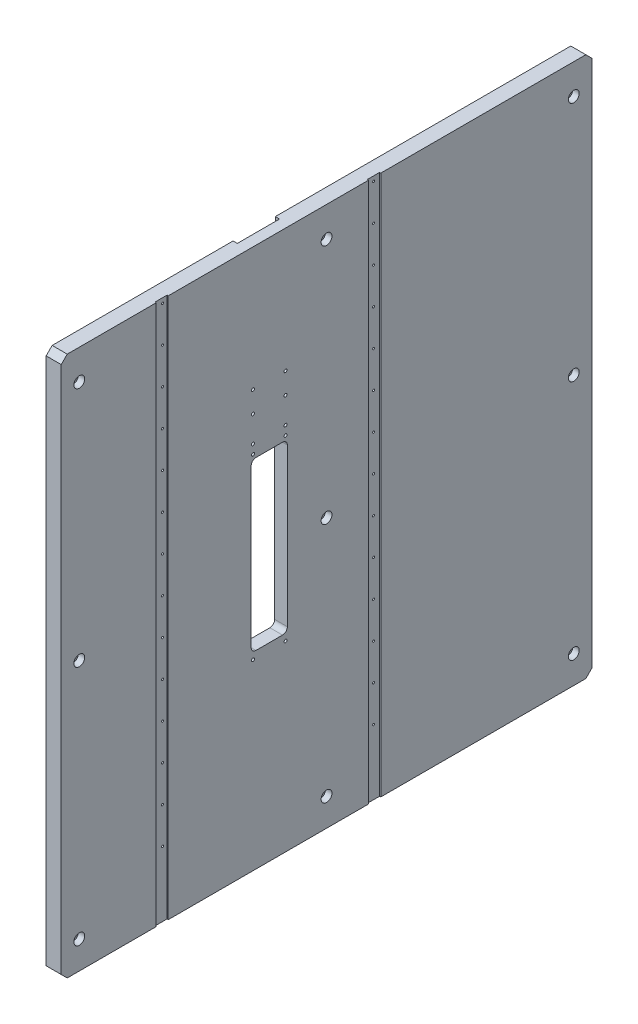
ISO-10303-21;
HEADER;
FILE_DESCRIPTION(('STEP AP214'),'2;1');
FILE_NAME('part.step','',(''),(''),'','','');
FILE_SCHEMA(('AUTOMOTIVE_DESIGN { 1 0 10303 214 1 1 1 1 }'));
ENDSEC;
DATA;
#1=APPLICATION_CONTEXT('core data for automotive mechanical design processes');
#2=APPLICATION_PROTOCOL_DEFINITION('international standard','automotive_design',2000,#1);
#3=PRODUCT_CONTEXT('',#1,'mechanical');
#4=PRODUCT('Part','Part','',(#3));
#5=PRODUCT_RELATED_PRODUCT_CATEGORY('part','',(#4));
#6=PRODUCT_DEFINITION_FORMATION('','',#4);
#7=PRODUCT_DEFINITION_CONTEXT('part definition',#1,'design');
#8=PRODUCT_DEFINITION('design','',#6,#7);
#9=PRODUCT_DEFINITION_SHAPE('','',#8);
#10=(LENGTH_UNIT() NAMED_UNIT(*) SI_UNIT(.MILLI.,.METRE.));
#11=(NAMED_UNIT(*) PLANE_ANGLE_UNIT() SI_UNIT($,.RADIAN.));
#12=(NAMED_UNIT(*) SI_UNIT($,.STERADIAN.) SOLID_ANGLE_UNIT());
#13=UNCERTAINTY_MEASURE_WITH_UNIT(LENGTH_MEASURE(1.E-05),#10,'distance_accuracy_value','');
#14=(GEOMETRIC_REPRESENTATION_CONTEXT(3) GLOBAL_UNCERTAINTY_ASSIGNED_CONTEXT((#13)) GLOBAL_UNIT_ASSIGNED_CONTEXT((#10,
#11,#12)) REPRESENTATION_CONTEXT('',''));
#15=CARTESIAN_POINT('',(0.,0.,0.));
#16=DIRECTION('',(0.,0.,1.));
#17=DIRECTION('',(1.,0.,0.));
#18=AXIS2_PLACEMENT_3D('',#15,#16,#17);
#19=CARTESIAN_POINT('',(-25.,523.5,53.));
#20=DIRECTION('',(-1.,0.,0.));
#21=DIRECTION('',(0.,0.,1.));
#22=AXIS2_PLACEMENT_3D('',#19,#20,#21);
#23=CYLINDRICAL_SURFACE('',#22,1.24999999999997);
#24=CARTESIAN_POINT('',(-17.5,523.5,53.));
#25=DIRECTION('',(-1.,0.,0.));
#26=DIRECTION('',(0.,0.,1.));
#27=AXIS2_PLACEMENT_3D('',#24,#25,#26);
#28=CIRCLE('',#27,1.24999999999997);
#29=CARTESIAN_POINT('',(-17.5,523.5,54.25));
#30=VERTEX_POINT('',#29);
#31=EDGE_CURVE('E946',#30,#30,#28,.T.);
#32=ORIENTED_EDGE('',*,*,#31,.F.);
#33=EDGE_LOOP('',(#32));
#34=FACE_BOUND('',#33,.T.);
#35=CARTESIAN_POINT('',(-25.,523.5,53.));
#36=DIRECTION('',(-1.,0.,0.));
#37=DIRECTION('',(0.,0.,1.));
#38=AXIS2_PLACEMENT_3D('',#35,#36,#37);
#39=CIRCLE('',#38,1.24999999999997);
#40=CARTESIAN_POINT('',(-25.,523.5,54.25));
#41=VERTEX_POINT('',#40);
#42=EDGE_CURVE('E943',#41,#41,#39,.T.);
#43=ORIENTED_EDGE('',*,*,#42,.T.);
#44=EDGE_LOOP('',(#43));
#45=FACE_BOUND('',#44,.T.);
#46=ADVANCED_FACE('F51',(#34,#45),#23,.F.);
#47=CARTESIAN_POINT('',(-17.5,523.5,53.));
#48=DIRECTION('',(-1.,0.,0.));
#49=DIRECTION('',(0.,0.,1.));
#50=AXIS2_PLACEMENT_3D('',#47,#48,#49);
#51=CONICAL_SURFACE('',#50,1.24999999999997,1.02974425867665);
#52=CARTESIAN_POINT('',(-16.7489242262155,523.5,53.));
#53=VERTEX_POINT('',#52);
#54=VERTEX_LOOP('',#53);
#55=FACE_BOUND('',#54,.T.);
#56=ORIENTED_EDGE('',*,*,#31,.T.);
#57=EDGE_LOOP('',(#56));
#58=FACE_BOUND('',#57,.T.);
#59=ADVANCED_FACE('F1060',(#55,#58),#51,.F.);
#60=CARTESIAN_POINT('',(-25.,371.5,53.));
#61=DIRECTION('',(-1.,0.,0.));
#62=DIRECTION('',(0.,0.,1.));
#63=AXIS2_PLACEMENT_3D('',#60,#61,#62);
#64=CYLINDRICAL_SURFACE('',#63,1.24999999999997);
#65=CARTESIAN_POINT('',(-17.5,371.5,53.));
#66=DIRECTION('',(-1.,0.,0.));
#67=DIRECTION('',(0.,0.,1.));
#68=AXIS2_PLACEMENT_3D('',#65,#66,#67);
#69=CIRCLE('',#68,1.24999999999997);
#70=CARTESIAN_POINT('',(-17.5,371.5,54.25));
#71=VERTEX_POINT('',#70);
#72=EDGE_CURVE('E940',#71,#71,#69,.T.);
#73=ORIENTED_EDGE('',*,*,#72,.F.);
#74=EDGE_LOOP('',(#73));
#75=FACE_BOUND('',#74,.T.);
#76=CARTESIAN_POINT('',(-25.,371.5,53.));
#77=DIRECTION('',(-1.,0.,0.));
#78=DIRECTION('',(0.,0.,1.));
#79=AXIS2_PLACEMENT_3D('',#76,#77,#78);
#80=CIRCLE('',#79,1.24999999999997);
#81=CARTESIAN_POINT('',(-25.,371.5,54.25));
#82=VERTEX_POINT('',#81);
#83=EDGE_CURVE('E937',#82,#82,#80,.T.);
#84=ORIENTED_EDGE('',*,*,#83,.T.);
#85=EDGE_LOOP('',(#84));
#86=FACE_BOUND('',#85,.T.);
#87=ADVANCED_FACE('F1066',(#75,#86),#64,.F.);
#88=CARTESIAN_POINT('',(-17.5,371.5,53.));
#89=DIRECTION('',(-1.,0.,0.));
#90=DIRECTION('',(0.,0.,1.));
#91=AXIS2_PLACEMENT_3D('',#88,#89,#90);
#92=CONICAL_SURFACE('',#91,1.24999999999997,1.02974425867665);
#93=CARTESIAN_POINT('',(-16.7489242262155,371.5,53.));
#94=VERTEX_POINT('',#93);
#95=VERTEX_LOOP('',#94);
#96=FACE_BOUND('',#95,.T.);
#97=ORIENTED_EDGE('',*,*,#72,.T.);
#98=EDGE_LOOP('',(#97));
#99=FACE_BOUND('',#98,.T.);
#100=ADVANCED_FACE('F1561',(#96,#99),#92,.F.);
#101=CARTESIAN_POINT('',(-25.,336.5,53.));
#102=DIRECTION('',(-1.,0.,0.));
#103=DIRECTION('',(0.,0.,1.));
#104=AXIS2_PLACEMENT_3D('',#101,#102,#103);
#105=CYLINDRICAL_SURFACE('',#104,1.24999999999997);
#106=CARTESIAN_POINT('',(-17.5,336.5,53.));
#107=DIRECTION('',(-1.,0.,0.));
#108=DIRECTION('',(0.,0.,1.));
#109=AXIS2_PLACEMENT_3D('',#106,#107,#108);
#110=CIRCLE('',#109,1.24999999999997);
#111=CARTESIAN_POINT('',(-17.5,336.5,54.25));
#112=VERTEX_POINT('',#111);
#113=EDGE_CURVE('E934',#112,#112,#110,.T.);
#114=ORIENTED_EDGE('',*,*,#113,.F.);
#115=EDGE_LOOP('',(#114));
#116=FACE_BOUND('',#115,.T.);
#117=CARTESIAN_POINT('',(-25.,336.5,53.));
#118=DIRECTION('',(-1.,0.,0.));
#119=DIRECTION('',(0.,0.,1.));
#120=AXIS2_PLACEMENT_3D('',#117,#118,#119);
#121=CIRCLE('',#120,1.24999999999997);
#122=CARTESIAN_POINT('',(-25.,336.5,54.25));
#123=VERTEX_POINT('',#122);
#124=EDGE_CURVE('E931',#123,#123,#121,.T.);
#125=ORIENTED_EDGE('',*,*,#124,.T.);
#126=EDGE_LOOP('',(#125));
#127=FACE_BOUND('',#126,.T.);
#128=ADVANCED_FACE('F1557',(#116,#127),#105,.F.);
#129=CARTESIAN_POINT('',(-17.5,336.5,53.));
#130=DIRECTION('',(-1.,0.,0.));
#131=DIRECTION('',(0.,0.,1.));
#132=AXIS2_PLACEMENT_3D('',#129,#130,#131);
#133=CONICAL_SURFACE('',#132,1.24999999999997,1.02974425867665);
#134=CARTESIAN_POINT('',(-16.7489242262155,336.5,53.));
#135=VERTEX_POINT('',#134);
#136=VERTEX_LOOP('',#135);
#137=FACE_BOUND('',#136,.T.);
#138=ORIENTED_EDGE('',*,*,#113,.T.);
#139=EDGE_LOOP('',(#138));
#140=FACE_BOUND('',#139,.T.);
#141=ADVANCED_FACE('F1553',(#137,#140),#133,.F.);
#142=CARTESIAN_POINT('',(-25.,558.5,53.));
#143=DIRECTION('',(-1.,0.,0.));
#144=DIRECTION('',(0.,0.,1.));
#145=AXIS2_PLACEMENT_3D('',#142,#143,#144);
#146=CYLINDRICAL_SURFACE('',#145,1.24999999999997);
#147=CARTESIAN_POINT('',(-17.5,558.5,53.));
#148=DIRECTION('',(-1.,0.,0.));
#149=DIRECTION('',(0.,0.,1.));
#150=AXIS2_PLACEMENT_3D('',#147,#148,#149);
#151=CIRCLE('',#150,1.24999999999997);
#152=CARTESIAN_POINT('',(-17.5,558.5,54.25));
#153=VERTEX_POINT('',#152);
#154=EDGE_CURVE('E928',#153,#153,#151,.T.);
#155=ORIENTED_EDGE('',*,*,#154,.F.);
#156=EDGE_LOOP('',(#155));
#157=FACE_BOUND('',#156,.T.);
#158=CARTESIAN_POINT('',(-25.,558.5,53.));
#159=DIRECTION('',(-1.,0.,0.));
#160=DIRECTION('',(0.,0.,1.));
#161=AXIS2_PLACEMENT_3D('',#158,#159,#160);
#162=CIRCLE('',#161,1.24999999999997);
#163=CARTESIAN_POINT('',(-25.,558.5,54.25));
#164=VERTEX_POINT('',#163);
#165=EDGE_CURVE('E925',#164,#164,#162,.T.);
#166=ORIENTED_EDGE('',*,*,#165,.T.);
#167=EDGE_LOOP('',(#166));
#168=FACE_BOUND('',#167,.T.);
#169=ADVANCED_FACE('F1549',(#157,#168),#146,.F.);
#170=CARTESIAN_POINT('',(-17.5,558.5,53.));
#171=DIRECTION('',(-1.,0.,0.));
#172=DIRECTION('',(0.,0.,1.));
#173=AXIS2_PLACEMENT_3D('',#170,#171,#172);
#174=CONICAL_SURFACE('',#173,1.24999999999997,1.02974425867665);
#175=CARTESIAN_POINT('',(-16.7489242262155,558.5,53.));
#176=VERTEX_POINT('',#175);
#177=VERTEX_LOOP('',#176);
#178=FACE_BOUND('',#177,.T.);
#179=ORIENTED_EDGE('',*,*,#154,.T.);
#180=EDGE_LOOP('',(#179));
#181=FACE_BOUND('',#180,.T.);
#182=ADVANCED_FACE('F1225',(#178,#181),#174,.F.);
#183=CARTESIAN_POINT('',(-21.,287.,70.));
#184=DIRECTION('',(1.,0.,0.));
#185=DIRECTION('',(0.,0.,-1.));
#186=AXIS2_PLACEMENT_3D('',#183,#184,#185);
#187=PLANE('',#186);
#188=CARTESIAN_POINT('',(-21.,691.,68.));
#189=DIRECTION('',(-1.,0.,0.));
#190=DIRECTION('',(0.,0.,1.));
#191=AXIS2_PLACEMENT_3D('',#188,#189,#190);
#192=CIRCLE('',#191,2.49999999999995);
#193=CARTESIAN_POINT('',(-21.,691.,70.4999999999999));
#194=VERTEX_POINT('',#193);
#195=EDGE_CURVE('E405',#194,#194,#192,.T.);
#196=ORIENTED_EDGE('',*,*,#195,.F.);
#197=EDGE_LOOP('',(#196));
#198=FACE_BOUND('',#197,.T.);
#199=CARTESIAN_POINT('',(-21.,656.,67.9999999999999));
#200=DIRECTION('',(-1.,0.,0.));
#201=DIRECTION('',(0.,0.,1.));
#202=AXIS2_PLACEMENT_3D('',#199,#200,#201);
#203=CIRCLE('',#202,2.49999999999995);
#204=CARTESIAN_POINT('',(-21.,656.,70.4999999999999));
#205=VERTEX_POINT('',#204);
#206=EDGE_CURVE('E411',#205,#205,#203,.T.);
#207=ORIENTED_EDGE('',*,*,#206,.F.);
#208=EDGE_LOOP('',(#207));
#209=FACE_BOUND('',#208,.T.);
#210=CARTESIAN_POINT('',(-21.,613.,67.9999999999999));
#211=DIRECTION('',(-1.,0.,0.));
#212=DIRECTION('',(0.,0.,1.));
#213=AXIS2_PLACEMENT_3D('',#210,#211,#212);
#214=CIRCLE('',#213,2.49999999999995);
#215=CARTESIAN_POINT('',(-21.,613.,70.4999999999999));
#216=VERTEX_POINT('',#215);
#217=EDGE_CURVE('E417',#216,#216,#214,.T.);
#218=ORIENTED_EDGE('',*,*,#217,.F.);
#219=EDGE_LOOP('',(#218));
#220=FACE_BOUND('',#219,.T.);
#221=CARTESIAN_POINT('',(-21.,598.,67.9999999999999));
#222=DIRECTION('',(-1.,0.,0.));
#223=DIRECTION('',(0.,0.,1.));
#224=AXIS2_PLACEMENT_3D('',#221,#222,#223);
#225=CIRCLE('',#224,2.49999999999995);
#226=CARTESIAN_POINT('',(-21.,598.,70.4999999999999));
#227=VERTEX_POINT('',#226);
#228=EDGE_CURVE('E423',#227,#227,#225,.T.);
#229=ORIENTED_EDGE('',*,*,#228,.F.);
#230=EDGE_LOOP('',(#229));
#231=FACE_BOUND('',#230,.T.);
#232=CARTESIAN_POINT('',(-21.,303.,67.9999999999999));
#233=DIRECTION('',(-1.,0.,0.));
#234=DIRECTION('',(0.,0.,1.));
#235=AXIS2_PLACEMENT_3D('',#232,#233,#234);
#236=CIRCLE('',#235,2.5);
#237=CARTESIAN_POINT('',(-21.,303.,70.5));
#238=VERTEX_POINT('',#237);
#239=EDGE_CURVE('E429',#238,#238,#236,.T.);
#240=ORIENTED_EDGE('',*,*,#239,.F.);
#241=EDGE_LOOP('',(#240));
#242=FACE_BOUND('',#241,.T.);
#243=CARTESIAN_POINT('',(-21.,303.,122.));
#244=DIRECTION('',(-1.,0.,0.));
#245=DIRECTION('',(0.,0.,1.));
#246=AXIS2_PLACEMENT_3D('',#243,#244,#245);
#247=CIRCLE('',#246,2.5);
#248=CARTESIAN_POINT('',(-21.,303.,124.5));
#249=VERTEX_POINT('',#248);
#250=EDGE_CURVE('E435',#249,#249,#247,.T.);
#251=ORIENTED_EDGE('',*,*,#250,.F.);
#252=EDGE_LOOP('',(#251));
#253=FACE_BOUND('',#252,.T.);
#254=CARTESIAN_POINT('',(-21.,598.,122.));
#255=DIRECTION('',(-1.,0.,0.));
#256=DIRECTION('',(0.,0.,1.));
#257=AXIS2_PLACEMENT_3D('',#254,#255,#256);
#258=CIRCLE('',#257,2.49999999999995);
#259=CARTESIAN_POINT('',(-21.,598.,124.5));
#260=VERTEX_POINT('',#259);
#261=EDGE_CURVE('E441',#260,#260,#258,.T.);
#262=ORIENTED_EDGE('',*,*,#261,.F.);
#263=EDGE_LOOP('',(#262));
#264=FACE_BOUND('',#263,.T.);
#265=CARTESIAN_POINT('',(-21.,613.,122.));
#266=DIRECTION('',(-1.,0.,0.));
#267=DIRECTION('',(0.,0.,1.));
#268=AXIS2_PLACEMENT_3D('',#265,#266,#267);
#269=CIRCLE('',#268,2.49999999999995);
#270=CARTESIAN_POINT('',(-21.,613.,124.5));
#271=VERTEX_POINT('',#270);
#272=EDGE_CURVE('E447',#271,#271,#269,.T.);
#273=ORIENTED_EDGE('',*,*,#272,.F.);
#274=EDGE_LOOP('',(#273));
#275=FACE_BOUND('',#274,.T.);
#276=CARTESIAN_POINT('',(-21.,656.,122.));
#277=DIRECTION('',(-1.,0.,0.));
#278=DIRECTION('',(0.,0.,1.));
#279=AXIS2_PLACEMENT_3D('',#276,#277,#278);
#280=CIRCLE('',#279,2.49999999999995);
#281=CARTESIAN_POINT('',(-21.,656.,124.5));
#282=VERTEX_POINT('',#281);
#283=EDGE_CURVE('E453',#282,#282,#280,.T.);
#284=ORIENTED_EDGE('',*,*,#283,.F.);
#285=EDGE_LOOP('',(#284));
#286=FACE_BOUND('',#285,.T.);
#287=DIRECTION('',(0.,1.,0.));
#288=VECTOR('',#287,1.);
#289=CARTESIAN_POINT('',(-21.,896.,130.));
#290=LINE('',#289,#288);
#291=CARTESIAN_POINT('',(-21.,287.,130.));
#292=VERTEX_POINT('',#291);
#293=CARTESIAN_POINT('',(-21.,721.,130.));
#294=VERTEX_POINT('',#293);
#295=EDGE_CURVE('E477',#292,#294,#290,.T.);
#296=ORIENTED_EDGE('',*,*,#295,.T.);
#297=CARTESIAN_POINT('',(-21.,721.,120.));
#298=DIRECTION('',(-1.,0.,0.));
#299=DIRECTION('',(0.,0.,-1.));
#300=AXIS2_PLACEMENT_3D('',#297,#298,#299);
#301=CIRCLE('',#300,9.99999999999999);
#302=CARTESIAN_POINT('',(-21.,711.,120.));
#303=VERTEX_POINT('',#302);
#304=EDGE_CURVE('E335',#303,#294,#301,.T.);
#305=ORIENTED_EDGE('',*,*,#304,.F.);
#306=DIRECTION('',(0.,0.,1.));
#307=VECTOR('',#306,1.);
#308=CARTESIAN_POINT('',(-21.,711.,70.));
#309=LINE('',#308,#307);
#310=CARTESIAN_POINT('',(-21.,711.,70.));
#311=VERTEX_POINT('',#310);
#312=EDGE_CURVE('E337',#311,#303,#309,.T.);
#313=ORIENTED_EDGE('',*,*,#312,.F.);
#314=CARTESIAN_POINT('',(-21.,721.,70.));
#315=DIRECTION('',(-1.,0.,0.));
#316=DIRECTION('',(0.,0.,1.));
#317=AXIS2_PLACEMENT_3D('',#314,#315,#316);
#318=CIRCLE('',#317,10.);
#319=CARTESIAN_POINT('',(-21.,721.,60.));
#320=VERTEX_POINT('',#319);
#321=EDGE_CURVE('E347',#320,#311,#318,.T.);
#322=ORIENTED_EDGE('',*,*,#321,.F.);
#323=DIRECTION('',(0.,-1.,0.));
#324=VECTOR('',#323,1.);
#325=CARTESIAN_POINT('',(-21.,896.,60.));
#326=LINE('',#325,#324);
#327=CARTESIAN_POINT('',(-21.,287.,60.));
#328=VERTEX_POINT('',#327);
#329=EDGE_CURVE('E317',#320,#328,#326,.T.);
#330=ORIENTED_EDGE('',*,*,#329,.T.);
#331=CARTESIAN_POINT('',(-21.,287.,70.));
#332=DIRECTION('',(-1.,0.,0.));
#333=DIRECTION('',(0.,0.,-1.));
#334=AXIS2_PLACEMENT_3D('',#331,#332,#333);
#335=CIRCLE('',#334,9.99999999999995);
#336=CARTESIAN_POINT('',(-21.,277.,70.));
#337=VERTEX_POINT('',#336);
#338=EDGE_CURVE('E467',#328,#337,#335,.T.);
#339=ORIENTED_EDGE('',*,*,#338,.T.);
#340=DIRECTION('',(0.,0.,1.));
#341=VECTOR('',#340,1.);
#342=CARTESIAN_POINT('',(-21.,277.,70.));
#343=LINE('',#342,#341);
#344=CARTESIAN_POINT('',(-21.,277.,120.));
#345=VERTEX_POINT('',#344);
#346=EDGE_CURVE('E471',#337,#345,#343,.T.);
#347=ORIENTED_EDGE('',*,*,#346,.T.);
#348=CARTESIAN_POINT('',(-21.,287.,120.));
#349=DIRECTION('',(-1.,0.,0.));
#350=DIRECTION('',(0.,0.,-1.));
#351=AXIS2_PLACEMENT_3D('',#348,#349,#350);
#352=CIRCLE('',#351,9.99999999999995);
#353=EDGE_CURVE('E474',#345,#292,#352,.T.);
#354=ORIENTED_EDGE('',*,*,#353,.T.);
#355=EDGE_LOOP('',(#296,#305,#313,#322,#330,#339,#347,#354));
#356=FACE_BOUND('',#355,.T.);
#357=DIRECTION('',(0.,0.,1.));
#358=VECTOR('',#357,1.);
#359=CARTESIAN_POINT('',(-21.,314.,72.9999999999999));
#360=LINE('',#359,#358);
#361=CARTESIAN_POINT('',(-21.,314.,72.9999999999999));
#362=VERTEX_POINT('',#361);
#363=CARTESIAN_POINT('',(-21.,314.,117.));
#364=VERTEX_POINT('',#363);
#365=EDGE_CURVE('E910',#362,#364,#360,.T.);
#366=ORIENTED_EDGE('',*,*,#365,.F.);
#367=CARTESIAN_POINT('',(-21.,322.,72.9999999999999));
#368=DIRECTION('',(1.,0.,0.));
#369=DIRECTION('',(0.,0.,-1.));
#370=AXIS2_PLACEMENT_3D('',#367,#368,#369);
#371=CIRCLE('',#370,8.00000000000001);
#372=CARTESIAN_POINT('',(-21.,322.,64.9999999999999));
#373=VERTEX_POINT('',#372);
#374=EDGE_CURVE('E494',#373,#362,#371,.F.);
#375=ORIENTED_EDGE('',*,*,#374,.F.);
#376=DIRECTION('',(0.,-1.,0.));
#377=VECTOR('',#376,1.);
#378=CARTESIAN_POINT('',(-21.,583.,64.9999999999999));
#379=LINE('',#378,#377);
#380=CARTESIAN_POINT('',(-21.,583.,64.9999999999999));
#381=VERTEX_POINT('',#380);
#382=EDGE_CURVE('E508',#381,#373,#379,.T.);
#383=ORIENTED_EDGE('',*,*,#382,.F.);
#384=CARTESIAN_POINT('',(-21.,583.,73.));
#385=DIRECTION('',(1.,0.,0.));
#386=DIRECTION('',(0.,0.,-1.));
#387=AXIS2_PLACEMENT_3D('',#384,#385,#386);
#388=CIRCLE('',#387,8.00000000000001);
#389=CARTESIAN_POINT('',(-21.,591.,73.));
#390=VERTEX_POINT('',#389);
#391=EDGE_CURVE('E511',#390,#381,#388,.F.);
#392=ORIENTED_EDGE('',*,*,#391,.F.);
#393=DIRECTION('',(0.,0.,-1.));
#394=VECTOR('',#393,1.);
#395=CARTESIAN_POINT('',(-21.,591.,117.));
#396=LINE('',#395,#394);
#397=CARTESIAN_POINT('',(-21.,591.,117.));
#398=VERTEX_POINT('',#397);
#399=EDGE_CURVE('E514',#398,#390,#396,.T.);
#400=ORIENTED_EDGE('',*,*,#399,.F.);
#401=CARTESIAN_POINT('',(-21.,583.,117.));
#402=DIRECTION('',(1.,0.,0.));
#403=DIRECTION('',(0.,0.,-1.));
#404=AXIS2_PLACEMENT_3D('',#401,#402,#403);
#405=CIRCLE('',#404,8.);
#406=CARTESIAN_POINT('',(-21.,583.,125.));
#407=VERTEX_POINT('',#406);
#408=EDGE_CURVE('E517',#407,#398,#405,.F.);
#409=ORIENTED_EDGE('',*,*,#408,.F.);
#410=DIRECTION('',(0.,1.,0.));
#411=VECTOR('',#410,1.);
#412=CARTESIAN_POINT('',(-21.,583.,125.));
#413=LINE('',#412,#411);
#414=CARTESIAN_POINT('',(-21.,322.,125.));
#415=VERTEX_POINT('',#414);
#416=EDGE_CURVE('E520',#415,#407,#413,.T.);
#417=ORIENTED_EDGE('',*,*,#416,.F.);
#418=CARTESIAN_POINT('',(-21.,322.,117.));
#419=DIRECTION('',(1.,0.,0.));
#420=DIRECTION('',(0.,0.,-1.));
#421=AXIS2_PLACEMENT_3D('',#418,#419,#420);
#422=CIRCLE('',#421,8.00000000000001);
#423=EDGE_CURVE('E523',#364,#415,#422,.F.);
#424=ORIENTED_EDGE('',*,*,#423,.F.);
#425=EDGE_LOOP('',(#366,#375,#383,#392,#400,#409,#417,#424));
#426=FACE_BOUND('',#425,.T.);
#427=CARTESIAN_POINT('',(-21.,691.,122.));
#428=DIRECTION('',(-1.,0.,0.));
#429=DIRECTION('',(0.,0.,1.));
#430=AXIS2_PLACEMENT_3D('',#427,#428,#429);
#431=CIRCLE('',#430,2.49999999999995);
#432=CARTESIAN_POINT('',(-21.,691.,124.5));
#433=VERTEX_POINT('',#432);
#434=EDGE_CURVE('E459',#433,#433,#431,.T.);
#435=ORIENTED_EDGE('',*,*,#434,.F.);
#436=EDGE_LOOP('',(#435));
#437=FACE_BOUND('',#436,.T.);
#438=ADVANCED_FACE('F1093',(#198,#209,#220,#231,#242,#253,#264,#275,#286,#356,#426,#437),#187,.F.);
#439=CARTESIAN_POINT('',(-2.,0.,0.));
#440=DIRECTION('',(-1.,0.,0.));
#441=DIRECTION('',(0.,0.,1.));
#442=AXIS2_PLACEMENT_3D('',#439,#440,#441);
#443=PLANE('',#442);
#444=CARTESIAN_POINT('',(-2.,108.,270.));
#445=DIRECTION('',(1.,0.,0.));
#446=DIRECTION('',(0.,0.,-1.));
#447=AXIS2_PLACEMENT_3D('',#444,#445,#446);
#448=CIRCLE('',#447,1.64999999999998);
#449=CARTESIAN_POINT('',(-2.,108.,268.35));
#450=VERTEX_POINT('',#449);
#451=EDGE_CURVE('E640',#450,#450,#448,.T.);
#452=ORIENTED_EDGE('',*,*,#451,.F.);
#453=EDGE_LOOP('',(#452));
#454=FACE_BOUND('',#453,.T.);
#455=CARTESIAN_POINT('',(-2.,228.,270.));
#456=DIRECTION('',(1.,0.,0.));
#457=DIRECTION('',(0.,0.,-1.));
#458=AXIS2_PLACEMENT_3D('',#455,#456,#457);
#459=CIRCLE('',#458,1.64999999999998);
#460=CARTESIAN_POINT('',(-2.,228.,268.35));
#461=VERTEX_POINT('',#460);
#462=EDGE_CURVE('E664',#461,#461,#459,.T.);
#463=ORIENTED_EDGE('',*,*,#462,.F.);
#464=EDGE_LOOP('',(#463));
#465=FACE_BOUND('',#464,.T.);
#466=CARTESIAN_POINT('',(-2.,288.,270.));
#467=DIRECTION('',(1.,0.,0.));
#468=DIRECTION('',(0.,0.,-1.));
#469=AXIS2_PLACEMENT_3D('',#466,#467,#468);
#470=CIRCLE('',#469,1.64999999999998);
#471=CARTESIAN_POINT('',(-2.,288.,268.35));
#472=VERTEX_POINT('',#471);
#473=EDGE_CURVE('E676',#472,#472,#470,.T.);
#474=ORIENTED_EDGE('',*,*,#473,.F.);
#475=EDGE_LOOP('',(#474));
#476=FACE_BOUND('',#475,.T.);
#477=CARTESIAN_POINT('',(-2.,348.,270.));
#478=DIRECTION('',(1.,0.,0.));
#479=DIRECTION('',(0.,0.,-1.));
#480=AXIS2_PLACEMENT_3D('',#477,#478,#479);
#481=CIRCLE('',#480,1.64999999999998);
#482=CARTESIAN_POINT('',(-2.,348.,268.35));
#483=VERTEX_POINT('',#482);
#484=EDGE_CURVE('E688',#483,#483,#481,.T.);
#485=ORIENTED_EDGE('',*,*,#484,.F.);
#486=EDGE_LOOP('',(#485));
#487=FACE_BOUND('',#486,.T.);
#488=CARTESIAN_POINT('',(-2.,408.,270.));
#489=DIRECTION('',(1.,0.,0.));
#490=DIRECTION('',(0.,0.,-1.));
#491=AXIS2_PLACEMENT_3D('',#488,#489,#490);
#492=CIRCLE('',#491,1.64999999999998);
#493=CARTESIAN_POINT('',(-2.,408.,268.35));
#494=VERTEX_POINT('',#493);
#495=EDGE_CURVE('E700',#494,#494,#492,.T.);
#496=ORIENTED_EDGE('',*,*,#495,.F.);
#497=EDGE_LOOP('',(#496));
#498=FACE_BOUND('',#497,.T.);
#499=CARTESIAN_POINT('',(-2.,528.,270.));
#500=DIRECTION('',(1.,0.,0.));
#501=DIRECTION('',(0.,0.,-1.));
#502=AXIS2_PLACEMENT_3D('',#499,#500,#501);
#503=CIRCLE('',#502,1.65000000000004);
#504=CARTESIAN_POINT('',(-2.,528.,268.35));
#505=VERTEX_POINT('',#504);
#506=EDGE_CURVE('E724',#505,#505,#503,.T.);
#507=ORIENTED_EDGE('',*,*,#506,.F.);
#508=EDGE_LOOP('',(#507));
#509=FACE_BOUND('',#508,.T.);
#510=CARTESIAN_POINT('',(-2.,588.,270.));
#511=DIRECTION('',(1.,0.,0.));
#512=DIRECTION('',(0.,0.,-1.));
#513=AXIS2_PLACEMENT_3D('',#510,#511,#512);
#514=CIRCLE('',#513,1.65000000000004);
#515=CARTESIAN_POINT('',(-2.,588.,268.35));
#516=VERTEX_POINT('',#515);
#517=EDGE_CURVE('E736',#516,#516,#514,.T.);
#518=ORIENTED_EDGE('',*,*,#517,.F.);
#519=EDGE_LOOP('',(#518));
#520=FACE_BOUND('',#519,.T.);
#521=CARTESIAN_POINT('',(-2.,648.,270.));
#522=DIRECTION('',(1.,0.,0.));
#523=DIRECTION('',(0.,0.,-1.));
#524=AXIS2_PLACEMENT_3D('',#521,#522,#523);
#525=CIRCLE('',#524,1.65000000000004);
#526=CARTESIAN_POINT('',(-2.,648.,268.35));
#527=VERTEX_POINT('',#526);
#528=EDGE_CURVE('E748',#527,#527,#525,.T.);
#529=ORIENTED_EDGE('',*,*,#528,.F.);
#530=EDGE_LOOP('',(#529));
#531=FACE_BOUND('',#530,.T.);
#532=CARTESIAN_POINT('',(-2.,708.,270.));
#533=DIRECTION('',(1.,0.,0.));
#534=DIRECTION('',(0.,0.,-1.));
#535=AXIS2_PLACEMENT_3D('',#532,#533,#534);
#536=CIRCLE('',#535,1.65000000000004);
#537=CARTESIAN_POINT('',(-2.,708.,268.35));
#538=VERTEX_POINT('',#537);
#539=EDGE_CURVE('E760',#538,#538,#536,.T.);
#540=ORIENTED_EDGE('',*,*,#539,.F.);
#541=EDGE_LOOP('',(#540));
#542=FACE_BOUND('',#541,.T.);
#543=CARTESIAN_POINT('',(-2.,768.,270.));
#544=DIRECTION('',(1.,0.,0.));
#545=DIRECTION('',(0.,0.,-1.));
#546=AXIS2_PLACEMENT_3D('',#543,#544,#545);
#547=CIRCLE('',#546,1.65000000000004);
#548=CARTESIAN_POINT('',(-2.,768.,268.35));
#549=VERTEX_POINT('',#548);
#550=EDGE_CURVE('E772',#549,#549,#547,.T.);
#551=ORIENTED_EDGE('',*,*,#550,.F.);
#552=EDGE_LOOP('',(#551));
#553=FACE_BOUND('',#552,.T.);
#554=CARTESIAN_POINT('',(-2.,828.,270.));
#555=DIRECTION('',(1.,0.,0.));
#556=DIRECTION('',(0.,0.,-1.));
#557=AXIS2_PLACEMENT_3D('',#554,#555,#556);
#558=CIRCLE('',#557,1.65000000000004);
#559=CARTESIAN_POINT('',(-2.,828.,268.35));
#560=VERTEX_POINT('',#559);
#561=EDGE_CURVE('E784',#560,#560,#558,.T.);
#562=ORIENTED_EDGE('',*,*,#561,.F.);
#563=EDGE_LOOP('',(#562));
#564=FACE_BOUND('',#563,.T.);
#565=CARTESIAN_POINT('',(-2.,888.,270.));
#566=DIRECTION('',(1.,0.,0.));
#567=DIRECTION('',(0.,0.,-1.));
#568=AXIS2_PLACEMENT_3D('',#565,#566,#567);
#569=CIRCLE('',#568,1.65000000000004);
#570=CARTESIAN_POINT('',(-2.,888.,268.35));
#571=VERTEX_POINT('',#570);
#572=EDGE_CURVE('E796',#571,#571,#569,.T.);
#573=ORIENTED_EDGE('',*,*,#572,.F.);
#574=EDGE_LOOP('',(#573));
#575=FACE_BOUND('',#574,.T.);
#576=DIRECTION('',(0.,-1.,0.));
#577=VECTOR('',#576,1.);
#578=CARTESIAN_POINT('',(-2.,896.,262.5));
#579=LINE('',#578,#577);
#580=CARTESIAN_POINT('',(-2.,896.,262.5));
#581=VERTEX_POINT('',#580);
#582=CARTESIAN_POINT('',(-2.,0.,262.5));
#583=VERTEX_POINT('',#582);
#584=EDGE_CURVE('E832',#581,#583,#579,.T.);
#585=ORIENTED_EDGE('',*,*,#584,.F.);
#586=DIRECTION('',(0.,0.,-1.));
#587=VECTOR('',#586,1.);
#588=CARTESIAN_POINT('',(-2.,896.,262.5));
#589=LINE('',#588,#587);
#590=CARTESIAN_POINT('',(-2.,896.,282.5));
#591=VERTEX_POINT('',#590);
#592=EDGE_CURVE('E841',#591,#581,#589,.T.);
#593=ORIENTED_EDGE('',*,*,#592,.F.);
#594=DIRECTION('',(0.,1.,0.));
#595=VECTOR('',#594,1.);
#596=CARTESIAN_POINT('',(-2.,896.,282.5));
#597=LINE('',#596,#595);
#598=CARTESIAN_POINT('',(-2.,0.,282.5));
#599=VERTEX_POINT('',#598);
#600=EDGE_CURVE('E839',#599,#591,#597,.T.);
#601=ORIENTED_EDGE('',*,*,#600,.F.);
#602=DIRECTION('',(0.,0.,1.));
#603=VECTOR('',#602,1.);
#604=CARTESIAN_POINT('',(-2.,0.,262.5));
#605=LINE('',#604,#603);
#606=EDGE_CURVE('E835',#583,#599,#605,.T.);
#607=ORIENTED_EDGE('',*,*,#606,.F.);
#608=EDGE_LOOP('',(#585,#593,#601,#607));
#609=FACE_BOUND('',#608,.T.);
#610=CARTESIAN_POINT('',(-2.,468.,270.));
#611=DIRECTION('',(1.,0.,0.));
#612=DIRECTION('',(0.,0.,-1.));
#613=AXIS2_PLACEMENT_3D('',#610,#611,#612);
#614=CIRCLE('',#613,1.64999999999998);
#615=CARTESIAN_POINT('',(-2.,468.,268.35));
#616=VERTEX_POINT('',#615);
#617=EDGE_CURVE('E712',#616,#616,#614,.T.);
#618=ORIENTED_EDGE('',*,*,#617,.F.);
#619=EDGE_LOOP('',(#618));
#620=FACE_BOUND('',#619,.T.);
#621=CARTESIAN_POINT('',(-2.,168.,270.));
#622=DIRECTION('',(1.,0.,0.));
#623=DIRECTION('',(0.,0.,-1.));
#624=AXIS2_PLACEMENT_3D('',#621,#622,#623);
#625=CIRCLE('',#624,1.64999999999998);
#626=CARTESIAN_POINT('',(-2.,168.,268.35));
#627=VERTEX_POINT('',#626);
#628=EDGE_CURVE('E652',#627,#627,#625,.T.);
#629=ORIENTED_EDGE('',*,*,#628,.F.);
#630=EDGE_LOOP('',(#629));
#631=FACE_BOUND('',#630,.T.);
#632=ADVANCED_FACE('F1033',(#454,#465,#476,#487,#498,#509,#520,#531,#542,#553,#564,#575,#609,
#620,#631),#443,.F.);
#633=CARTESIAN_POINT('',(-2.,0.,0.));
#634=DIRECTION('',(-1.,0.,0.));
#635=DIRECTION('',(0.,0.,1.));
#636=AXIS2_PLACEMENT_3D('',#633,#634,#635);
#637=PLANE('',#636);
#638=CARTESIAN_POINT('',(-2.,108.,-80.0000000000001));
#639=DIRECTION('',(1.,0.,0.));
#640=DIRECTION('',(0.,0.,-1.));
#641=AXIS2_PLACEMENT_3D('',#638,#639,#640);
#642=CIRCLE('',#641,1.64999999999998);
#643=CARTESIAN_POINT('',(-2.,108.,-81.65));
#644=VERTEX_POINT('',#643);
#645=EDGE_CURVE('E634',#644,#644,#642,.T.);
#646=ORIENTED_EDGE('',*,*,#645,.F.);
#647=EDGE_LOOP('',(#646));
#648=FACE_BOUND('',#647,.T.);
#649=CARTESIAN_POINT('',(-2.,168.,-80.));
#650=DIRECTION('',(1.,0.,0.));
#651=DIRECTION('',(0.,0.,-1.));
#652=AXIS2_PLACEMENT_3D('',#649,#650,#651);
#653=CIRCLE('',#652,1.64999999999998);
#654=CARTESIAN_POINT('',(-2.,168.,-81.65));
#655=VERTEX_POINT('',#654);
#656=EDGE_CURVE('E646',#655,#655,#653,.T.);
#657=ORIENTED_EDGE('',*,*,#656,.F.);
#658=EDGE_LOOP('',(#657));
#659=FACE_BOUND('',#658,.T.);
#660=CARTESIAN_POINT('',(-2.,228.,-80.));
#661=DIRECTION('',(1.,0.,0.));
#662=DIRECTION('',(0.,0.,-1.));
#663=AXIS2_PLACEMENT_3D('',#660,#661,#662);
#664=CIRCLE('',#663,1.64999999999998);
#665=CARTESIAN_POINT('',(-2.,228.,-81.65));
#666=VERTEX_POINT('',#665);
#667=EDGE_CURVE('E658',#666,#666,#664,.T.);
#668=ORIENTED_EDGE('',*,*,#667,.F.);
#669=EDGE_LOOP('',(#668));
#670=FACE_BOUND('',#669,.T.);
#671=CARTESIAN_POINT('',(-2.,288.,-80.));
#672=DIRECTION('',(1.,0.,0.));
#673=DIRECTION('',(0.,0.,-1.));
#674=AXIS2_PLACEMENT_3D('',#671,#672,#673);
#675=CIRCLE('',#674,1.64999999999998);
#676=CARTESIAN_POINT('',(-2.,288.,-81.65));
#677=VERTEX_POINT('',#676);
#678=EDGE_CURVE('E670',#677,#677,#675,.T.);
#679=ORIENTED_EDGE('',*,*,#678,.F.);
#680=EDGE_LOOP('',(#679));
#681=FACE_BOUND('',#680,.T.);
#682=CARTESIAN_POINT('',(-2.,348.,-80.));
#683=DIRECTION('',(1.,0.,0.));
#684=DIRECTION('',(0.,0.,-1.));
#685=AXIS2_PLACEMENT_3D('',#682,#683,#684);
#686=CIRCLE('',#685,1.64999999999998);
#687=CARTESIAN_POINT('',(-2.,348.,-81.65));
#688=VERTEX_POINT('',#687);
#689=EDGE_CURVE('E682',#688,#688,#686,.T.);
#690=ORIENTED_EDGE('',*,*,#689,.F.);
#691=EDGE_LOOP('',(#690));
#692=FACE_BOUND('',#691,.T.);
#693=CARTESIAN_POINT('',(-2.,408.,-80.));
#694=DIRECTION('',(1.,0.,0.));
#695=DIRECTION('',(0.,0.,-1.));
#696=AXIS2_PLACEMENT_3D('',#693,#694,#695);
#697=CIRCLE('',#696,1.64999999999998);
#698=CARTESIAN_POINT('',(-2.,408.,-81.65));
#699=VERTEX_POINT('',#698);
#700=EDGE_CURVE('E694',#699,#699,#697,.T.);
#701=ORIENTED_EDGE('',*,*,#700,.F.);
#702=EDGE_LOOP('',(#701));
#703=FACE_BOUND('',#702,.T.);
#704=CARTESIAN_POINT('',(-2.,528.,-80.));
#705=DIRECTION('',(1.,0.,0.));
#706=DIRECTION('',(0.,0.,-1.));
#707=AXIS2_PLACEMENT_3D('',#704,#705,#706);
#708=CIRCLE('',#707,1.65000000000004);
#709=CARTESIAN_POINT('',(-2.,528.,-81.65));
#710=VERTEX_POINT('',#709);
#711=EDGE_CURVE('E718',#710,#710,#708,.T.);
#712=ORIENTED_EDGE('',*,*,#711,.F.);
#713=EDGE_LOOP('',(#712));
#714=FACE_BOUND('',#713,.T.);
#715=CARTESIAN_POINT('',(-2.,648.,-80.));
#716=DIRECTION('',(1.,0.,0.));
#717=DIRECTION('',(0.,0.,-1.));
#718=AXIS2_PLACEMENT_3D('',#715,#716,#717);
#719=CIRCLE('',#718,1.65000000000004);
#720=CARTESIAN_POINT('',(-2.,648.,-81.65));
#721=VERTEX_POINT('',#720);
#722=EDGE_CURVE('E742',#721,#721,#719,.T.);
#723=ORIENTED_EDGE('',*,*,#722,.F.);
#724=EDGE_LOOP('',(#723));
#725=FACE_BOUND('',#724,.T.);
#726=CARTESIAN_POINT('',(-2.,708.,-80.));
#727=DIRECTION('',(1.,0.,0.));
#728=DIRECTION('',(0.,0.,-1.));
#729=AXIS2_PLACEMENT_3D('',#726,#727,#728);
#730=CIRCLE('',#729,1.65000000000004);
#731=CARTESIAN_POINT('',(-2.,708.,-81.65));
#732=VERTEX_POINT('',#731);
#733=EDGE_CURVE('E754',#732,#732,#730,.T.);
#734=ORIENTED_EDGE('',*,*,#733,.F.);
#735=EDGE_LOOP('',(#734));
#736=FACE_BOUND('',#735,.T.);
#737=CARTESIAN_POINT('',(-2.,768.,-80.));
#738=DIRECTION('',(1.,0.,0.));
#739=DIRECTION('',(0.,0.,-1.));
#740=AXIS2_PLACEMENT_3D('',#737,#738,#739);
#741=CIRCLE('',#740,1.65000000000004);
#742=CARTESIAN_POINT('',(-2.,768.,-81.65));
#743=VERTEX_POINT('',#742);
#744=EDGE_CURVE('E766',#743,#743,#741,.T.);
#745=ORIENTED_EDGE('',*,*,#744,.F.);
#746=EDGE_LOOP('',(#745));
#747=FACE_BOUND('',#746,.T.);
#748=CARTESIAN_POINT('',(-2.,888.,-80.));
#749=DIRECTION('',(1.,0.,0.));
#750=DIRECTION('',(0.,0.,-1.));
#751=AXIS2_PLACEMENT_3D('',#748,#749,#750);
#752=CIRCLE('',#751,1.65000000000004);
#753=CARTESIAN_POINT('',(-2.,888.,-81.65));
#754=VERTEX_POINT('',#753);
#755=EDGE_CURVE('E790',#754,#754,#752,.T.);
#756=ORIENTED_EDGE('',*,*,#755,.F.);
#757=EDGE_LOOP('',(#756));
#758=FACE_BOUND('',#757,.T.);
#759=DIRECTION('',(0.,-1.,0.));
#760=VECTOR('',#759,1.);
#761=CARTESIAN_POINT('',(-2.,896.,-89.9999999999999));
#762=LINE('',#761,#760);
#763=CARTESIAN_POINT('',(-2.,896.,-89.9999999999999));
#764=VERTEX_POINT('',#763);
#765=CARTESIAN_POINT('',(-2.,0.,-90.0000000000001));
#766=VERTEX_POINT('',#765);
#767=EDGE_CURVE('E803',#764,#766,#762,.T.);
#768=ORIENTED_EDGE('',*,*,#767,.F.);
#769=DIRECTION('',(0.,0.,-1.));
#770=VECTOR('',#769,1.);
#771=CARTESIAN_POINT('',(-2.,896.,-89.9999999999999));
#772=LINE('',#771,#770);
#773=CARTESIAN_POINT('',(-2.,896.,-70.));
#774=VERTEX_POINT('',#773);
#775=EDGE_CURVE('E812',#774,#764,#772,.T.);
#776=ORIENTED_EDGE('',*,*,#775,.F.);
#777=DIRECTION('',(0.,1.,0.));
#778=VECTOR('',#777,1.);
#779=CARTESIAN_POINT('',(-2.,896.,-70.));
#780=LINE('',#779,#778);
#781=CARTESIAN_POINT('',(-2.,0.,-69.9999999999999));
#782=VERTEX_POINT('',#781);
#783=EDGE_CURVE('E810',#782,#774,#780,.T.);
#784=ORIENTED_EDGE('',*,*,#783,.F.);
#785=DIRECTION('',(0.,0.,1.));
#786=VECTOR('',#785,1.);
#787=CARTESIAN_POINT('',(-2.,0.,-90.0000000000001));
#788=LINE('',#787,#786);
#789=EDGE_CURVE('E806',#766,#782,#788,.T.);
#790=ORIENTED_EDGE('',*,*,#789,.F.);
#791=EDGE_LOOP('',(#768,#776,#784,#790));
#792=FACE_BOUND('',#791,.T.);
#793=CARTESIAN_POINT('',(-2.,828.,-80.));
#794=DIRECTION('',(1.,0.,0.));
#795=DIRECTION('',(0.,0.,-1.));
#796=AXIS2_PLACEMENT_3D('',#793,#794,#795);
#797=CIRCLE('',#796,1.65000000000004);
#798=CARTESIAN_POINT('',(-2.,828.,-81.65));
#799=VERTEX_POINT('',#798);
#800=EDGE_CURVE('E778',#799,#799,#797,.T.);
#801=ORIENTED_EDGE('',*,*,#800,.F.);
#802=EDGE_LOOP('',(#801));
#803=FACE_BOUND('',#802,.T.);
#804=CARTESIAN_POINT('',(-2.,588.,-80.));
#805=DIRECTION('',(1.,0.,0.));
#806=DIRECTION('',(0.,0.,-1.));
#807=AXIS2_PLACEMENT_3D('',#804,#805,#806);
#808=CIRCLE('',#807,1.65000000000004);
#809=CARTESIAN_POINT('',(-2.,588.,-81.65));
#810=VERTEX_POINT('',#809);
#811=EDGE_CURVE('E730',#810,#810,#808,.T.);
#812=ORIENTED_EDGE('',*,*,#811,.F.);
#813=EDGE_LOOP('',(#812));
#814=FACE_BOUND('',#813,.T.);
#815=CARTESIAN_POINT('',(-2.,468.,-80.));
#816=DIRECTION('',(1.,0.,0.));
#817=DIRECTION('',(0.,0.,-1.));
#818=AXIS2_PLACEMENT_3D('',#815,#816,#817);
#819=CIRCLE('',#818,1.64999999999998);
#820=CARTESIAN_POINT('',(-2.,468.,-81.65));
#821=VERTEX_POINT('',#820);
#822=EDGE_CURVE('E706',#821,#821,#819,.T.);
#823=ORIENTED_EDGE('',*,*,#822,.F.);
#824=EDGE_LOOP('',(#823));
#825=FACE_BOUND('',#824,.T.);
#826=ADVANCED_FACE('F1042',(#648,#659,#670,#681,#692,#703,#714,#725,#736,#747,#758,#792,#803,
#814,#825),#637,.F.);
#827=CARTESIAN_POINT('',(-25.,896.,440.));
#828=DIRECTION('',(0.,1.,0.));
#829=DIRECTION('',(0.,0.,1.));
#830=AXIS2_PLACEMENT_3D('',#827,#828,#829);
#831=PLANE('',#830);
#832=DIRECTION('',(0.,0.,1.));
#833=VECTOR('',#832,1.);
#834=CARTESIAN_POINT('',(-25.,896.,440.));
#835=LINE('',#834,#833);
#836=CARTESIAN_POINT('',(-25.,896.,130.));
#837=VERTEX_POINT('',#836);
#838=CARTESIAN_POINT('',(-25.,896.,430.));
#839=VERTEX_POINT('',#838);
#840=EDGE_CURVE('E907',#837,#839,#835,.T.);
#841=ORIENTED_EDGE('',*,*,#840,.T.);
#842=DIRECTION('',(1.,0.,0.));
#843=VECTOR('',#842,1.);
#844=CARTESIAN_POINT('',(-25.,896.,430.));
#845=LINE('',#844,#843);
#846=CARTESIAN_POINT('',(0.,896.,430.));
#847=VERTEX_POINT('',#846);
#848=EDGE_CURVE('E13',#839,#847,#845,.T.);
#849=ORIENTED_EDGE('',*,*,#848,.T.);
#850=DIRECTION('',(0.,0.,1.));
#851=VECTOR('',#850,1.);
#852=CARTESIAN_POINT('',(0.,896.,440.));
#853=LINE('',#852,#851);
#854=CARTESIAN_POINT('',(0.,896.,282.5));
#855=VERTEX_POINT('',#854);
#856=EDGE_CURVE('E920',#855,#847,#853,.T.);
#857=ORIENTED_EDGE('',*,*,#856,.F.);
#858=DIRECTION('',(1.,0.,0.));
#859=VECTOR('',#858,1.);
#860=CARTESIAN_POINT('',(-2.,896.,282.5));
#861=LINE('',#860,#859);
#862=EDGE_CURVE('E851',#591,#855,#861,.T.);
#863=ORIENTED_EDGE('',*,*,#862,.F.);
#864=ORIENTED_EDGE('',*,*,#592,.T.);
#865=DIRECTION('',(1.,0.,0.));
#866=VECTOR('',#865,1.);
#867=CARTESIAN_POINT('',(-2.,896.,262.5));
#868=LINE('',#867,#866);
#869=CARTESIAN_POINT('',(0.,896.,262.5));
#870=VERTEX_POINT('',#869);
#871=EDGE_CURVE('E844',#581,#870,#868,.T.);
#872=ORIENTED_EDGE('',*,*,#871,.T.);
#873=CARTESIAN_POINT('',(0.,896.,-70.));
#874=VERTEX_POINT('',#873);
#875=EDGE_CURVE('E922',#874,#870,#853,.T.);
#876=ORIENTED_EDGE('',*,*,#875,.F.);
#877=DIRECTION('',(1.,0.,0.));
#878=VECTOR('',#877,1.);
#879=CARTESIAN_POINT('',(-2.,896.,-70.));
#880=LINE('',#879,#878);
#881=EDGE_CURVE('E824',#774,#874,#880,.T.);
#882=ORIENTED_EDGE('',*,*,#881,.F.);
#883=ORIENTED_EDGE('',*,*,#775,.T.);
#884=DIRECTION('',(1.,0.,0.));
#885=VECTOR('',#884,1.);
#886=CARTESIAN_POINT('',(-2.,896.,-89.9999999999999));
#887=LINE('',#886,#885);
#888=CARTESIAN_POINT('',(0.,896.,-89.9999999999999));
#889=VERTEX_POINT('',#888);
#890=EDGE_CURVE('E815',#764,#889,#887,.T.);
#891=ORIENTED_EDGE('',*,*,#890,.T.);
#892=CARTESIAN_POINT('',(0.,896.,-430.));
#893=VERTEX_POINT('',#892);
#894=EDGE_CURVE('E901',#893,#889,#853,.T.);
#895=ORIENTED_EDGE('',*,*,#894,.F.);
#896=DIRECTION('',(-1.,0.,0.));
#897=VECTOR('',#896,1.);
#898=CARTESIAN_POINT('',(-25.,896.,-430.));
#899=LINE('',#898,#897);
#900=CARTESIAN_POINT('',(-25.,896.,-430.));
#901=VERTEX_POINT('',#900);
#902=EDGE_CURVE('E59',#893,#901,#899,.T.);
#903=ORIENTED_EDGE('',*,*,#902,.T.);
#904=CARTESIAN_POINT('',(-25.,896.,60.));
#905=VERTEX_POINT('',#904);
#906=EDGE_CURVE('E908',#901,#905,#835,.T.);
#907=ORIENTED_EDGE('',*,*,#906,.T.);
#908=DIRECTION('',(-1.,0.,0.));
#909=VECTOR('',#908,1.);
#910=CARTESIAN_POINT('',(-21.,896.,60.));
#911=LINE('',#910,#909);
#912=CARTESIAN_POINT('',(-18.,896.,60.));
#913=VERTEX_POINT('',#912);
#914=EDGE_CURVE('E492',#913,#905,#911,.T.);
#915=ORIENTED_EDGE('',*,*,#914,.F.);
#916=DIRECTION('',(0.,0.,-1.));
#917=VECTOR('',#916,1.);
#918=CARTESIAN_POINT('',(-18.,896.,60.));
#919=LINE('',#918,#917);
#920=CARTESIAN_POINT('',(-18.,896.,130.));
#921=VERTEX_POINT('',#920);
#922=EDGE_CURVE('E322',#921,#913,#919,.T.);
#923=ORIENTED_EDGE('',*,*,#922,.F.);
#924=DIRECTION('',(-1.,0.,0.));
#925=VECTOR('',#924,1.);
#926=CARTESIAN_POINT('',(-21.,896.,130.));
#927=LINE('',#926,#925);
#928=EDGE_CURVE('E495',#921,#837,#927,.T.);
#929=ORIENTED_EDGE('',*,*,#928,.T.);
#930=EDGE_LOOP('',(#841,#849,#857,#863,#864,#872,#876,#882,#883,#891,#895,#903,#907,#915,#923,#929));
#931=FACE_BOUND('',#930,.T.);
#932=ADVANCED_FACE('F981',(#931),#831,.T.);
#933=CARTESIAN_POINT('',(-25.,0.,440.));
#934=DIRECTION('',(0.,-1.,0.));
#935=DIRECTION('',(0.,0.,-1.));
#936=AXIS2_PLACEMENT_3D('',#933,#934,#935);
#937=PLANE('',#936);
#938=DIRECTION('',(0.,0.,-1.));
#939=VECTOR('',#938,1.);
#940=CARTESIAN_POINT('',(-25.,0.,440.));
#941=LINE('',#940,#939);
#942=CARTESIAN_POINT('',(-25.,0.,430.));
#943=VERTEX_POINT('',#942);
#944=CARTESIAN_POINT('',(-25.,0.,-430.));
#945=VERTEX_POINT('',#944);
#946=EDGE_CURVE('E900',#943,#945,#941,.T.);
#947=ORIENTED_EDGE('',*,*,#946,.T.);
#948=DIRECTION('',(1.,0.,0.));
#949=VECTOR('',#948,1.);
#950=CARTESIAN_POINT('',(-25.,0.,-430.));
#951=LINE('',#950,#949);
#952=CARTESIAN_POINT('',(0.,0.,-430.));
#953=VERTEX_POINT('',#952);
#954=EDGE_CURVE('E951',#945,#953,#951,.T.);
#955=ORIENTED_EDGE('',*,*,#954,.T.);
#956=DIRECTION('',(0.,0.,-1.));
#957=VECTOR('',#956,1.);
#958=CARTESIAN_POINT('',(0.,0.,440.));
#959=LINE('',#958,#957);
#960=CARTESIAN_POINT('',(0.,0.,-90.0000000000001));
#961=VERTEX_POINT('',#960);
#962=EDGE_CURVE('E913',#961,#953,#959,.T.);
#963=ORIENTED_EDGE('',*,*,#962,.F.);
#964=DIRECTION('',(1.,0.,0.));
#965=VECTOR('',#964,1.);
#966=CARTESIAN_POINT('',(-2.,0.,-90.0000000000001));
#967=LINE('',#966,#965);
#968=EDGE_CURVE('E829',#766,#961,#967,.T.);
#969=ORIENTED_EDGE('',*,*,#968,.F.);
#970=ORIENTED_EDGE('',*,*,#789,.T.);
#971=DIRECTION('',(1.,0.,0.));
#972=VECTOR('',#971,1.);
#973=CARTESIAN_POINT('',(-2.,0.,-69.9999999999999));
#974=LINE('',#973,#972);
#975=CARTESIAN_POINT('',(0.,0.,-69.9999999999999));
#976=VERTEX_POINT('',#975);
#977=EDGE_CURVE('E826',#782,#976,#974,.T.);
#978=ORIENTED_EDGE('',*,*,#977,.T.);
#979=CARTESIAN_POINT('',(0.,0.,262.5));
#980=VERTEX_POINT('',#979);
#981=EDGE_CURVE('E917',#980,#976,#959,.T.);
#982=ORIENTED_EDGE('',*,*,#981,.F.);
#983=DIRECTION('',(1.,0.,0.));
#984=VECTOR('',#983,1.);
#985=CARTESIAN_POINT('',(-2.,0.,262.5));
#986=LINE('',#985,#984);
#987=EDGE_CURVE('E819',#583,#980,#986,.T.);
#988=ORIENTED_EDGE('',*,*,#987,.F.);
#989=ORIENTED_EDGE('',*,*,#606,.T.);
#990=DIRECTION('',(1.,0.,0.));
#991=VECTOR('',#990,1.);
#992=CARTESIAN_POINT('',(-2.,0.,282.5));
#993=LINE('',#992,#991);
#994=CARTESIAN_POINT('',(0.,0.,282.5));
#995=VERTEX_POINT('',#994);
#996=EDGE_CURVE('E853',#599,#995,#993,.T.);
#997=ORIENTED_EDGE('',*,*,#996,.T.);
#998=CARTESIAN_POINT('',(0.,0.,430.));
#999=VERTEX_POINT('',#998);
#1000=EDGE_CURVE('E914',#999,#995,#959,.T.);
#1001=ORIENTED_EDGE('',*,*,#1000,.F.);
#1002=DIRECTION('',(-1.,0.,0.));
#1003=VECTOR('',#1002,1.);
#1004=CARTESIAN_POINT('',(-25.,0.,430.));
#1005=LINE('',#1004,#1003);
#1006=EDGE_CURVE('E949',#999,#943,#1005,.T.);
#1007=ORIENTED_EDGE('',*,*,#1006,.T.);
#1008=EDGE_LOOP('',(#947,#955,#963,#969,#970,#978,#982,#988,#989,#997,#1001,#1007));
#1009=FACE_BOUND('',#1008,.T.);
#1010=ADVANCED_FACE('F1004',(#1009),#937,.T.);
#1011=CARTESIAN_POINT('',(0.,0.,0.));
#1012=DIRECTION('',(1.,0.,0.));
#1013=DIRECTION('',(0.,0.,-1.));
#1014=AXIS2_PLACEMENT_3D('',#1011,#1012,#1013);
#1015=PLANE('',#1014);
#1016=CARTESIAN_POINT('',(0.,846.,-410.));
#1017=DIRECTION('',(1.,0.,0.));
#1018=DIRECTION('',(0.,0.,-1.));
#1019=AXIS2_PLACEMENT_3D('',#1016,#1017,#1018);
#1020=CIRCLE('',#1019,9.00000000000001);
#1021=CARTESIAN_POINT('',(0.,846.,-419.));
#1022=VERTEX_POINT('',#1021);
#1023=EDGE_CURVE('E538',#1022,#1022,#1020,.T.);
#1024=ORIENTED_EDGE('',*,*,#1023,.F.);
#1025=EDGE_LOOP('',(#1024));
#1026=FACE_BOUND('',#1025,.T.);
#1027=CARTESIAN_POINT('',(0.,45.9999999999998,-410.));
#1028=DIRECTION('',(1.,0.,0.));
#1029=DIRECTION('',(0.,0.,-1.));
#1030=AXIS2_PLACEMENT_3D('',#1027,#1028,#1029);
#1031=CIRCLE('',#1030,8.99999999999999);
#1032=CARTESIAN_POINT('',(0.,45.9999999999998,-419.));
#1033=VERTEX_POINT('',#1032);
#1034=EDGE_CURVE('E550',#1033,#1033,#1031,.T.);
#1035=ORIENTED_EDGE('',*,*,#1034,.F.);
#1036=EDGE_LOOP('',(#1035));
#1037=FACE_BOUND('',#1036,.T.);
#1038=CARTESIAN_POINT('',(0.,446.,-410.));
#1039=DIRECTION('',(1.,0.,0.));
#1040=DIRECTION('',(0.,0.,-1.));
#1041=AXIS2_PLACEMENT_3D('',#1038,#1039,#1040);
#1042=CIRCLE('',#1041,9.00000000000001);
#1043=CARTESIAN_POINT('',(0.,446.,-419.));
#1044=VERTEX_POINT('',#1043);
#1045=EDGE_CURVE('E574',#1044,#1044,#1042,.T.);
#1046=ORIENTED_EDGE('',*,*,#1045,.F.);
#1047=EDGE_LOOP('',(#1046));
#1048=FACE_BOUND('',#1047,.T.);
#1049=ORIENTED_EDGE('',*,*,#962,.T.);
#1050=DIRECTION('',(0.,-0.707106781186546,0.707106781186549));
#1051=VECTOR('',#1050,1.);
#1052=CARTESIAN_POINT('',(0.,-215.,-214.999999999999));
#1053=LINE('',#1052,#1051);
#1054=CARTESIAN_POINT('',(0.,10.0000000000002,-440.));
#1055=VERTEX_POINT('',#1054);
#1056=EDGE_CURVE('E956',#953,#1055,#1053,.F.);
#1057=ORIENTED_EDGE('',*,*,#1056,.T.);
#1058=DIRECTION('',(0.,1.,0.));
#1059=VECTOR('',#1058,1.);
#1060=CARTESIAN_POINT('',(0.,896.,-440.));
#1061=LINE('',#1060,#1059);
#1062=CARTESIAN_POINT('',(0.,886.,-440.));
#1063=VERTEX_POINT('',#1062);
#1064=EDGE_CURVE('E916',#1055,#1063,#1061,.T.);
#1065=ORIENTED_EDGE('',*,*,#1064,.T.);
#1066=DIRECTION('',(0.,-0.707106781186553,-0.707106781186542));
#1067=VECTOR('',#1066,1.);
#1068=CARTESIAN_POINT('',(0.,662.999999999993,-663.000000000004));
#1069=LINE('',#1068,#1067);
#1070=EDGE_CURVE('E954',#1063,#893,#1069,.F.);
#1071=ORIENTED_EDGE('',*,*,#1070,.T.);
#1072=ORIENTED_EDGE('',*,*,#894,.T.);
#1073=DIRECTION('',(0.,-1.,0.));
#1074=VECTOR('',#1073,1.);
#1075=CARTESIAN_POINT('',(0.,896.,-89.9999999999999));
#1076=LINE('',#1075,#1074);
#1077=EDGE_CURVE('E816',#889,#961,#1076,.T.);
#1078=ORIENTED_EDGE('',*,*,#1077,.T.);
#1079=EDGE_LOOP('',(#1049,#1057,#1065,#1071,#1072,#1078));
#1080=FACE_BOUND('',#1079,.T.);
#1081=ADVANCED_FACE('F997',(#1026,#1037,#1048,#1080),#1015,.T.);
#1082=CARTESIAN_POINT('',(0.,691.,68.));
#1083=DIRECTION('',(-1.,0.,0.));
#1084=DIRECTION('',(0.,0.,1.));
#1085=AXIS2_PLACEMENT_3D('',#1082,#1083,#1084);
#1086=CIRCLE('',#1085,2.49999999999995);
#1087=CARTESIAN_POINT('',(0.,691.,70.4999999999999));
#1088=VERTEX_POINT('',#1087);
#1089=EDGE_CURVE('E408',#1088,#1088,#1086,.T.);
#1090=ORIENTED_EDGE('',*,*,#1089,.T.);
#1091=EDGE_LOOP('',(#1090));
#1092=FACE_BOUND('',#1091,.T.);
#1093=CARTESIAN_POINT('',(0.,656.,67.9999999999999));
#1094=DIRECTION('',(-1.,0.,0.));
#1095=DIRECTION('',(0.,0.,1.));
#1096=AXIS2_PLACEMENT_3D('',#1093,#1094,#1095);
#1097=CIRCLE('',#1096,2.49999999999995);
#1098=CARTESIAN_POINT('',(0.,656.,70.4999999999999));
#1099=VERTEX_POINT('',#1098);
#1100=EDGE_CURVE('E414',#1099,#1099,#1097,.T.);
#1101=ORIENTED_EDGE('',*,*,#1100,.T.);
#1102=EDGE_LOOP('',(#1101));
#1103=FACE_BOUND('',#1102,.T.);
#1104=CARTESIAN_POINT('',(0.,613.,67.9999999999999));
#1105=DIRECTION('',(-1.,0.,0.));
#1106=DIRECTION('',(0.,0.,1.));
#1107=AXIS2_PLACEMENT_3D('',#1104,#1105,#1106);
#1108=CIRCLE('',#1107,2.49999999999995);
#1109=CARTESIAN_POINT('',(0.,613.,70.4999999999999));
#1110=VERTEX_POINT('',#1109);
#1111=EDGE_CURVE('E420',#1110,#1110,#1108,.T.);
#1112=ORIENTED_EDGE('',*,*,#1111,.T.);
#1113=EDGE_LOOP('',(#1112));
#1114=FACE_BOUND('',#1113,.T.);
#1115=CARTESIAN_POINT('',(0.,598.,67.9999999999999));
#1116=DIRECTION('',(-1.,0.,0.));
#1117=DIRECTION('',(0.,0.,1.));
#1118=AXIS2_PLACEMENT_3D('',#1115,#1116,#1117);
#1119=CIRCLE('',#1118,2.49999999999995);
#1120=CARTESIAN_POINT('',(0.,598.,70.4999999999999));
#1121=VERTEX_POINT('',#1120);
#1122=EDGE_CURVE('E426',#1121,#1121,#1119,.T.);
#1123=ORIENTED_EDGE('',*,*,#1122,.T.);
#1124=EDGE_LOOP('',(#1123));
#1125=FACE_BOUND('',#1124,.T.);
#1126=CARTESIAN_POINT('',(0.,303.,67.9999999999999));
#1127=DIRECTION('',(-1.,0.,0.));
#1128=DIRECTION('',(0.,0.,1.));
#1129=AXIS2_PLACEMENT_3D('',#1126,#1127,#1128);
#1130=CIRCLE('',#1129,2.5);
#1131=CARTESIAN_POINT('',(0.,303.,70.5));
#1132=VERTEX_POINT('',#1131);
#1133=EDGE_CURVE('E432',#1132,#1132,#1130,.T.);
#1134=ORIENTED_EDGE('',*,*,#1133,.T.);
#1135=EDGE_LOOP('',(#1134));
#1136=FACE_BOUND('',#1135,.T.);
#1137=CARTESIAN_POINT('',(0.,303.,122.));
#1138=DIRECTION('',(-1.,0.,0.));
#1139=DIRECTION('',(0.,0.,1.));
#1140=AXIS2_PLACEMENT_3D('',#1137,#1138,#1139);
#1141=CIRCLE('',#1140,2.5);
#1142=CARTESIAN_POINT('',(0.,303.,124.5));
#1143=VERTEX_POINT('',#1142);
#1144=EDGE_CURVE('E438',#1143,#1143,#1141,.T.);
#1145=ORIENTED_EDGE('',*,*,#1144,.T.);
#1146=EDGE_LOOP('',(#1145));
#1147=FACE_BOUND('',#1146,.T.);
#1148=CARTESIAN_POINT('',(0.,598.,122.));
#1149=DIRECTION('',(-1.,0.,0.));
#1150=DIRECTION('',(0.,0.,1.));
#1151=AXIS2_PLACEMENT_3D('',#1148,#1149,#1150);
#1152=CIRCLE('',#1151,2.49999999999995);
#1153=CARTESIAN_POINT('',(0.,598.,124.5));
#1154=VERTEX_POINT('',#1153);
#1155=EDGE_CURVE('E444',#1154,#1154,#1152,.T.);
#1156=ORIENTED_EDGE('',*,*,#1155,.T.);
#1157=EDGE_LOOP('',(#1156));
#1158=FACE_BOUND('',#1157,.T.);
#1159=CARTESIAN_POINT('',(0.,613.,122.));
#1160=DIRECTION('',(-1.,0.,0.));
#1161=DIRECTION('',(0.,0.,1.));
#1162=AXIS2_PLACEMENT_3D('',#1159,#1160,#1161);
#1163=CIRCLE('',#1162,2.49999999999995);
#1164=CARTESIAN_POINT('',(0.,613.,124.5));
#1165=VERTEX_POINT('',#1164);
#1166=EDGE_CURVE('E450',#1165,#1165,#1163,.T.);
#1167=ORIENTED_EDGE('',*,*,#1166,.T.);
#1168=EDGE_LOOP('',(#1167));
#1169=FACE_BOUND('',#1168,.T.);
#1170=CARTESIAN_POINT('',(0.,656.,122.));
#1171=DIRECTION('',(-1.,0.,0.));
#1172=DIRECTION('',(0.,0.,1.));
#1173=AXIS2_PLACEMENT_3D('',#1170,#1171,#1172);
#1174=CIRCLE('',#1173,2.49999999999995);
#1175=CARTESIAN_POINT('',(0.,656.,124.5));
#1176=VERTEX_POINT('',#1175);
#1177=EDGE_CURVE('E456',#1176,#1176,#1174,.T.);
#1178=ORIENTED_EDGE('',*,*,#1177,.T.);
#1179=EDGE_LOOP('',(#1178));
#1180=FACE_BOUND('',#1179,.T.);
#1181=CARTESIAN_POINT('',(0.,691.,122.));
#1182=DIRECTION('',(-1.,0.,0.));
#1183=DIRECTION('',(0.,0.,1.));
#1184=AXIS2_PLACEMENT_3D('',#1181,#1182,#1183);
#1185=CIRCLE('',#1184,2.49999999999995);
#1186=CARTESIAN_POINT('',(0.,691.,124.5));
#1187=VERTEX_POINT('',#1186);
#1188=EDGE_CURVE('E462',#1187,#1187,#1185,.T.);
#1189=ORIENTED_EDGE('',*,*,#1188,.T.);
#1190=EDGE_LOOP('',(#1189));
#1191=FACE_BOUND('',#1190,.T.);
#1192=CARTESIAN_POINT('',(0.,846.,0.));
#1193=DIRECTION('',(1.,0.,0.));
#1194=DIRECTION('',(0.,0.,-1.));
#1195=AXIS2_PLACEMENT_3D('',#1192,#1193,#1194);
#1196=CIRCLE('',#1195,9.00000000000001);
#1197=CARTESIAN_POINT('',(0.,846.,-9.00000000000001));
#1198=VERTEX_POINT('',#1197);
#1199=EDGE_CURVE('E598',#1198,#1198,#1196,.T.);
#1200=ORIENTED_EDGE('',*,*,#1199,.F.);
#1201=EDGE_LOOP('',(#1200));
#1202=FACE_BOUND('',#1201,.T.);
#1203=CARTESIAN_POINT('',(0.,446.,0.));
#1204=DIRECTION('',(1.,0.,0.));
#1205=DIRECTION('',(0.,0.,-1.));
#1206=AXIS2_PLACEMENT_3D('',#1203,#1204,#1205);
#1207=CIRCLE('',#1206,9.00000000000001);
#1208=CARTESIAN_POINT('',(0.,446.,-9.00000000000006));
#1209=VERTEX_POINT('',#1208);
#1210=EDGE_CURVE('E610',#1209,#1209,#1207,.T.);
#1211=ORIENTED_EDGE('',*,*,#1210,.F.);
#1212=EDGE_LOOP('',(#1211));
#1213=FACE_BOUND('',#1212,.T.);
#1214=CARTESIAN_POINT('',(0.,45.9999999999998,0.));
#1215=DIRECTION('',(1.,0.,0.));
#1216=DIRECTION('',(0.,0.,-1.));
#1217=AXIS2_PLACEMENT_3D('',#1214,#1215,#1216);
#1218=CIRCLE('',#1217,8.99999999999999);
#1219=CARTESIAN_POINT('',(0.,45.9999999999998,-9.00000000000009));
#1220=VERTEX_POINT('',#1219);
#1221=EDGE_CURVE('E622',#1220,#1220,#1218,.T.);
#1222=ORIENTED_EDGE('',*,*,#1221,.F.);
#1223=EDGE_LOOP('',(#1222));
#1224=FACE_BOUND('',#1223,.T.);
#1225=CARTESIAN_POINT('',(0.,322.,117.));
#1226=DIRECTION('',(1.,0.,0.));
#1227=DIRECTION('',(0.,0.,1.));
#1228=AXIS2_PLACEMENT_3D('',#1225,#1226,#1227);
#1229=CIRCLE('',#1228,8.00000000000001);
#1230=CARTESIAN_POINT('',(0.,322.,125.));
#1231=VERTEX_POINT('',#1230);
#1232=CARTESIAN_POINT('',(0.,314.,117.));
#1233=VERTEX_POINT('',#1232);
#1234=EDGE_CURVE('E831',#1231,#1233,#1229,.T.);
#1235=ORIENTED_EDGE('',*,*,#1234,.F.);
#1236=DIRECTION('',(0.,-1.,0.));
#1237=VECTOR('',#1236,1.);
#1238=CARTESIAN_POINT('',(0.,583.,125.));
#1239=LINE('',#1238,#1237);
#1240=CARTESIAN_POINT('',(0.,583.,125.));
#1241=VERTEX_POINT('',#1240);
#1242=EDGE_CURVE('E877',#1241,#1231,#1239,.T.);
#1243=ORIENTED_EDGE('',*,*,#1242,.F.);
#1244=CARTESIAN_POINT('',(0.,583.,117.));
#1245=DIRECTION('',(1.,0.,0.));
#1246=DIRECTION('',(0.,0.,1.));
#1247=AXIS2_PLACEMENT_3D('',#1244,#1245,#1246);
#1248=CIRCLE('',#1247,8.);
#1249=CARTESIAN_POINT('',(0.,591.,117.));
#1250=VERTEX_POINT('',#1249);
#1251=EDGE_CURVE('E874',#1250,#1241,#1248,.T.);
#1252=ORIENTED_EDGE('',*,*,#1251,.F.);
#1253=DIRECTION('',(0.,0.,1.));
#1254=VECTOR('',#1253,1.);
#1255=CARTESIAN_POINT('',(0.,591.,117.));
#1256=LINE('',#1255,#1254);
#1257=CARTESIAN_POINT('',(0.,591.,73.));
#1258=VERTEX_POINT('',#1257);
#1259=EDGE_CURVE('E871',#1258,#1250,#1256,.T.);
#1260=ORIENTED_EDGE('',*,*,#1259,.F.);
#1261=CARTESIAN_POINT('',(0.,583.,73.));
#1262=DIRECTION('',(1.,0.,0.));
#1263=DIRECTION('',(0.,0.,-1.));
#1264=AXIS2_PLACEMENT_3D('',#1261,#1262,#1263);
#1265=CIRCLE('',#1264,8.00000000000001);
#1266=CARTESIAN_POINT('',(0.,583.,64.9999999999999));
#1267=VERTEX_POINT('',#1266);
#1268=EDGE_CURVE('E868',#1267,#1258,#1265,.T.);
#1269=ORIENTED_EDGE('',*,*,#1268,.F.);
#1270=DIRECTION('',(0.,1.,0.));
#1271=VECTOR('',#1270,1.);
#1272=CARTESIAN_POINT('',(0.,583.,64.9999999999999));
#1273=LINE('',#1272,#1271);
#1274=CARTESIAN_POINT('',(0.,322.,64.9999999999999));
#1275=VERTEX_POINT('',#1274);
#1276=EDGE_CURVE('E865',#1275,#1267,#1273,.T.);
#1277=ORIENTED_EDGE('',*,*,#1276,.F.);
#1278=CARTESIAN_POINT('',(0.,322.,72.9999999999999));
#1279=DIRECTION('',(1.,0.,0.));
#1280=DIRECTION('',(0.,0.,-1.));
#1281=AXIS2_PLACEMENT_3D('',#1278,#1279,#1280);
#1282=CIRCLE('',#1281,8.00000000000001);
#1283=CARTESIAN_POINT('',(0.,314.,72.9999999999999));
#1284=VERTEX_POINT('',#1283);
#1285=EDGE_CURVE('E862',#1284,#1275,#1282,.T.);
#1286=ORIENTED_EDGE('',*,*,#1285,.F.);
#1287=DIRECTION('',(0.,0.,-1.));
#1288=VECTOR('',#1287,1.);
#1289=CARTESIAN_POINT('',(0.,314.,72.9999999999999));
#1290=LINE('',#1289,#1288);
#1291=EDGE_CURVE('E859',#1233,#1284,#1290,.T.);
#1292=ORIENTED_EDGE('',*,*,#1291,.F.);
#1293=EDGE_LOOP('',(#1235,#1243,#1252,#1260,#1269,#1277,#1286,#1292));
#1294=FACE_BOUND('',#1293,.T.);
#1295=ORIENTED_EDGE('',*,*,#981,.T.);
#1296=DIRECTION('',(0.,1.,0.));
#1297=VECTOR('',#1296,1.);
#1298=CARTESIAN_POINT('',(0.,896.,-70.));
#1299=LINE('',#1298,#1297);
#1300=EDGE_CURVE('E807',#976,#874,#1299,.T.);
#1301=ORIENTED_EDGE('',*,*,#1300,.T.);
#1302=ORIENTED_EDGE('',*,*,#875,.T.);
#1303=DIRECTION('',(0.,-1.,0.));
#1304=VECTOR('',#1303,1.);
#1305=CARTESIAN_POINT('',(0.,896.,262.5));
#1306=LINE('',#1305,#1304);
#1307=EDGE_CURVE('E802',#870,#980,#1306,.T.);
#1308=ORIENTED_EDGE('',*,*,#1307,.T.);
#1309=EDGE_LOOP('',(#1295,#1301,#1302,#1308));
#1310=FACE_BOUND('',#1309,.T.);
#1311=ADVANCED_FACE('F1024',(#1092,#1103,#1114,#1125,#1136,#1147,#1158,#1169,#1180,#1191,#1202,
#1213,#1224,#1294,#1310),#1015,.T.);
#1312=CARTESIAN_POINT('',(0.,846.,410.));
#1313=DIRECTION('',(1.,0.,0.));
#1314=DIRECTION('',(0.,0.,-1.));
#1315=AXIS2_PLACEMENT_3D('',#1312,#1313,#1314);
#1316=CIRCLE('',#1315,9.00000000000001);
#1317=CARTESIAN_POINT('',(0.,846.,401.));
#1318=VERTEX_POINT('',#1317);
#1319=EDGE_CURVE('E526',#1318,#1318,#1316,.T.);
#1320=ORIENTED_EDGE('',*,*,#1319,.F.);
#1321=EDGE_LOOP('',(#1320));
#1322=FACE_BOUND('',#1321,.T.);
#1323=CARTESIAN_POINT('',(0.,45.9999999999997,410.));
#1324=DIRECTION('',(1.,0.,0.));
#1325=DIRECTION('',(0.,0.,-1.));
#1326=AXIS2_PLACEMENT_3D('',#1323,#1324,#1325);
#1327=CIRCLE('',#1326,8.99999999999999);
#1328=CARTESIAN_POINT('',(0.,45.9999999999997,401.));
#1329=VERTEX_POINT('',#1328);
#1330=EDGE_CURVE('E562',#1329,#1329,#1327,.T.);
#1331=ORIENTED_EDGE('',*,*,#1330,.F.);
#1332=EDGE_LOOP('',(#1331));
#1333=FACE_BOUND('',#1332,.T.);
#1334=CARTESIAN_POINT('',(0.,446.,410.));
#1335=DIRECTION('',(1.,0.,0.));
#1336=DIRECTION('',(0.,0.,-1.));
#1337=AXIS2_PLACEMENT_3D('',#1334,#1335,#1336);
#1338=CIRCLE('',#1337,9.00000000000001);
#1339=CARTESIAN_POINT('',(0.,446.,401.));
#1340=VERTEX_POINT('',#1339);
#1341=EDGE_CURVE('E586',#1340,#1340,#1338,.T.);
#1342=ORIENTED_EDGE('',*,*,#1341,.F.);
#1343=EDGE_LOOP('',(#1342));
#1344=FACE_BOUND('',#1343,.T.);
#1345=DIRECTION('',(0.,-1.,0.));
#1346=VECTOR('',#1345,1.);
#1347=CARTESIAN_POINT('',(0.,896.,440.));
#1348=LINE('',#1347,#1346);
#1349=CARTESIAN_POINT('',(0.,886.,440.));
#1350=VERTEX_POINT('',#1349);
#1351=CARTESIAN_POINT('',(0.,10.,440.));
#1352=VERTEX_POINT('',#1351);
#1353=EDGE_CURVE('E883',#1350,#1352,#1348,.T.);
#1354=ORIENTED_EDGE('',*,*,#1353,.T.);
#1355=DIRECTION('',(0.,0.707106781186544,0.707106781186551));
#1356=VECTOR('',#1355,1.);
#1357=CARTESIAN_POINT('',(0.,-215.,214.999999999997));
#1358=LINE('',#1357,#1356);
#1359=EDGE_CURVE('E73',#1352,#999,#1358,.F.);
#1360=ORIENTED_EDGE('',*,*,#1359,.T.);
#1361=ORIENTED_EDGE('',*,*,#1000,.T.);
#1362=DIRECTION('',(0.,1.,0.));
#1363=VECTOR('',#1362,1.);
#1364=CARTESIAN_POINT('',(0.,896.,282.5));
#1365=LINE('',#1364,#1363);
#1366=EDGE_CURVE('E836',#995,#855,#1365,.T.);
#1367=ORIENTED_EDGE('',*,*,#1366,.T.);
#1368=ORIENTED_EDGE('',*,*,#856,.T.);
#1369=DIRECTION('',(0.,0.707106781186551,-0.707106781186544));
#1370=VECTOR('',#1369,1.);
#1371=CARTESIAN_POINT('',(0.,662.999999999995,663.000000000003));
#1372=LINE('',#1371,#1370);
#1373=EDGE_CURVE('E66',#847,#1350,#1372,.F.);
#1374=ORIENTED_EDGE('',*,*,#1373,.T.);
#1375=EDGE_LOOP('',(#1354,#1360,#1361,#1367,#1368,#1374));
#1376=FACE_BOUND('',#1375,.T.);
#1377=ADVANCED_FACE('F1015',(#1322,#1333,#1344,#1376),#1015,.T.);
#1378=CARTESIAN_POINT('',(-25.,896.,440.));
#1379=DIRECTION('',(0.,0.,1.));
#1380=DIRECTION('',(0.,-1.,0.));
#1381=AXIS2_PLACEMENT_3D('',#1378,#1379,#1380);
#1382=PLANE('',#1381);
#1383=DIRECTION('',(0.,-1.,0.));
#1384=VECTOR('',#1383,1.);
#1385=CARTESIAN_POINT('',(-25.,896.,440.));
#1386=LINE('',#1385,#1384);
#1387=CARTESIAN_POINT('',(-25.,886.,440.));
#1388=VERTEX_POINT('',#1387);
#1389=CARTESIAN_POINT('',(-25.,10.,440.));
#1390=VERTEX_POINT('',#1389);
#1391=EDGE_CURVE('E897',#1388,#1390,#1386,.T.);
#1392=ORIENTED_EDGE('',*,*,#1391,.T.);
#1393=DIRECTION('',(1.,0.,0.));
#1394=VECTOR('',#1393,1.);
#1395=CARTESIAN_POINT('',(-25.,10.,440.));
#1396=LINE('',#1395,#1394);
#1397=EDGE_CURVE('E973',#1390,#1352,#1396,.T.);
#1398=ORIENTED_EDGE('',*,*,#1397,.T.);
#1399=ORIENTED_EDGE('',*,*,#1353,.F.);
#1400=DIRECTION('',(-1.,0.,0.));
#1401=VECTOR('',#1400,1.);
#1402=CARTESIAN_POINT('',(-25.,886.,440.));
#1403=LINE('',#1402,#1401);
#1404=EDGE_CURVE('E971',#1350,#1388,#1403,.T.);
#1405=ORIENTED_EDGE('',*,*,#1404,.T.);
#1406=EDGE_LOOP('',(#1392,#1398,#1399,#1405));
#1407=FACE_BOUND('',#1406,.T.);
#1408=ADVANCED_FACE('F1013',(#1407),#1382,.T.);
#1409=CARTESIAN_POINT('',(-25.,896.,-440.));
#1410=DIRECTION('',(0.,0.,-1.));
#1411=DIRECTION('',(0.,1.,0.));
#1412=AXIS2_PLACEMENT_3D('',#1409,#1410,#1411);
#1413=PLANE('',#1412);
#1414=ORIENTED_EDGE('',*,*,#1064,.F.);
#1415=DIRECTION('',(-1.,0.,0.));
#1416=VECTOR('',#1415,1.);
#1417=CARTESIAN_POINT('',(-25.,10.,-440.));
#1418=LINE('',#1417,#1416);
#1419=CARTESIAN_POINT('',(-25.,10.0000000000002,-440.));
#1420=VERTEX_POINT('',#1419);
#1421=EDGE_CURVE('E961',#1055,#1420,#1418,.T.);
#1422=ORIENTED_EDGE('',*,*,#1421,.T.);
#1423=DIRECTION('',(0.,1.,0.));
#1424=VECTOR('',#1423,1.);
#1425=CARTESIAN_POINT('',(-25.,896.,-440.));
#1426=LINE('',#1425,#1424);
#1427=CARTESIAN_POINT('',(-25.,886.,-440.));
#1428=VERTEX_POINT('',#1427);
#1429=EDGE_CURVE('E904',#1420,#1428,#1426,.T.);
#1430=ORIENTED_EDGE('',*,*,#1429,.T.);
#1431=DIRECTION('',(1.,0.,0.));
#1432=VECTOR('',#1431,1.);
#1433=CARTESIAN_POINT('',(-25.,886.,-440.));
#1434=LINE('',#1433,#1432);
#1435=EDGE_CURVE('E958',#1428,#1063,#1434,.T.);
#1436=ORIENTED_EDGE('',*,*,#1435,.T.);
#1437=EDGE_LOOP('',(#1414,#1422,#1430,#1436));
#1438=FACE_BOUND('',#1437,.T.);
#1439=ADVANCED_FACE('F993',(#1438),#1413,.T.);
#1440=CARTESIAN_POINT('',(-25.,0.,0.));
#1441=DIRECTION('',(1.,0.,0.));
#1442=DIRECTION('',(0.,0.,-1.));
#1443=AXIS2_PLACEMENT_3D('',#1440,#1441,#1442);
#1444=PLANE('',#1443);
#1445=CARTESIAN_POINT('',(-25.,528.5,53.));
#1446=DIRECTION('',(-1.,0.,0.));
#1447=DIRECTION('',(0.,0.,1.));
#1448=AXIS2_PLACEMENT_3D('',#1445,#1446,#1447);
#1449=CIRCLE('',#1448,1.24999999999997);
#1450=CARTESIAN_POINT('',(-25.,528.5,54.25));
#1451=VERTEX_POINT('',#1450);
#1452=EDGE_CURVE('E354',#1451,#1451,#1449,.T.);
#1453=ORIENTED_EDGE('',*,*,#1452,.F.);
#1454=EDGE_LOOP('',(#1453));
#1455=FACE_BOUND('',#1454,.T.);
#1456=CARTESIAN_POINT('',(-25.,376.5,53.));
#1457=DIRECTION('',(-1.,0.,0.));
#1458=DIRECTION('',(0.,0.,1.));
#1459=AXIS2_PLACEMENT_3D('',#1456,#1457,#1458);
#1460=CIRCLE('',#1459,1.24999999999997);
#1461=CARTESIAN_POINT('',(-25.,376.5,54.25));
#1462=VERTEX_POINT('',#1461);
#1463=EDGE_CURVE('E363',#1462,#1462,#1460,.T.);
#1464=ORIENTED_EDGE('',*,*,#1463,.F.);
#1465=EDGE_LOOP('',(#1464));
#1466=FACE_BOUND('',#1465,.T.);
#1467=CARTESIAN_POINT('',(-25.,341.5,53.));
#1468=DIRECTION('',(-1.,0.,0.));
#1469=DIRECTION('',(0.,0.,1.));
#1470=AXIS2_PLACEMENT_3D('',#1467,#1468,#1469);
#1471=CIRCLE('',#1470,1.24999999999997);
#1472=CARTESIAN_POINT('',(-25.,341.5,54.25));
#1473=VERTEX_POINT('',#1472);
#1474=EDGE_CURVE('E369',#1473,#1473,#1471,.T.);
#1475=ORIENTED_EDGE('',*,*,#1474,.F.);
#1476=EDGE_LOOP('',(#1475));
#1477=FACE_BOUND('',#1476,.T.);
#1478=CARTESIAN_POINT('',(-25.,563.5,53.));
#1479=DIRECTION('',(-1.,0.,0.));
#1480=DIRECTION('',(0.,0.,1.));
#1481=AXIS2_PLACEMENT_3D('',#1478,#1479,#1480);
#1482=CIRCLE('',#1481,1.24999999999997);
#1483=CARTESIAN_POINT('',(-25.,563.5,54.25));
#1484=VERTEX_POINT('',#1483);
#1485=EDGE_CURVE('E375',#1484,#1484,#1482,.T.);
#1486=ORIENTED_EDGE('',*,*,#1485,.F.);
#1487=EDGE_LOOP('',(#1486));
#1488=FACE_BOUND('',#1487,.T.);
#1489=CARTESIAN_POINT('',(-25.,568.5,53.));
#1490=DIRECTION('',(-1.,0.,0.));
#1491=DIRECTION('',(0.,0.,1.));
#1492=AXIS2_PLACEMENT_3D('',#1489,#1490,#1491);
#1493=CIRCLE('',#1492,1.24999999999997);
#1494=CARTESIAN_POINT('',(-25.,568.5,54.25));
#1495=VERTEX_POINT('',#1494);
#1496=EDGE_CURVE('E381',#1495,#1495,#1493,.T.);
#1497=ORIENTED_EDGE('',*,*,#1496,.F.);
#1498=EDGE_LOOP('',(#1497));
#1499=FACE_BOUND('',#1498,.T.);
#1500=CARTESIAN_POINT('',(-25.,533.5,53.));
#1501=DIRECTION('',(-1.,0.,0.));
#1502=DIRECTION('',(0.,0.,1.));
#1503=AXIS2_PLACEMENT_3D('',#1500,#1501,#1502);
#1504=CIRCLE('',#1503,1.24999999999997);
#1505=CARTESIAN_POINT('',(-25.,533.5,54.25));
#1506=VERTEX_POINT('',#1505);
#1507=EDGE_CURVE('E387',#1506,#1506,#1504,.T.);
#1508=ORIENTED_EDGE('',*,*,#1507,.F.);
#1509=EDGE_LOOP('',(#1508));
#1510=FACE_BOUND('',#1509,.T.);
#1511=CARTESIAN_POINT('',(-25.,381.5,53.));
#1512=DIRECTION('',(-1.,0.,0.));
#1513=DIRECTION('',(0.,0.,1.));
#1514=AXIS2_PLACEMENT_3D('',#1511,#1512,#1513);
#1515=CIRCLE('',#1514,1.24999999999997);
#1516=CARTESIAN_POINT('',(-25.,381.5,54.25));
#1517=VERTEX_POINT('',#1516);
#1518=EDGE_CURVE('E393',#1517,#1517,#1515,.T.);
#1519=ORIENTED_EDGE('',*,*,#1518,.F.);
#1520=EDGE_LOOP('',(#1519));
#1521=FACE_BOUND('',#1520,.T.);
#1522=CARTESIAN_POINT('',(-25.,346.5,53.));
#1523=DIRECTION('',(-1.,0.,0.));
#1524=DIRECTION('',(0.,0.,1.));
#1525=AXIS2_PLACEMENT_3D('',#1522,#1523,#1524);
#1526=CIRCLE('',#1525,1.24999999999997);
#1527=CARTESIAN_POINT('',(-25.,346.5,54.25));
#1528=VERTEX_POINT('',#1527);
#1529=EDGE_CURVE('E399',#1528,#1528,#1526,.T.);
#1530=ORIENTED_EDGE('',*,*,#1529,.F.);
#1531=EDGE_LOOP('',(#1530));
#1532=FACE_BOUND('',#1531,.T.);
#1533=CARTESIAN_POINT('',(-25.,846.,410.));
#1534=DIRECTION('',(1.,0.,0.));
#1535=DIRECTION('',(0.,0.,-1.));
#1536=AXIS2_PLACEMENT_3D('',#1533,#1534,#1535);
#1537=CIRCLE('',#1536,5.49999999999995);
#1538=CARTESIAN_POINT('',(-25.,846.,404.5));
#1539=VERTEX_POINT('',#1538);
#1540=EDGE_CURVE('E535',#1539,#1539,#1537,.T.);
#1541=ORIENTED_EDGE('',*,*,#1540,.T.);
#1542=EDGE_LOOP('',(#1541));
#1543=FACE_BOUND('',#1542,.T.);
#1544=CARTESIAN_POINT('',(-25.,846.,-410.));
#1545=DIRECTION('',(1.,0.,0.));
#1546=DIRECTION('',(0.,0.,-1.));
#1547=AXIS2_PLACEMENT_3D('',#1544,#1545,#1546);
#1548=CIRCLE('',#1547,5.49999999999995);
#1549=CARTESIAN_POINT('',(-25.,846.,-415.5));
#1550=VERTEX_POINT('',#1549);
#1551=EDGE_CURVE('E547',#1550,#1550,#1548,.T.);
#1552=ORIENTED_EDGE('',*,*,#1551,.T.);
#1553=EDGE_LOOP('',(#1552));
#1554=FACE_BOUND('',#1553,.T.);
#1555=CARTESIAN_POINT('',(-25.,45.9999999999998,-410.));
#1556=DIRECTION('',(1.,0.,0.));
#1557=DIRECTION('',(0.,0.,-1.));
#1558=AXIS2_PLACEMENT_3D('',#1555,#1556,#1557);
#1559=CIRCLE('',#1558,5.49999999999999);
#1560=CARTESIAN_POINT('',(-25.,45.9999999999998,-415.5));
#1561=VERTEX_POINT('',#1560);
#1562=EDGE_CURVE('E559',#1561,#1561,#1559,.T.);
#1563=ORIENTED_EDGE('',*,*,#1562,.T.);
#1564=EDGE_LOOP('',(#1563));
#1565=FACE_BOUND('',#1564,.T.);
#1566=CARTESIAN_POINT('',(-25.,45.9999999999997,410.));
#1567=DIRECTION('',(1.,0.,0.));
#1568=DIRECTION('',(0.,0.,-1.));
#1569=AXIS2_PLACEMENT_3D('',#1566,#1567,#1568);
#1570=CIRCLE('',#1569,5.49999999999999);
#1571=CARTESIAN_POINT('',(-25.,45.9999999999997,404.5));
#1572=VERTEX_POINT('',#1571);
#1573=EDGE_CURVE('E571',#1572,#1572,#1570,.T.);
#1574=ORIENTED_EDGE('',*,*,#1573,.T.);
#1575=EDGE_LOOP('',(#1574));
#1576=FACE_BOUND('',#1575,.T.);
#1577=CARTESIAN_POINT('',(-25.,446.,-410.));
#1578=DIRECTION('',(1.,0.,0.));
#1579=DIRECTION('',(0.,0.,-1.));
#1580=AXIS2_PLACEMENT_3D('',#1577,#1578,#1579);
#1581=CIRCLE('',#1580,5.50000000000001);
#1582=CARTESIAN_POINT('',(-25.,446.,-415.5));
#1583=VERTEX_POINT('',#1582);
#1584=EDGE_CURVE('E583',#1583,#1583,#1581,.T.);
#1585=ORIENTED_EDGE('',*,*,#1584,.T.);
#1586=EDGE_LOOP('',(#1585));
#1587=FACE_BOUND('',#1586,.T.);
#1588=CARTESIAN_POINT('',(-25.,446.,410.));
#1589=DIRECTION('',(1.,0.,0.));
#1590=DIRECTION('',(0.,0.,-1.));
#1591=AXIS2_PLACEMENT_3D('',#1588,#1589,#1590);
#1592=CIRCLE('',#1591,5.50000000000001);
#1593=CARTESIAN_POINT('',(-25.,446.,404.5));
#1594=VERTEX_POINT('',#1593);
#1595=EDGE_CURVE('E595',#1594,#1594,#1592,.T.);
#1596=ORIENTED_EDGE('',*,*,#1595,.T.);
#1597=EDGE_LOOP('',(#1596));
#1598=FACE_BOUND('',#1597,.T.);
#1599=CARTESIAN_POINT('',(-25.,846.,0.));
#1600=DIRECTION('',(1.,0.,0.));
#1601=DIRECTION('',(0.,0.,-1.));
#1602=AXIS2_PLACEMENT_3D('',#1599,#1600,#1601);
#1603=CIRCLE('',#1602,5.49999999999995);
#1604=CARTESIAN_POINT('',(-25.,846.,-5.49999999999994));
#1605=VERTEX_POINT('',#1604);
#1606=EDGE_CURVE('E607',#1605,#1605,#1603,.T.);
#1607=ORIENTED_EDGE('',*,*,#1606,.T.);
#1608=EDGE_LOOP('',(#1607));
#1609=FACE_BOUND('',#1608,.T.);
#1610=CARTESIAN_POINT('',(-25.,446.,0.));
#1611=DIRECTION('',(1.,0.,0.));
#1612=DIRECTION('',(0.,0.,-1.));
#1613=AXIS2_PLACEMENT_3D('',#1610,#1611,#1612);
#1614=CIRCLE('',#1613,5.50000000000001);
#1615=CARTESIAN_POINT('',(-25.,446.,-5.50000000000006));
#1616=VERTEX_POINT('',#1615);
#1617=EDGE_CURVE('E619',#1616,#1616,#1614,.T.);
#1618=ORIENTED_EDGE('',*,*,#1617,.T.);
#1619=EDGE_LOOP('',(#1618));
#1620=FACE_BOUND('',#1619,.T.);
#1621=CARTESIAN_POINT('',(-25.,45.9999999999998,0.));
#1622=DIRECTION('',(1.,0.,0.));
#1623=DIRECTION('',(0.,0.,-1.));
#1624=AXIS2_PLACEMENT_3D('',#1621,#1622,#1623);
#1625=CIRCLE('',#1624,5.49999999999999);
#1626=CARTESIAN_POINT('',(-25.,45.9999999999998,-5.50000000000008));
#1627=VERTEX_POINT('',#1626);
#1628=EDGE_CURVE('E631',#1627,#1627,#1625,.T.);
#1629=ORIENTED_EDGE('',*,*,#1628,.T.);
#1630=EDGE_LOOP('',(#1629));
#1631=FACE_BOUND('',#1630,.T.);
#1632=CARTESIAN_POINT('',(-25.,108.,-80.0000000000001));
#1633=DIRECTION('',(1.,0.,0.));
#1634=DIRECTION('',(0.,0.,-1.));
#1635=AXIS2_PLACEMENT_3D('',#1632,#1633,#1634);
#1636=CIRCLE('',#1635,1.65);
#1637=CARTESIAN_POINT('',(-25.,108.,-81.6500000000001));
#1638=VERTEX_POINT('',#1637);
#1639=EDGE_CURVE('E637',#1638,#1638,#1636,.T.);
#1640=ORIENTED_EDGE('',*,*,#1639,.T.);
#1641=EDGE_LOOP('',(#1640));
#1642=FACE_BOUND('',#1641,.T.);
#1643=CARTESIAN_POINT('',(-25.,108.,270.));
#1644=DIRECTION('',(1.,0.,0.));
#1645=DIRECTION('',(0.,0.,-1.));
#1646=AXIS2_PLACEMENT_3D('',#1643,#1644,#1645);
#1647=CIRCLE('',#1646,1.65);
#1648=CARTESIAN_POINT('',(-25.,108.,268.35));
#1649=VERTEX_POINT('',#1648);
#1650=EDGE_CURVE('E643',#1649,#1649,#1647,.T.);
#1651=ORIENTED_EDGE('',*,*,#1650,.T.);
#1652=EDGE_LOOP('',(#1651));
#1653=FACE_BOUND('',#1652,.T.);
#1654=CARTESIAN_POINT('',(-25.,168.,-80.));
#1655=DIRECTION('',(1.,0.,0.));
#1656=DIRECTION('',(0.,0.,-1.));
#1657=AXIS2_PLACEMENT_3D('',#1654,#1655,#1656);
#1658=CIRCLE('',#1657,1.64999999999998);
#1659=CARTESIAN_POINT('',(-25.,168.,-81.65));
#1660=VERTEX_POINT('',#1659);
#1661=EDGE_CURVE('E649',#1660,#1660,#1658,.T.);
#1662=ORIENTED_EDGE('',*,*,#1661,.T.);
#1663=EDGE_LOOP('',(#1662));
#1664=FACE_BOUND('',#1663,.T.);
#1665=CARTESIAN_POINT('',(-25.,168.,270.));
#1666=DIRECTION('',(1.,0.,0.));
#1667=DIRECTION('',(0.,0.,-1.));
#1668=AXIS2_PLACEMENT_3D('',#1665,#1666,#1667);
#1669=CIRCLE('',#1668,1.64999999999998);
#1670=CARTESIAN_POINT('',(-25.,168.,268.35));
#1671=VERTEX_POINT('',#1670);
#1672=EDGE_CURVE('E655',#1671,#1671,#1669,.T.);
#1673=ORIENTED_EDGE('',*,*,#1672,.T.);
#1674=EDGE_LOOP('',(#1673));
#1675=FACE_BOUND('',#1674,.T.);
#1676=CARTESIAN_POINT('',(-25.,228.,-80.));
#1677=DIRECTION('',(1.,0.,0.));
#1678=DIRECTION('',(0.,0.,-1.));
#1679=AXIS2_PLACEMENT_3D('',#1676,#1677,#1678);
#1680=CIRCLE('',#1679,1.64999999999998);
#1681=CARTESIAN_POINT('',(-25.,228.,-81.65));
#1682=VERTEX_POINT('',#1681);
#1683=EDGE_CURVE('E661',#1682,#1682,#1680,.T.);
#1684=ORIENTED_EDGE('',*,*,#1683,.T.);
#1685=EDGE_LOOP('',(#1684));
#1686=FACE_BOUND('',#1685,.T.);
#1687=CARTESIAN_POINT('',(-25.,228.,270.));
#1688=DIRECTION('',(1.,0.,0.));
#1689=DIRECTION('',(0.,0.,-1.));
#1690=AXIS2_PLACEMENT_3D('',#1687,#1688,#1689);
#1691=CIRCLE('',#1690,1.64999999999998);
#1692=CARTESIAN_POINT('',(-25.,228.,268.35));
#1693=VERTEX_POINT('',#1692);
#1694=EDGE_CURVE('E667',#1693,#1693,#1691,.T.);
#1695=ORIENTED_EDGE('',*,*,#1694,.T.);
#1696=EDGE_LOOP('',(#1695));
#1697=FACE_BOUND('',#1696,.T.);
#1698=CARTESIAN_POINT('',(-25.,288.,-80.));
#1699=DIRECTION('',(1.,0.,0.));
#1700=DIRECTION('',(0.,0.,-1.));
#1701=AXIS2_PLACEMENT_3D('',#1698,#1699,#1700);
#1702=CIRCLE('',#1701,1.64999999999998);
#1703=CARTESIAN_POINT('',(-25.,288.,-81.65));
#1704=VERTEX_POINT('',#1703);
#1705=EDGE_CURVE('E673',#1704,#1704,#1702,.T.);
#1706=ORIENTED_EDGE('',*,*,#1705,.T.);
#1707=EDGE_LOOP('',(#1706));
#1708=FACE_BOUND('',#1707,.T.);
#1709=CARTESIAN_POINT('',(-25.,288.,270.));
#1710=DIRECTION('',(1.,0.,0.));
#1711=DIRECTION('',(0.,0.,-1.));
#1712=AXIS2_PLACEMENT_3D('',#1709,#1710,#1711);
#1713=CIRCLE('',#1712,1.64999999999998);
#1714=CARTESIAN_POINT('',(-25.,288.,268.35));
#1715=VERTEX_POINT('',#1714);
#1716=EDGE_CURVE('E679',#1715,#1715,#1713,.T.);
#1717=ORIENTED_EDGE('',*,*,#1716,.T.);
#1718=EDGE_LOOP('',(#1717));
#1719=FACE_BOUND('',#1718,.T.);
#1720=CARTESIAN_POINT('',(-25.,348.,-80.));
#1721=DIRECTION('',(1.,0.,0.));
#1722=DIRECTION('',(0.,0.,-1.));
#1723=AXIS2_PLACEMENT_3D('',#1720,#1721,#1722);
#1724=CIRCLE('',#1723,1.64999999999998);
#1725=CARTESIAN_POINT('',(-25.,348.,-81.65));
#1726=VERTEX_POINT('',#1725);
#1727=EDGE_CURVE('E685',#1726,#1726,#1724,.T.);
#1728=ORIENTED_EDGE('',*,*,#1727,.T.);
#1729=EDGE_LOOP('',(#1728));
#1730=FACE_BOUND('',#1729,.T.);
#1731=CARTESIAN_POINT('',(-25.,348.,270.));
#1732=DIRECTION('',(1.,0.,0.));
#1733=DIRECTION('',(0.,0.,-1.));
#1734=AXIS2_PLACEMENT_3D('',#1731,#1732,#1733);
#1735=CIRCLE('',#1734,1.64999999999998);
#1736=CARTESIAN_POINT('',(-25.,348.,268.35));
#1737=VERTEX_POINT('',#1736);
#1738=EDGE_CURVE('E691',#1737,#1737,#1735,.T.);
#1739=ORIENTED_EDGE('',*,*,#1738,.T.);
#1740=EDGE_LOOP('',(#1739));
#1741=FACE_BOUND('',#1740,.T.);
#1742=CARTESIAN_POINT('',(-25.,408.,-80.));
#1743=DIRECTION('',(1.,0.,0.));
#1744=DIRECTION('',(0.,0.,-1.));
#1745=AXIS2_PLACEMENT_3D('',#1742,#1743,#1744);
#1746=CIRCLE('',#1745,1.64999999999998);
#1747=CARTESIAN_POINT('',(-25.,408.,-81.65));
#1748=VERTEX_POINT('',#1747);
#1749=EDGE_CURVE('E697',#1748,#1748,#1746,.T.);
#1750=ORIENTED_EDGE('',*,*,#1749,.T.);
#1751=EDGE_LOOP('',(#1750));
#1752=FACE_BOUND('',#1751,.T.);
#1753=CARTESIAN_POINT('',(-25.,408.,270.));
#1754=DIRECTION('',(1.,0.,0.));
#1755=DIRECTION('',(0.,0.,-1.));
#1756=AXIS2_PLACEMENT_3D('',#1753,#1754,#1755);
#1757=CIRCLE('',#1756,1.64999999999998);
#1758=CARTESIAN_POINT('',(-25.,408.,268.35));
#1759=VERTEX_POINT('',#1758);
#1760=EDGE_CURVE('E703',#1759,#1759,#1757,.T.);
#1761=ORIENTED_EDGE('',*,*,#1760,.T.);
#1762=EDGE_LOOP('',(#1761));
#1763=FACE_BOUND('',#1762,.T.);
#1764=CARTESIAN_POINT('',(-25.,468.,-80.));
#1765=DIRECTION('',(1.,0.,0.));
#1766=DIRECTION('',(0.,0.,-1.));
#1767=AXIS2_PLACEMENT_3D('',#1764,#1765,#1766);
#1768=CIRCLE('',#1767,1.64999999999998);
#1769=CARTESIAN_POINT('',(-25.,468.,-81.65));
#1770=VERTEX_POINT('',#1769);
#1771=EDGE_CURVE('E709',#1770,#1770,#1768,.T.);
#1772=ORIENTED_EDGE('',*,*,#1771,.T.);
#1773=EDGE_LOOP('',(#1772));
#1774=FACE_BOUND('',#1773,.T.);
#1775=CARTESIAN_POINT('',(-25.,468.,270.));
#1776=DIRECTION('',(1.,0.,0.));
#1777=DIRECTION('',(0.,0.,-1.));
#1778=AXIS2_PLACEMENT_3D('',#1775,#1776,#1777);
#1779=CIRCLE('',#1778,1.64999999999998);
#1780=CARTESIAN_POINT('',(-25.,468.,268.35));
#1781=VERTEX_POINT('',#1780);
#1782=EDGE_CURVE('E715',#1781,#1781,#1779,.T.);
#1783=ORIENTED_EDGE('',*,*,#1782,.T.);
#1784=EDGE_LOOP('',(#1783));
#1785=FACE_BOUND('',#1784,.T.);
#1786=CARTESIAN_POINT('',(-25.,528.,-80.));
#1787=DIRECTION('',(1.,0.,0.));
#1788=DIRECTION('',(0.,0.,-1.));
#1789=AXIS2_PLACEMENT_3D('',#1786,#1787,#1788);
#1790=CIRCLE('',#1789,1.65000000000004);
#1791=CARTESIAN_POINT('',(-25.,528.,-81.65));
#1792=VERTEX_POINT('',#1791);
#1793=EDGE_CURVE('E721',#1792,#1792,#1790,.T.);
#1794=ORIENTED_EDGE('',*,*,#1793,.T.);
#1795=EDGE_LOOP('',(#1794));
#1796=FACE_BOUND('',#1795,.T.);
#1797=CARTESIAN_POINT('',(-25.,528.,270.));
#1798=DIRECTION('',(1.,0.,0.));
#1799=DIRECTION('',(0.,0.,-1.));
#1800=AXIS2_PLACEMENT_3D('',#1797,#1798,#1799);
#1801=CIRCLE('',#1800,1.65000000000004);
#1802=CARTESIAN_POINT('',(-25.,528.,268.35));
#1803=VERTEX_POINT('',#1802);
#1804=EDGE_CURVE('E727',#1803,#1803,#1801,.T.);
#1805=ORIENTED_EDGE('',*,*,#1804,.T.);
#1806=EDGE_LOOP('',(#1805));
#1807=FACE_BOUND('',#1806,.T.);
#1808=CARTESIAN_POINT('',(-25.,588.,-80.));
#1809=DIRECTION('',(1.,0.,0.));
#1810=DIRECTION('',(0.,0.,-1.));
#1811=AXIS2_PLACEMENT_3D('',#1808,#1809,#1810);
#1812=CIRCLE('',#1811,1.65000000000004);
#1813=CARTESIAN_POINT('',(-25.,588.,-81.65));
#1814=VERTEX_POINT('',#1813);
#1815=EDGE_CURVE('E733',#1814,#1814,#1812,.T.);
#1816=ORIENTED_EDGE('',*,*,#1815,.T.);
#1817=EDGE_LOOP('',(#1816));
#1818=FACE_BOUND('',#1817,.T.);
#1819=CARTESIAN_POINT('',(-25.,588.,270.));
#1820=DIRECTION('',(1.,0.,0.));
#1821=DIRECTION('',(0.,0.,-1.));
#1822=AXIS2_PLACEMENT_3D('',#1819,#1820,#1821);
#1823=CIRCLE('',#1822,1.65000000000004);
#1824=CARTESIAN_POINT('',(-25.,588.,268.35));
#1825=VERTEX_POINT('',#1824);
#1826=EDGE_CURVE('E739',#1825,#1825,#1823,.T.);
#1827=ORIENTED_EDGE('',*,*,#1826,.T.);
#1828=EDGE_LOOP('',(#1827));
#1829=FACE_BOUND('',#1828,.T.);
#1830=CARTESIAN_POINT('',(-25.,648.,-80.));
#1831=DIRECTION('',(1.,0.,0.));
#1832=DIRECTION('',(0.,0.,-1.));
#1833=AXIS2_PLACEMENT_3D('',#1830,#1831,#1832);
#1834=CIRCLE('',#1833,1.65000000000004);
#1835=CARTESIAN_POINT('',(-25.,648.,-81.65));
#1836=VERTEX_POINT('',#1835);
#1837=EDGE_CURVE('E745',#1836,#1836,#1834,.T.);
#1838=ORIENTED_EDGE('',*,*,#1837,.T.);
#1839=EDGE_LOOP('',(#1838));
#1840=FACE_BOUND('',#1839,.T.);
#1841=CARTESIAN_POINT('',(-25.,648.,270.));
#1842=DIRECTION('',(1.,0.,0.));
#1843=DIRECTION('',(0.,0.,-1.));
#1844=AXIS2_PLACEMENT_3D('',#1841,#1842,#1843);
#1845=CIRCLE('',#1844,1.65000000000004);
#1846=CARTESIAN_POINT('',(-25.,648.,268.35));
#1847=VERTEX_POINT('',#1846);
#1848=EDGE_CURVE('E751',#1847,#1847,#1845,.T.);
#1849=ORIENTED_EDGE('',*,*,#1848,.T.);
#1850=EDGE_LOOP('',(#1849));
#1851=FACE_BOUND('',#1850,.T.);
#1852=CARTESIAN_POINT('',(-25.,708.,-80.));
#1853=DIRECTION('',(1.,0.,0.));
#1854=DIRECTION('',(0.,0.,-1.));
#1855=AXIS2_PLACEMENT_3D('',#1852,#1853,#1854);
#1856=CIRCLE('',#1855,1.65000000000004);
#1857=CARTESIAN_POINT('',(-25.,708.,-81.65));
#1858=VERTEX_POINT('',#1857);
#1859=EDGE_CURVE('E757',#1858,#1858,#1856,.T.);
#1860=ORIENTED_EDGE('',*,*,#1859,.T.);
#1861=EDGE_LOOP('',(#1860));
#1862=FACE_BOUND('',#1861,.T.);
#1863=CARTESIAN_POINT('',(-25.,708.,270.));
#1864=DIRECTION('',(1.,0.,0.));
#1865=DIRECTION('',(0.,0.,-1.));
#1866=AXIS2_PLACEMENT_3D('',#1863,#1864,#1865);
#1867=CIRCLE('',#1866,1.65000000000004);
#1868=CARTESIAN_POINT('',(-25.,708.,268.35));
#1869=VERTEX_POINT('',#1868);
#1870=EDGE_CURVE('E763',#1869,#1869,#1867,.T.);
#1871=ORIENTED_EDGE('',*,*,#1870,.T.);
#1872=EDGE_LOOP('',(#1871));
#1873=FACE_BOUND('',#1872,.T.);
#1874=CARTESIAN_POINT('',(-25.,768.,-80.));
#1875=DIRECTION('',(1.,0.,0.));
#1876=DIRECTION('',(0.,0.,-1.));
#1877=AXIS2_PLACEMENT_3D('',#1874,#1875,#1876);
#1878=CIRCLE('',#1877,1.65000000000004);
#1879=CARTESIAN_POINT('',(-25.,768.,-81.65));
#1880=VERTEX_POINT('',#1879);
#1881=EDGE_CURVE('E769',#1880,#1880,#1878,.T.);
#1882=ORIENTED_EDGE('',*,*,#1881,.T.);
#1883=EDGE_LOOP('',(#1882));
#1884=FACE_BOUND('',#1883,.T.);
#1885=CARTESIAN_POINT('',(-25.,768.,270.));
#1886=DIRECTION('',(1.,0.,0.));
#1887=DIRECTION('',(0.,0.,-1.));
#1888=AXIS2_PLACEMENT_3D('',#1885,#1886,#1887);
#1889=CIRCLE('',#1888,1.65000000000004);
#1890=CARTESIAN_POINT('',(-25.,768.,268.35));
#1891=VERTEX_POINT('',#1890);
#1892=EDGE_CURVE('E775',#1891,#1891,#1889,.T.);
#1893=ORIENTED_EDGE('',*,*,#1892,.T.);
#1894=EDGE_LOOP('',(#1893));
#1895=FACE_BOUND('',#1894,.T.);
#1896=CARTESIAN_POINT('',(-25.,828.,-80.));
#1897=DIRECTION('',(1.,0.,0.));
#1898=DIRECTION('',(0.,0.,-1.));
#1899=AXIS2_PLACEMENT_3D('',#1896,#1897,#1898);
#1900=CIRCLE('',#1899,1.65000000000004);
#1901=CARTESIAN_POINT('',(-25.,828.,-81.65));
#1902=VERTEX_POINT('',#1901);
#1903=EDGE_CURVE('E781',#1902,#1902,#1900,.T.);
#1904=ORIENTED_EDGE('',*,*,#1903,.T.);
#1905=EDGE_LOOP('',(#1904));
#1906=FACE_BOUND('',#1905,.T.);
#1907=CARTESIAN_POINT('',(-25.,828.,270.));
#1908=DIRECTION('',(1.,0.,0.));
#1909=DIRECTION('',(0.,0.,-1.));
#1910=AXIS2_PLACEMENT_3D('',#1907,#1908,#1909);
#1911=CIRCLE('',#1910,1.65000000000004);
#1912=CARTESIAN_POINT('',(-25.,828.,268.35));
#1913=VERTEX_POINT('',#1912);
#1914=EDGE_CURVE('E787',#1913,#1913,#1911,.T.);
#1915=ORIENTED_EDGE('',*,*,#1914,.T.);
#1916=EDGE_LOOP('',(#1915));
#1917=FACE_BOUND('',#1916,.T.);
#1918=CARTESIAN_POINT('',(-25.,888.,-80.));
#1919=DIRECTION('',(1.,0.,0.));
#1920=DIRECTION('',(0.,0.,-1.));
#1921=AXIS2_PLACEMENT_3D('',#1918,#1919,#1920);
#1922=CIRCLE('',#1921,1.65000000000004);
#1923=CARTESIAN_POINT('',(-25.,888.,-81.65));
#1924=VERTEX_POINT('',#1923);
#1925=EDGE_CURVE('E793',#1924,#1924,#1922,.T.);
#1926=ORIENTED_EDGE('',*,*,#1925,.T.);
#1927=EDGE_LOOP('',(#1926));
#1928=FACE_BOUND('',#1927,.T.);
#1929=CARTESIAN_POINT('',(-25.,888.,270.));
#1930=DIRECTION('',(1.,0.,0.));
#1931=DIRECTION('',(0.,0.,-1.));
#1932=AXIS2_PLACEMENT_3D('',#1929,#1930,#1931);
#1933=CIRCLE('',#1932,1.65000000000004);
#1934=CARTESIAN_POINT('',(-25.,888.,268.35));
#1935=VERTEX_POINT('',#1934);
#1936=EDGE_CURVE('E799',#1935,#1935,#1933,.T.);
#1937=ORIENTED_EDGE('',*,*,#1936,.T.);
#1938=EDGE_LOOP('',(#1937));
#1939=FACE_BOUND('',#1938,.T.);
#1940=ORIENTED_EDGE('',*,*,#1429,.F.);
#1941=DIRECTION('',(0.,0.707106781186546,-0.707106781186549));
#1942=VECTOR('',#1941,1.);
#1943=CARTESIAN_POINT('',(-25.,0.,-430.));
#1944=LINE('',#1943,#1942);
#1945=EDGE_CURVE('E969',#1420,#945,#1944,.F.);
#1946=ORIENTED_EDGE('',*,*,#1945,.T.);
#1947=ORIENTED_EDGE('',*,*,#946,.F.);
#1948=DIRECTION('',(0.,-0.707106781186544,-0.707106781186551));
#1949=VECTOR('',#1948,1.);
#1950=CARTESIAN_POINT('',(-25.,10.,440.));
#1951=LINE('',#1950,#1949);
#1952=EDGE_CURVE('E967',#943,#1390,#1951,.F.);
#1953=ORIENTED_EDGE('',*,*,#1952,.T.);
#1954=ORIENTED_EDGE('',*,*,#1391,.F.);
#1955=DIRECTION('',(0.,-0.707106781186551,0.707106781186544));
#1956=VECTOR('',#1955,1.);
#1957=CARTESIAN_POINT('',(-25.,896.,430.));
#1958=LINE('',#1957,#1956);
#1959=EDGE_CURVE('E965',#1388,#839,#1958,.F.);
#1960=ORIENTED_EDGE('',*,*,#1959,.T.);
#1961=ORIENTED_EDGE('',*,*,#840,.F.);
#1962=DIRECTION('',(0.,1.,0.));
#1963=VECTOR('',#1962,1.);
#1964=CARTESIAN_POINT('',(-25.,896.,130.));
#1965=LINE('',#1964,#1963);
#1966=CARTESIAN_POINT('',(-25.,287.,130.));
#1967=VERTEX_POINT('',#1966);
#1968=EDGE_CURVE('E468',#1967,#837,#1965,.T.);
#1969=ORIENTED_EDGE('',*,*,#1968,.F.);
#1970=CARTESIAN_POINT('',(-25.,287.,120.));
#1971=DIRECTION('',(-1.,0.,0.));
#1972=DIRECTION('',(0.,0.,-1.));
#1973=AXIS2_PLACEMENT_3D('',#1970,#1971,#1972);
#1974=CIRCLE('',#1973,9.99999999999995);
#1975=CARTESIAN_POINT('',(-25.,277.,120.));
#1976=VERTEX_POINT('',#1975);
#1977=EDGE_CURVE('E488',#1976,#1967,#1974,.T.);
#1978=ORIENTED_EDGE('',*,*,#1977,.F.);
#1979=DIRECTION('',(0.,0.,1.));
#1980=VECTOR('',#1979,1.);
#1981=CARTESIAN_POINT('',(-25.,277.,70.));
#1982=LINE('',#1981,#1980);
#1983=CARTESIAN_POINT('',(-25.,277.,70.));
#1984=VERTEX_POINT('',#1983);
#1985=EDGE_CURVE('E485',#1984,#1976,#1982,.T.);
#1986=ORIENTED_EDGE('',*,*,#1985,.F.);
#1987=CARTESIAN_POINT('',(-25.,287.,70.));
#1988=DIRECTION('',(-1.,0.,0.));
#1989=DIRECTION('',(0.,0.,-1.));
#1990=AXIS2_PLACEMENT_3D('',#1987,#1988,#1989);
#1991=CIRCLE('',#1990,9.99999999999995);
#1992=CARTESIAN_POINT('',(-25.,287.,60.));
#1993=VERTEX_POINT('',#1992);
#1994=EDGE_CURVE('E482',#1993,#1984,#1991,.T.);
#1995=ORIENTED_EDGE('',*,*,#1994,.F.);
#1996=DIRECTION('',(0.,-1.,0.));
#1997=VECTOR('',#1996,1.);
#1998=CARTESIAN_POINT('',(-25.,896.,60.));
#1999=LINE('',#1998,#1997);
#2000=EDGE_CURVE('E465',#905,#1993,#1999,.T.);
#2001=ORIENTED_EDGE('',*,*,#2000,.F.);
#2002=ORIENTED_EDGE('',*,*,#906,.F.);
#2003=DIRECTION('',(0.,0.707106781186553,0.707106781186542));
#2004=VECTOR('',#2003,1.);
#2005=CARTESIAN_POINT('',(-25.,886.,-440.));
#2006=LINE('',#2005,#2004);
#2007=EDGE_CURVE('E963',#901,#1428,#2006,.F.);
#2008=ORIENTED_EDGE('',*,*,#2007,.T.);
#2009=EDGE_LOOP('',(#1940,#1946,#1947,#1953,#1954,#1960,#1961,#1969,#1978,#1986,#1995,#2001,
#2002,#2008));
#2010=FACE_BOUND('',#2009,.T.);
#2011=ORIENTED_EDGE('',*,*,#165,.F.);
#2012=EDGE_LOOP('',(#2011));
#2013=FACE_BOUND('',#2012,.T.);
#2014=ORIENTED_EDGE('',*,*,#124,.F.);
#2015=EDGE_LOOP('',(#2014));
#2016=FACE_BOUND('',#2015,.T.);
#2017=ORIENTED_EDGE('',*,*,#83,.F.);
#2018=EDGE_LOOP('',(#2017));
#2019=FACE_BOUND('',#2018,.T.);
#2020=ORIENTED_EDGE('',*,*,#42,.F.);
#2021=EDGE_LOOP('',(#2020));
#2022=FACE_BOUND('',#2021,.T.);
#2023=ADVANCED_FACE('F987',(#1455,#1466,#1477,#1488,#1499,#1510,#1521,#1532,#1543,#1554,#1565,
#1576,#1587,#1598,#1609,#1620,#1631,#1642,#1653,#1664,#1675,#1686,#1697,#1708,#1719,#1730,#1741,
#1752,#1763,#1774,#1785,#1796,#1807,#1818,#1829,#1840,#1851,#1862,#1873,#1884,#1895,#1906,#1917,
#1928,#1939,#2010,#2013,#2016,#2019,#2022),#1444,.F.);
#2024=CARTESIAN_POINT('',(-25.,322.,117.));
#2025=DIRECTION('',(1.,0.,0.));
#2026=DIRECTION('',(0.,0.,-1.));
#2027=AXIS2_PLACEMENT_3D('',#2024,#2025,#2026);
#2028=CYLINDRICAL_SURFACE('',#2027,8.00000000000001);
#2029=DIRECTION('',(1.,0.,0.));
#2030=VECTOR('',#2029,1.);
#2031=CARTESIAN_POINT('',(-25.,314.,117.));
#2032=LINE('',#2031,#2030);
#2033=EDGE_CURVE('E880',#364,#1233,#2032,.T.);
#2034=ORIENTED_EDGE('',*,*,#2033,.F.);
#2035=ORIENTED_EDGE('',*,*,#423,.T.);
#2036=DIRECTION('',(1.,0.,0.));
#2037=VECTOR('',#2036,1.);
#2038=CARTESIAN_POINT('',(-25.,322.,125.));
#2039=LINE('',#2038,#2037);
#2040=EDGE_CURVE('E881',#415,#1231,#2039,.T.);
#2041=ORIENTED_EDGE('',*,*,#2040,.T.);
#2042=ORIENTED_EDGE('',*,*,#1234,.T.);
#2043=EDGE_LOOP('',(#2034,#2035,#2041,#2042));
#2044=FACE_BOUND('',#2043,.T.);
#2045=ADVANCED_FACE('F1508',(#2044),#2028,.F.);
#2046=CARTESIAN_POINT('',(-25.,583.,125.));
#2047=DIRECTION('',(0.,0.,1.));
#2048=DIRECTION('',(0.,-1.,0.));
#2049=AXIS2_PLACEMENT_3D('',#2046,#2047,#2048);
#2050=PLANE('',#2049);
#2051=ORIENTED_EDGE('',*,*,#2040,.F.);
#2052=ORIENTED_EDGE('',*,*,#416,.T.);
#2053=DIRECTION('',(1.,0.,0.));
#2054=VECTOR('',#2053,1.);
#2055=CARTESIAN_POINT('',(-25.,583.,125.));
#2056=LINE('',#2055,#2054);
#2057=EDGE_CURVE('E884',#407,#1241,#2056,.T.);
#2058=ORIENTED_EDGE('',*,*,#2057,.T.);
#2059=ORIENTED_EDGE('',*,*,#1242,.T.);
#2060=EDGE_LOOP('',(#2051,#2052,#2058,#2059));
#2061=FACE_BOUND('',#2060,.T.);
#2062=ADVANCED_FACE('F1504',(#2061),#2050,.F.);
#2063=CARTESIAN_POINT('',(-25.,583.,117.));
#2064=DIRECTION('',(1.,0.,0.));
#2065=DIRECTION('',(0.,0.,-1.));
#2066=AXIS2_PLACEMENT_3D('',#2063,#2064,#2065);
#2067=CYLINDRICAL_SURFACE('',#2066,8.);
#2068=ORIENTED_EDGE('',*,*,#2057,.F.);
#2069=ORIENTED_EDGE('',*,*,#408,.T.);
#2070=DIRECTION('',(1.,0.,0.));
#2071=VECTOR('',#2070,1.);
#2072=CARTESIAN_POINT('',(-25.,591.,117.));
#2073=LINE('',#2072,#2071);
#2074=EDGE_CURVE('E886',#398,#1250,#2073,.T.);
#2075=ORIENTED_EDGE('',*,*,#2074,.T.);
#2076=ORIENTED_EDGE('',*,*,#1251,.T.);
#2077=EDGE_LOOP('',(#2068,#2069,#2075,#2076));
#2078=FACE_BOUND('',#2077,.T.);
#2079=ADVANCED_FACE('F1507',(#2078),#2067,.F.);
#2080=CARTESIAN_POINT('',(-25.,591.,117.));
#2081=DIRECTION('',(0.,1.,0.));
#2082=DIRECTION('',(0.,0.,1.));
#2083=AXIS2_PLACEMENT_3D('',#2080,#2081,#2082);
#2084=PLANE('',#2083);
#2085=ORIENTED_EDGE('',*,*,#2074,.F.);
#2086=ORIENTED_EDGE('',*,*,#399,.T.);
#2087=DIRECTION('',(1.,0.,0.));
#2088=VECTOR('',#2087,1.);
#2089=CARTESIAN_POINT('',(-25.,591.,73.));
#2090=LINE('',#2089,#2088);
#2091=EDGE_CURVE('E888',#390,#1258,#2090,.T.);
#2092=ORIENTED_EDGE('',*,*,#2091,.T.);
#2093=ORIENTED_EDGE('',*,*,#1259,.T.);
#2094=EDGE_LOOP('',(#2085,#2086,#2092,#2093));
#2095=FACE_BOUND('',#2094,.T.);
#2096=ADVANCED_FACE('F1512',(#2095),#2084,.F.);
#2097=CARTESIAN_POINT('',(-25.,583.,73.));
#2098=DIRECTION('',(1.,0.,0.));
#2099=DIRECTION('',(0.,0.,-1.));
#2100=AXIS2_PLACEMENT_3D('',#2097,#2098,#2099);
#2101=CYLINDRICAL_SURFACE('',#2100,8.00000000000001);
#2102=ORIENTED_EDGE('',*,*,#2091,.F.);
#2103=ORIENTED_EDGE('',*,*,#391,.T.);
#2104=DIRECTION('',(1.,0.,0.));
#2105=VECTOR('',#2104,1.);
#2106=CARTESIAN_POINT('',(-25.,583.,64.9999999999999));
#2107=LINE('',#2106,#2105);
#2108=EDGE_CURVE('E890',#381,#1267,#2107,.T.);
#2109=ORIENTED_EDGE('',*,*,#2108,.T.);
#2110=ORIENTED_EDGE('',*,*,#1268,.T.);
#2111=EDGE_LOOP('',(#2102,#2103,#2109,#2110));
#2112=FACE_BOUND('',#2111,.T.);
#2113=ADVANCED_FACE('F1516',(#2112),#2101,.F.);
#2114=CARTESIAN_POINT('',(-25.,583.,64.9999999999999));
#2115=DIRECTION('',(0.,0.,-1.));
#2116=DIRECTION('',(0.,1.,0.));
#2117=AXIS2_PLACEMENT_3D('',#2114,#2115,#2116);
#2118=PLANE('',#2117);
#2119=ORIENTED_EDGE('',*,*,#2108,.F.);
#2120=ORIENTED_EDGE('',*,*,#382,.T.);
#2121=DIRECTION('',(1.,0.,0.));
#2122=VECTOR('',#2121,1.);
#2123=CARTESIAN_POINT('',(-25.,322.,64.9999999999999));
#2124=LINE('',#2123,#2122);
#2125=EDGE_CURVE('E892',#373,#1275,#2124,.T.);
#2126=ORIENTED_EDGE('',*,*,#2125,.T.);
#2127=ORIENTED_EDGE('',*,*,#1276,.T.);
#2128=EDGE_LOOP('',(#2119,#2120,#2126,#2127));
#2129=FACE_BOUND('',#2128,.T.);
#2130=ADVANCED_FACE('F1520',(#2129),#2118,.F.);
#2131=CARTESIAN_POINT('',(-25.,322.,72.9999999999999));
#2132=DIRECTION('',(1.,0.,0.));
#2133=DIRECTION('',(0.,0.,-1.));
#2134=AXIS2_PLACEMENT_3D('',#2131,#2132,#2133);
#2135=CYLINDRICAL_SURFACE('',#2134,8.00000000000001);
#2136=ORIENTED_EDGE('',*,*,#2125,.F.);
#2137=ORIENTED_EDGE('',*,*,#374,.T.);
#2138=DIRECTION('',(1.,0.,0.));
#2139=VECTOR('',#2138,1.);
#2140=CARTESIAN_POINT('',(-25.,314.,72.9999999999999));
#2141=LINE('',#2140,#2139);
#2142=EDGE_CURVE('E894',#362,#1284,#2141,.T.);
#2143=ORIENTED_EDGE('',*,*,#2142,.T.);
#2144=ORIENTED_EDGE('',*,*,#1285,.T.);
#2145=EDGE_LOOP('',(#2136,#2137,#2143,#2144));
#2146=FACE_BOUND('',#2145,.T.);
#2147=ADVANCED_FACE('F1524',(#2146),#2135,.F.);
#2148=CARTESIAN_POINT('',(-25.,314.,72.9999999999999));
#2149=DIRECTION('',(0.,-1.,0.));
#2150=DIRECTION('',(0.,0.,-1.));
#2151=AXIS2_PLACEMENT_3D('',#2148,#2149,#2150);
#2152=PLANE('',#2151);
#2153=ORIENTED_EDGE('',*,*,#2142,.F.);
#2154=ORIENTED_EDGE('',*,*,#365,.T.);
#2155=ORIENTED_EDGE('',*,*,#2033,.T.);
#2156=ORIENTED_EDGE('',*,*,#1291,.T.);
#2157=EDGE_LOOP('',(#2153,#2154,#2155,#2156));
#2158=FACE_BOUND('',#2157,.T.);
#2159=ADVANCED_FACE('F1503',(#2158),#2152,.F.);
#2160=CARTESIAN_POINT('',(-2.,896.,262.5));
#2161=DIRECTION('',(0.,0.,1.));
#2162=DIRECTION('',(0.,-1.,0.));
#2163=AXIS2_PLACEMENT_3D('',#2160,#2161,#2162);
#2164=PLANE('',#2163);
#2165=ORIENTED_EDGE('',*,*,#1307,.F.);
#2166=ORIENTED_EDGE('',*,*,#871,.F.);
#2167=ORIENTED_EDGE('',*,*,#584,.T.);
#2168=ORIENTED_EDGE('',*,*,#987,.T.);
#2169=EDGE_LOOP('',(#2165,#2166,#2167,#2168));
#2170=FACE_BOUND('',#2169,.T.);
#2171=ADVANCED_FACE('F1030',(#2170),#2164,.T.);
#2172=CARTESIAN_POINT('',(-2.,896.,282.5));
#2173=DIRECTION('',(0.,0.,-1.));
#2174=DIRECTION('',(0.,1.,0.));
#2175=AXIS2_PLACEMENT_3D('',#2172,#2173,#2174);
#2176=PLANE('',#2175);
#2177=ORIENTED_EDGE('',*,*,#1366,.F.);
#2178=ORIENTED_EDGE('',*,*,#996,.F.);
#2179=ORIENTED_EDGE('',*,*,#600,.T.);
#2180=ORIENTED_EDGE('',*,*,#862,.T.);
#2181=EDGE_LOOP('',(#2177,#2178,#2179,#2180));
#2182=FACE_BOUND('',#2181,.T.);
#2183=ADVANCED_FACE('F1048',(#2182),#2176,.T.);
#2184=CARTESIAN_POINT('',(-2.,896.,-89.9999999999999));
#2185=DIRECTION('',(0.,0.,1.));
#2186=DIRECTION('',(0.,-1.,0.));
#2187=AXIS2_PLACEMENT_3D('',#2184,#2185,#2186);
#2188=PLANE('',#2187);
#2189=ORIENTED_EDGE('',*,*,#1077,.F.);
#2190=ORIENTED_EDGE('',*,*,#890,.F.);
#2191=ORIENTED_EDGE('',*,*,#767,.T.);
#2192=ORIENTED_EDGE('',*,*,#968,.T.);
#2193=EDGE_LOOP('',(#2189,#2190,#2191,#2192));
#2194=FACE_BOUND('',#2193,.T.);
#2195=ADVANCED_FACE('F1046',(#2194),#2188,.T.);
#2196=CARTESIAN_POINT('',(-2.,896.,-70.));
#2197=DIRECTION('',(0.,0.,-1.));
#2198=DIRECTION('',(0.,1.,0.));
#2199=AXIS2_PLACEMENT_3D('',#2196,#2197,#2198);
#2200=PLANE('',#2199);
#2201=ORIENTED_EDGE('',*,*,#1300,.F.);
#2202=ORIENTED_EDGE('',*,*,#977,.F.);
#2203=ORIENTED_EDGE('',*,*,#783,.T.);
#2204=ORIENTED_EDGE('',*,*,#881,.T.);
#2205=EDGE_LOOP('',(#2201,#2202,#2203,#2204));
#2206=FACE_BOUND('',#2205,.T.);
#2207=ADVANCED_FACE('F1038',(#2206),#2200,.T.);
#2208=CARTESIAN_POINT('',(-2.,888.,270.));
#2209=DIRECTION('',(1.,0.,0.));
#2210=DIRECTION('',(0.,0.,-1.));
#2211=AXIS2_PLACEMENT_3D('',#2208,#2209,#2210);
#2212=CYLINDRICAL_SURFACE('',#2211,1.65000000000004);
#2213=ORIENTED_EDGE('',*,*,#1936,.F.);
#2214=EDGE_LOOP('',(#2213));
#2215=FACE_BOUND('',#2214,.T.);
#2216=ORIENTED_EDGE('',*,*,#572,.T.);
#2217=EDGE_LOOP('',(#2216));
#2218=FACE_BOUND('',#2217,.T.);
#2219=ADVANCED_FACE('F1054',(#2215,#2218),#2212,.F.);
#2220=CARTESIAN_POINT('',(-2.,888.,-80.));
#2221=DIRECTION('',(1.,0.,0.));
#2222=DIRECTION('',(0.,0.,-1.));
#2223=AXIS2_PLACEMENT_3D('',#2220,#2221,#2222);
#2224=CYLINDRICAL_SURFACE('',#2223,1.65000000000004);
#2225=ORIENTED_EDGE('',*,*,#1925,.F.);
#2226=EDGE_LOOP('',(#2225));
#2227=FACE_BOUND('',#2226,.T.);
#2228=ORIENTED_EDGE('',*,*,#755,.T.);
#2229=EDGE_LOOP('',(#2228));
#2230=FACE_BOUND('',#2229,.T.);
#2231=ADVANCED_FACE('F1448',(#2227,#2230),#2224,.F.);
#2232=CARTESIAN_POINT('',(-2.,828.,270.));
#2233=DIRECTION('',(1.,0.,0.));
#2234=DIRECTION('',(0.,0.,-1.));
#2235=AXIS2_PLACEMENT_3D('',#2232,#2233,#2234);
#2236=CYLINDRICAL_SURFACE('',#2235,1.65000000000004);
#2237=ORIENTED_EDGE('',*,*,#1914,.F.);
#2238=EDGE_LOOP('',(#2237));
#2239=FACE_BOUND('',#2238,.T.);
#2240=ORIENTED_EDGE('',*,*,#561,.T.);
#2241=EDGE_LOOP('',(#2240));
#2242=FACE_BOUND('',#2241,.T.);
#2243=ADVANCED_FACE('F1444',(#2239,#2242),#2236,.F.);
#2244=CARTESIAN_POINT('',(-2.,828.,-80.));
#2245=DIRECTION('',(1.,0.,0.));
#2246=DIRECTION('',(0.,0.,-1.));
#2247=AXIS2_PLACEMENT_3D('',#2244,#2245,#2246);
#2248=CYLINDRICAL_SURFACE('',#2247,1.65000000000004);
#2249=ORIENTED_EDGE('',*,*,#1903,.F.);
#2250=EDGE_LOOP('',(#2249));
#2251=FACE_BOUND('',#2250,.T.);
#2252=ORIENTED_EDGE('',*,*,#800,.T.);
#2253=EDGE_LOOP('',(#2252));
#2254=FACE_BOUND('',#2253,.T.);
#2255=ADVANCED_FACE('F1440',(#2251,#2254),#2248,.F.);
#2256=CARTESIAN_POINT('',(-2.,768.,270.));
#2257=DIRECTION('',(1.,0.,0.));
#2258=DIRECTION('',(0.,0.,-1.));
#2259=AXIS2_PLACEMENT_3D('',#2256,#2257,#2258);
#2260=CYLINDRICAL_SURFACE('',#2259,1.65000000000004);
#2261=ORIENTED_EDGE('',*,*,#1892,.F.);
#2262=EDGE_LOOP('',(#2261));
#2263=FACE_BOUND('',#2262,.T.);
#2264=ORIENTED_EDGE('',*,*,#550,.T.);
#2265=EDGE_LOOP('',(#2264));
#2266=FACE_BOUND('',#2265,.T.);
#2267=ADVANCED_FACE('F1436',(#2263,#2266),#2260,.F.);
#2268=CARTESIAN_POINT('',(-2.,768.,-80.));
#2269=DIRECTION('',(1.,0.,0.));
#2270=DIRECTION('',(0.,0.,-1.));
#2271=AXIS2_PLACEMENT_3D('',#2268,#2269,#2270);
#2272=CYLINDRICAL_SURFACE('',#2271,1.65000000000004);
#2273=ORIENTED_EDGE('',*,*,#1881,.F.);
#2274=EDGE_LOOP('',(#2273));
#2275=FACE_BOUND('',#2274,.T.);
#2276=ORIENTED_EDGE('',*,*,#744,.T.);
#2277=EDGE_LOOP('',(#2276));
#2278=FACE_BOUND('',#2277,.T.);
#2279=ADVANCED_FACE('F1432',(#2275,#2278),#2272,.F.);
#2280=CARTESIAN_POINT('',(-2.,708.,270.));
#2281=DIRECTION('',(1.,0.,0.));
#2282=DIRECTION('',(0.,0.,-1.));
#2283=AXIS2_PLACEMENT_3D('',#2280,#2281,#2282);
#2284=CYLINDRICAL_SURFACE('',#2283,1.65000000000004);
#2285=ORIENTED_EDGE('',*,*,#1870,.F.);
#2286=EDGE_LOOP('',(#2285));
#2287=FACE_BOUND('',#2286,.T.);
#2288=ORIENTED_EDGE('',*,*,#539,.T.);
#2289=EDGE_LOOP('',(#2288));
#2290=FACE_BOUND('',#2289,.T.);
#2291=ADVANCED_FACE('F1428',(#2287,#2290),#2284,.F.);
#2292=CARTESIAN_POINT('',(-2.,708.,-80.));
#2293=DIRECTION('',(1.,0.,0.));
#2294=DIRECTION('',(0.,0.,-1.));
#2295=AXIS2_PLACEMENT_3D('',#2292,#2293,#2294);
#2296=CYLINDRICAL_SURFACE('',#2295,1.65000000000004);
#2297=ORIENTED_EDGE('',*,*,#1859,.F.);
#2298=EDGE_LOOP('',(#2297));
#2299=FACE_BOUND('',#2298,.T.);
#2300=ORIENTED_EDGE('',*,*,#733,.T.);
#2301=EDGE_LOOP('',(#2300));
#2302=FACE_BOUND('',#2301,.T.);
#2303=ADVANCED_FACE('F1424',(#2299,#2302),#2296,.F.);
#2304=CARTESIAN_POINT('',(-2.,648.,270.));
#2305=DIRECTION('',(1.,0.,0.));
#2306=DIRECTION('',(0.,0.,-1.));
#2307=AXIS2_PLACEMENT_3D('',#2304,#2305,#2306);
#2308=CYLINDRICAL_SURFACE('',#2307,1.65000000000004);
#2309=ORIENTED_EDGE('',*,*,#1848,.F.);
#2310=EDGE_LOOP('',(#2309));
#2311=FACE_BOUND('',#2310,.T.);
#2312=ORIENTED_EDGE('',*,*,#528,.T.);
#2313=EDGE_LOOP('',(#2312));
#2314=FACE_BOUND('',#2313,.T.);
#2315=ADVANCED_FACE('F1420',(#2311,#2314),#2308,.F.);
#2316=CARTESIAN_POINT('',(-2.,648.,-80.));
#2317=DIRECTION('',(1.,0.,0.));
#2318=DIRECTION('',(0.,0.,-1.));
#2319=AXIS2_PLACEMENT_3D('',#2316,#2317,#2318);
#2320=CYLINDRICAL_SURFACE('',#2319,1.65000000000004);
#2321=ORIENTED_EDGE('',*,*,#1837,.F.);
#2322=EDGE_LOOP('',(#2321));
#2323=FACE_BOUND('',#2322,.T.);
#2324=ORIENTED_EDGE('',*,*,#722,.T.);
#2325=EDGE_LOOP('',(#2324));
#2326=FACE_BOUND('',#2325,.T.);
#2327=ADVANCED_FACE('F1416',(#2323,#2326),#2320,.F.);
#2328=CARTESIAN_POINT('',(-2.,588.,270.));
#2329=DIRECTION('',(1.,0.,0.));
#2330=DIRECTION('',(0.,0.,-1.));
#2331=AXIS2_PLACEMENT_3D('',#2328,#2329,#2330);
#2332=CYLINDRICAL_SURFACE('',#2331,1.65000000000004);
#2333=ORIENTED_EDGE('',*,*,#1826,.F.);
#2334=EDGE_LOOP('',(#2333));
#2335=FACE_BOUND('',#2334,.T.);
#2336=ORIENTED_EDGE('',*,*,#517,.T.);
#2337=EDGE_LOOP('',(#2336));
#2338=FACE_BOUND('',#2337,.T.);
#2339=ADVANCED_FACE('F1412',(#2335,#2338),#2332,.F.);
#2340=CARTESIAN_POINT('',(-2.,588.,-80.));
#2341=DIRECTION('',(1.,0.,0.));
#2342=DIRECTION('',(0.,0.,-1.));
#2343=AXIS2_PLACEMENT_3D('',#2340,#2341,#2342);
#2344=CYLINDRICAL_SURFACE('',#2343,1.65000000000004);
#2345=ORIENTED_EDGE('',*,*,#1815,.F.);
#2346=EDGE_LOOP('',(#2345));
#2347=FACE_BOUND('',#2346,.T.);
#2348=ORIENTED_EDGE('',*,*,#811,.T.);
#2349=EDGE_LOOP('',(#2348));
#2350=FACE_BOUND('',#2349,.T.);
#2351=ADVANCED_FACE('F1408',(#2347,#2350),#2344,.F.);
#2352=CARTESIAN_POINT('',(-2.,528.,270.));
#2353=DIRECTION('',(1.,0.,0.));
#2354=DIRECTION('',(0.,0.,-1.));
#2355=AXIS2_PLACEMENT_3D('',#2352,#2353,#2354);
#2356=CYLINDRICAL_SURFACE('',#2355,1.65000000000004);
#2357=ORIENTED_EDGE('',*,*,#1804,.F.);
#2358=EDGE_LOOP('',(#2357));
#2359=FACE_BOUND('',#2358,.T.);
#2360=ORIENTED_EDGE('',*,*,#506,.T.);
#2361=EDGE_LOOP('',(#2360));
#2362=FACE_BOUND('',#2361,.T.);
#2363=ADVANCED_FACE('F1404',(#2359,#2362),#2356,.F.);
#2364=CARTESIAN_POINT('',(-2.,528.,-80.));
#2365=DIRECTION('',(1.,0.,0.));
#2366=DIRECTION('',(0.,0.,-1.));
#2367=AXIS2_PLACEMENT_3D('',#2364,#2365,#2366);
#2368=CYLINDRICAL_SURFACE('',#2367,1.65000000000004);
#2369=ORIENTED_EDGE('',*,*,#1793,.F.);
#2370=EDGE_LOOP('',(#2369));
#2371=FACE_BOUND('',#2370,.T.);
#2372=ORIENTED_EDGE('',*,*,#711,.T.);
#2373=EDGE_LOOP('',(#2372));
#2374=FACE_BOUND('',#2373,.T.);
#2375=ADVANCED_FACE('F1400',(#2371,#2374),#2368,.F.);
#2376=CARTESIAN_POINT('',(-2.,468.,270.));
#2377=DIRECTION('',(1.,0.,0.));
#2378=DIRECTION('',(0.,0.,-1.));
#2379=AXIS2_PLACEMENT_3D('',#2376,#2377,#2378);
#2380=CYLINDRICAL_SURFACE('',#2379,1.64999999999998);
#2381=ORIENTED_EDGE('',*,*,#1782,.F.);
#2382=EDGE_LOOP('',(#2381));
#2383=FACE_BOUND('',#2382,.T.);
#2384=ORIENTED_EDGE('',*,*,#617,.T.);
#2385=EDGE_LOOP('',(#2384));
#2386=FACE_BOUND('',#2385,.T.);
#2387=ADVANCED_FACE('F1396',(#2383,#2386),#2380,.F.);
#2388=CARTESIAN_POINT('',(-2.,468.,-80.));
#2389=DIRECTION('',(1.,0.,0.));
#2390=DIRECTION('',(0.,0.,-1.));
#2391=AXIS2_PLACEMENT_3D('',#2388,#2389,#2390);
#2392=CYLINDRICAL_SURFACE('',#2391,1.64999999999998);
#2393=ORIENTED_EDGE('',*,*,#1771,.F.);
#2394=EDGE_LOOP('',(#2393));
#2395=FACE_BOUND('',#2394,.T.);
#2396=ORIENTED_EDGE('',*,*,#822,.T.);
#2397=EDGE_LOOP('',(#2396));
#2398=FACE_BOUND('',#2397,.T.);
#2399=ADVANCED_FACE('F1392',(#2395,#2398),#2392,.F.);
#2400=CARTESIAN_POINT('',(-2.,408.,270.));
#2401=DIRECTION('',(1.,0.,0.));
#2402=DIRECTION('',(0.,0.,-1.));
#2403=AXIS2_PLACEMENT_3D('',#2400,#2401,#2402);
#2404=CYLINDRICAL_SURFACE('',#2403,1.64999999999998);
#2405=ORIENTED_EDGE('',*,*,#1760,.F.);
#2406=EDGE_LOOP('',(#2405));
#2407=FACE_BOUND('',#2406,.T.);
#2408=ORIENTED_EDGE('',*,*,#495,.T.);
#2409=EDGE_LOOP('',(#2408));
#2410=FACE_BOUND('',#2409,.T.);
#2411=ADVANCED_FACE('F1388',(#2407,#2410),#2404,.F.);
#2412=CARTESIAN_POINT('',(-2.,408.,-80.));
#2413=DIRECTION('',(1.,0.,0.));
#2414=DIRECTION('',(0.,0.,-1.));
#2415=AXIS2_PLACEMENT_3D('',#2412,#2413,#2414);
#2416=CYLINDRICAL_SURFACE('',#2415,1.64999999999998);
#2417=ORIENTED_EDGE('',*,*,#1749,.F.);
#2418=EDGE_LOOP('',(#2417));
#2419=FACE_BOUND('',#2418,.T.);
#2420=ORIENTED_EDGE('',*,*,#700,.T.);
#2421=EDGE_LOOP('',(#2420));
#2422=FACE_BOUND('',#2421,.T.);
#2423=ADVANCED_FACE('F1384',(#2419,#2422),#2416,.F.);
#2424=CARTESIAN_POINT('',(-2.,348.,270.));
#2425=DIRECTION('',(1.,0.,0.));
#2426=DIRECTION('',(0.,0.,-1.));
#2427=AXIS2_PLACEMENT_3D('',#2424,#2425,#2426);
#2428=CYLINDRICAL_SURFACE('',#2427,1.64999999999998);
#2429=ORIENTED_EDGE('',*,*,#1738,.F.);
#2430=EDGE_LOOP('',(#2429));
#2431=FACE_BOUND('',#2430,.T.);
#2432=ORIENTED_EDGE('',*,*,#484,.T.);
#2433=EDGE_LOOP('',(#2432));
#2434=FACE_BOUND('',#2433,.T.);
#2435=ADVANCED_FACE('F1380',(#2431,#2434),#2428,.F.);
#2436=CARTESIAN_POINT('',(-2.,348.,-80.));
#2437=DIRECTION('',(1.,0.,0.));
#2438=DIRECTION('',(0.,0.,-1.));
#2439=AXIS2_PLACEMENT_3D('',#2436,#2437,#2438);
#2440=CYLINDRICAL_SURFACE('',#2439,1.64999999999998);
#2441=ORIENTED_EDGE('',*,*,#1727,.F.);
#2442=EDGE_LOOP('',(#2441));
#2443=FACE_BOUND('',#2442,.T.);
#2444=ORIENTED_EDGE('',*,*,#689,.T.);
#2445=EDGE_LOOP('',(#2444));
#2446=FACE_BOUND('',#2445,.T.);
#2447=ADVANCED_FACE('F1376',(#2443,#2446),#2440,.F.);
#2448=CARTESIAN_POINT('',(-2.,288.,270.));
#2449=DIRECTION('',(1.,0.,0.));
#2450=DIRECTION('',(0.,0.,-1.));
#2451=AXIS2_PLACEMENT_3D('',#2448,#2449,#2450);
#2452=CYLINDRICAL_SURFACE('',#2451,1.64999999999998);
#2453=ORIENTED_EDGE('',*,*,#1716,.F.);
#2454=EDGE_LOOP('',(#2453));
#2455=FACE_BOUND('',#2454,.T.);
#2456=ORIENTED_EDGE('',*,*,#473,.T.);
#2457=EDGE_LOOP('',(#2456));
#2458=FACE_BOUND('',#2457,.T.);
#2459=ADVANCED_FACE('F1372',(#2455,#2458),#2452,.F.);
#2460=CARTESIAN_POINT('',(-2.,288.,-80.));
#2461=DIRECTION('',(1.,0.,0.));
#2462=DIRECTION('',(0.,0.,-1.));
#2463=AXIS2_PLACEMENT_3D('',#2460,#2461,#2462);
#2464=CYLINDRICAL_SURFACE('',#2463,1.64999999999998);
#2465=ORIENTED_EDGE('',*,*,#1705,.F.);
#2466=EDGE_LOOP('',(#2465));
#2467=FACE_BOUND('',#2466,.T.);
#2468=ORIENTED_EDGE('',*,*,#678,.T.);
#2469=EDGE_LOOP('',(#2468));
#2470=FACE_BOUND('',#2469,.T.);
#2471=ADVANCED_FACE('F1368',(#2467,#2470),#2464,.F.);
#2472=CARTESIAN_POINT('',(-2.,228.,270.));
#2473=DIRECTION('',(1.,0.,0.));
#2474=DIRECTION('',(0.,0.,-1.));
#2475=AXIS2_PLACEMENT_3D('',#2472,#2473,#2474);
#2476=CYLINDRICAL_SURFACE('',#2475,1.64999999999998);
#2477=ORIENTED_EDGE('',*,*,#1694,.F.);
#2478=EDGE_LOOP('',(#2477));
#2479=FACE_BOUND('',#2478,.T.);
#2480=ORIENTED_EDGE('',*,*,#462,.T.);
#2481=EDGE_LOOP('',(#2480));
#2482=FACE_BOUND('',#2481,.T.);
#2483=ADVANCED_FACE('F1364',(#2479,#2482),#2476,.F.);
#2484=CARTESIAN_POINT('',(-2.,228.,-80.));
#2485=DIRECTION('',(1.,0.,0.));
#2486=DIRECTION('',(0.,0.,-1.));
#2487=AXIS2_PLACEMENT_3D('',#2484,#2485,#2486);
#2488=CYLINDRICAL_SURFACE('',#2487,1.64999999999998);
#2489=ORIENTED_EDGE('',*,*,#1683,.F.);
#2490=EDGE_LOOP('',(#2489));
#2491=FACE_BOUND('',#2490,.T.);
#2492=ORIENTED_EDGE('',*,*,#667,.T.);
#2493=EDGE_LOOP('',(#2492));
#2494=FACE_BOUND('',#2493,.T.);
#2495=ADVANCED_FACE('F1360',(#2491,#2494),#2488,.F.);
#2496=CARTESIAN_POINT('',(-2.,168.,270.));
#2497=DIRECTION('',(1.,0.,0.));
#2498=DIRECTION('',(0.,0.,-1.));
#2499=AXIS2_PLACEMENT_3D('',#2496,#2497,#2498);
#2500=CYLINDRICAL_SURFACE('',#2499,1.64999999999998);
#2501=ORIENTED_EDGE('',*,*,#1672,.F.);
#2502=EDGE_LOOP('',(#2501));
#2503=FACE_BOUND('',#2502,.T.);
#2504=ORIENTED_EDGE('',*,*,#628,.T.);
#2505=EDGE_LOOP('',(#2504));
#2506=FACE_BOUND('',#2505,.T.);
#2507=ADVANCED_FACE('F1356',(#2503,#2506),#2500,.F.);
#2508=CARTESIAN_POINT('',(-2.,168.,-80.));
#2509=DIRECTION('',(1.,0.,0.));
#2510=DIRECTION('',(0.,0.,-1.));
#2511=AXIS2_PLACEMENT_3D('',#2508,#2509,#2510);
#2512=CYLINDRICAL_SURFACE('',#2511,1.64999999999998);
#2513=ORIENTED_EDGE('',*,*,#1661,.F.);
#2514=EDGE_LOOP('',(#2513));
#2515=FACE_BOUND('',#2514,.T.);
#2516=ORIENTED_EDGE('',*,*,#656,.T.);
#2517=EDGE_LOOP('',(#2516));
#2518=FACE_BOUND('',#2517,.T.);
#2519=ADVANCED_FACE('F1352',(#2515,#2518),#2512,.F.);
#2520=CARTESIAN_POINT('',(-2.,108.,270.));
#2521=DIRECTION('',(1.,0.,0.));
#2522=DIRECTION('',(0.,0.,-1.));
#2523=AXIS2_PLACEMENT_3D('',#2520,#2521,#2522);
#2524=CYLINDRICAL_SURFACE('',#2523,1.64999999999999);
#2525=ORIENTED_EDGE('',*,*,#1650,.F.);
#2526=EDGE_LOOP('',(#2525));
#2527=FACE_BOUND('',#2526,.T.);
#2528=ORIENTED_EDGE('',*,*,#451,.T.);
#2529=EDGE_LOOP('',(#2528));
#2530=FACE_BOUND('',#2529,.T.);
#2531=ADVANCED_FACE('F1348',(#2527,#2530),#2524,.F.);
#2532=CARTESIAN_POINT('',(-2.,108.,-80.0000000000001));
#2533=DIRECTION('',(1.,0.,0.));
#2534=DIRECTION('',(0.,0.,-1.));
#2535=AXIS2_PLACEMENT_3D('',#2532,#2533,#2534);
#2536=CYLINDRICAL_SURFACE('',#2535,1.64999999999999);
#2537=ORIENTED_EDGE('',*,*,#1639,.F.);
#2538=EDGE_LOOP('',(#2537));
#2539=FACE_BOUND('',#2538,.T.);
#2540=ORIENTED_EDGE('',*,*,#645,.T.);
#2541=EDGE_LOOP('',(#2540));
#2542=FACE_BOUND('',#2541,.T.);
#2543=ADVANCED_FACE('F1344',(#2539,#2542),#2536,.F.);
#2544=CARTESIAN_POINT('',(0.,45.9999999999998,0.));
#2545=DIRECTION('',(1.,0.,0.));
#2546=DIRECTION('',(0.,0.,-1.));
#2547=AXIS2_PLACEMENT_3D('',#2544,#2545,#2546);
#2548=CYLINDRICAL_SURFACE('',#2547,5.49999999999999);
#2549=ORIENTED_EDGE('',*,*,#1628,.F.);
#2550=EDGE_LOOP('',(#2549));
#2551=FACE_BOUND('',#2550,.T.);
#2552=CARTESIAN_POINT('',(-10.6,45.9999999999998,0.));
#2553=DIRECTION('',(1.,0.,0.));
#2554=DIRECTION('',(0.,0.,-1.));
#2555=AXIS2_PLACEMENT_3D('',#2552,#2553,#2554);
#2556=CIRCLE('',#2555,5.5);
#2557=CARTESIAN_POINT('',(-10.6,45.9999999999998,-5.50000000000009));
#2558=VERTEX_POINT('',#2557);
#2559=EDGE_CURVE('E628',#2558,#2558,#2556,.T.);
#2560=ORIENTED_EDGE('',*,*,#2559,.T.);
#2561=EDGE_LOOP('',(#2560));
#2562=FACE_BOUND('',#2561,.T.);
#2563=ADVANCED_FACE('F1340',(#2551,#2562),#2548,.F.);
#2564=CARTESIAN_POINT('',(-10.6,51.4999999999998,0.));
#2565=DIRECTION('',(-1.,0.,0.));
#2566=DIRECTION('',(0.,0.,1.));
#2567=AXIS2_PLACEMENT_3D('',#2564,#2565,#2566);
#2568=PLANE('',#2567);
#2569=ORIENTED_EDGE('',*,*,#2559,.F.);
#2570=EDGE_LOOP('',(#2569));
#2571=FACE_BOUND('',#2570,.T.);
#2572=CARTESIAN_POINT('',(-10.6,45.9999999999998,0.));
#2573=DIRECTION('',(1.,0.,0.));
#2574=DIRECTION('',(0.,0.,-1.));
#2575=AXIS2_PLACEMENT_3D('',#2572,#2573,#2574);
#2576=CIRCLE('',#2575,8.99999999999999);
#2577=CARTESIAN_POINT('',(-10.6,45.9999999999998,-9.00000000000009));
#2578=VERTEX_POINT('',#2577);
#2579=EDGE_CURVE('E625',#2578,#2578,#2576,.T.);
#2580=ORIENTED_EDGE('',*,*,#2579,.T.);
#2581=EDGE_LOOP('',(#2580));
#2582=FACE_BOUND('',#2581,.T.);
#2583=ADVANCED_FACE('F1336',(#2571,#2582),#2568,.F.);
#2584=CARTESIAN_POINT('',(0.,45.9999999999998,0.));
#2585=DIRECTION('',(1.,0.,0.));
#2586=DIRECTION('',(0.,0.,-1.));
#2587=AXIS2_PLACEMENT_3D('',#2584,#2585,#2586);
#2588=CYLINDRICAL_SURFACE('',#2587,8.99999999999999);
#2589=ORIENTED_EDGE('',*,*,#2579,.F.);
#2590=EDGE_LOOP('',(#2589));
#2591=FACE_BOUND('',#2590,.T.);
#2592=ORIENTED_EDGE('',*,*,#1221,.T.);
#2593=EDGE_LOOP('',(#2592));
#2594=FACE_BOUND('',#2593,.T.);
#2595=ADVANCED_FACE('F1332',(#2591,#2594),#2588,.F.);
#2596=CARTESIAN_POINT('',(0.,446.,0.));
#2597=DIRECTION('',(1.,0.,0.));
#2598=DIRECTION('',(0.,0.,-1.));
#2599=AXIS2_PLACEMENT_3D('',#2596,#2597,#2598);
#2600=CYLINDRICAL_SURFACE('',#2599,5.50000000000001);
#2601=ORIENTED_EDGE('',*,*,#1617,.F.);
#2602=EDGE_LOOP('',(#2601));
#2603=FACE_BOUND('',#2602,.T.);
#2604=CARTESIAN_POINT('',(-10.6,446.,0.));
#2605=DIRECTION('',(1.,0.,0.));
#2606=DIRECTION('',(0.,0.,-1.));
#2607=AXIS2_PLACEMENT_3D('',#2604,#2605,#2606);
#2608=CIRCLE('',#2607,5.50000000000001);
#2609=CARTESIAN_POINT('',(-10.6,446.,-5.50000000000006));
#2610=VERTEX_POINT('',#2609);
#2611=EDGE_CURVE('E616',#2610,#2610,#2608,.T.);
#2612=ORIENTED_EDGE('',*,*,#2611,.T.);
#2613=EDGE_LOOP('',(#2612));
#2614=FACE_BOUND('',#2613,.T.);
#2615=ADVANCED_FACE('F1328',(#2603,#2614),#2600,.F.);
#2616=CARTESIAN_POINT('',(-10.6,451.5,0.));
#2617=DIRECTION('',(-1.,0.,0.));
#2618=DIRECTION('',(0.,0.,1.));
#2619=AXIS2_PLACEMENT_3D('',#2616,#2617,#2618);
#2620=PLANE('',#2619);
#2621=ORIENTED_EDGE('',*,*,#2611,.F.);
#2622=EDGE_LOOP('',(#2621));
#2623=FACE_BOUND('',#2622,.T.);
#2624=CARTESIAN_POINT('',(-10.6,446.,0.));
#2625=DIRECTION('',(1.,0.,0.));
#2626=DIRECTION('',(0.,0.,-1.));
#2627=AXIS2_PLACEMENT_3D('',#2624,#2625,#2626);
#2628=CIRCLE('',#2627,9.00000000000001);
#2629=CARTESIAN_POINT('',(-10.6,446.,-9.00000000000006));
#2630=VERTEX_POINT('',#2629);
#2631=EDGE_CURVE('E613',#2630,#2630,#2628,.T.);
#2632=ORIENTED_EDGE('',*,*,#2631,.T.);
#2633=EDGE_LOOP('',(#2632));
#2634=FACE_BOUND('',#2633,.T.);
#2635=ADVANCED_FACE('F1324',(#2623,#2634),#2620,.F.);
#2636=CARTESIAN_POINT('',(0.,446.,0.));
#2637=DIRECTION('',(1.,0.,0.));
#2638=DIRECTION('',(0.,0.,-1.));
#2639=AXIS2_PLACEMENT_3D('',#2636,#2637,#2638);
#2640=CYLINDRICAL_SURFACE('',#2639,9.00000000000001);
#2641=ORIENTED_EDGE('',*,*,#2631,.F.);
#2642=EDGE_LOOP('',(#2641));
#2643=FACE_BOUND('',#2642,.T.);
#2644=ORIENTED_EDGE('',*,*,#1210,.T.);
#2645=EDGE_LOOP('',(#2644));
#2646=FACE_BOUND('',#2645,.T.);
#2647=ADVANCED_FACE('F1320',(#2643,#2646),#2640,.F.);
#2648=CARTESIAN_POINT('',(0.,846.,0.));
#2649=DIRECTION('',(1.,0.,0.));
#2650=DIRECTION('',(0.,0.,-1.));
#2651=AXIS2_PLACEMENT_3D('',#2648,#2649,#2650);
#2652=CYLINDRICAL_SURFACE('',#2651,5.49999999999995);
#2653=ORIENTED_EDGE('',*,*,#1606,.F.);
#2654=EDGE_LOOP('',(#2653));
#2655=FACE_BOUND('',#2654,.T.);
#2656=CARTESIAN_POINT('',(-10.6,846.,0.));
#2657=DIRECTION('',(1.,0.,0.));
#2658=DIRECTION('',(0.,0.,-1.));
#2659=AXIS2_PLACEMENT_3D('',#2656,#2657,#2658);
#2660=CIRCLE('',#2659,5.49999999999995);
#2661=CARTESIAN_POINT('',(-10.6,846.,-5.49999999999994));
#2662=VERTEX_POINT('',#2661);
#2663=EDGE_CURVE('E604',#2662,#2662,#2660,.T.);
#2664=ORIENTED_EDGE('',*,*,#2663,.T.);
#2665=EDGE_LOOP('',(#2664));
#2666=FACE_BOUND('',#2665,.T.);
#2667=ADVANCED_FACE('F1316',(#2655,#2666),#2652,.F.);
#2668=CARTESIAN_POINT('',(-10.6,851.5,0.));
#2669=DIRECTION('',(-1.,0.,0.));
#2670=DIRECTION('',(0.,0.,1.));
#2671=AXIS2_PLACEMENT_3D('',#2668,#2669,#2670);
#2672=PLANE('',#2671);
#2673=ORIENTED_EDGE('',*,*,#2663,.F.);
#2674=EDGE_LOOP('',(#2673));
#2675=FACE_BOUND('',#2674,.T.);
#2676=CARTESIAN_POINT('',(-10.6,846.,0.));
#2677=DIRECTION('',(1.,0.,0.));
#2678=DIRECTION('',(0.,0.,-1.));
#2679=AXIS2_PLACEMENT_3D('',#2676,#2677,#2678);
#2680=CIRCLE('',#2679,9.00000000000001);
#2681=CARTESIAN_POINT('',(-10.6,846.,-9.00000000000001));
#2682=VERTEX_POINT('',#2681);
#2683=EDGE_CURVE('E601',#2682,#2682,#2680,.T.);
#2684=ORIENTED_EDGE('',*,*,#2683,.T.);
#2685=EDGE_LOOP('',(#2684));
#2686=FACE_BOUND('',#2685,.T.);
#2687=ADVANCED_FACE('F1312',(#2675,#2686),#2672,.F.);
#2688=CARTESIAN_POINT('',(0.,846.,0.));
#2689=DIRECTION('',(1.,0.,0.));
#2690=DIRECTION('',(0.,0.,-1.));
#2691=AXIS2_PLACEMENT_3D('',#2688,#2689,#2690);
#2692=CYLINDRICAL_SURFACE('',#2691,9.00000000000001);
#2693=ORIENTED_EDGE('',*,*,#2683,.F.);
#2694=EDGE_LOOP('',(#2693));
#2695=FACE_BOUND('',#2694,.T.);
#2696=ORIENTED_EDGE('',*,*,#1199,.T.);
#2697=EDGE_LOOP('',(#2696));
#2698=FACE_BOUND('',#2697,.T.);
#2699=ADVANCED_FACE('F1308',(#2695,#2698),#2692,.F.);
#2700=CARTESIAN_POINT('',(0.,446.,410.));
#2701=DIRECTION('',(1.,0.,0.));
#2702=DIRECTION('',(0.,0.,-1.));
#2703=AXIS2_PLACEMENT_3D('',#2700,#2701,#2702);
#2704=CYLINDRICAL_SURFACE('',#2703,5.50000000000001);
#2705=ORIENTED_EDGE('',*,*,#1595,.F.);
#2706=EDGE_LOOP('',(#2705));
#2707=FACE_BOUND('',#2706,.T.);
#2708=CARTESIAN_POINT('',(-10.6,446.,410.));
#2709=DIRECTION('',(1.,0.,0.));
#2710=DIRECTION('',(0.,0.,-1.));
#2711=AXIS2_PLACEMENT_3D('',#2708,#2709,#2710);
#2712=CIRCLE('',#2711,5.50000000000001);
#2713=CARTESIAN_POINT('',(-10.6,446.,404.5));
#2714=VERTEX_POINT('',#2713);
#2715=EDGE_CURVE('E592',#2714,#2714,#2712,.T.);
#2716=ORIENTED_EDGE('',*,*,#2715,.T.);
#2717=EDGE_LOOP('',(#2716));
#2718=FACE_BOUND('',#2717,.T.);
#2719=ADVANCED_FACE('F1304',(#2707,#2718),#2704,.F.);
#2720=CARTESIAN_POINT('',(-10.6,451.5,410.));
#2721=DIRECTION('',(-1.,0.,0.));
#2722=DIRECTION('',(0.,0.,1.));
#2723=AXIS2_PLACEMENT_3D('',#2720,#2721,#2722);
#2724=PLANE('',#2723);
#2725=ORIENTED_EDGE('',*,*,#2715,.F.);
#2726=EDGE_LOOP('',(#2725));
#2727=FACE_BOUND('',#2726,.T.);
#2728=CARTESIAN_POINT('',(-10.6,446.,410.));
#2729=DIRECTION('',(1.,0.,0.));
#2730=DIRECTION('',(0.,0.,-1.));
#2731=AXIS2_PLACEMENT_3D('',#2728,#2729,#2730);
#2732=CIRCLE('',#2731,9.00000000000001);
#2733=CARTESIAN_POINT('',(-10.6,446.,401.));
#2734=VERTEX_POINT('',#2733);
#2735=EDGE_CURVE('E589',#2734,#2734,#2732,.T.);
#2736=ORIENTED_EDGE('',*,*,#2735,.T.);
#2737=EDGE_LOOP('',(#2736));
#2738=FACE_BOUND('',#2737,.T.);
#2739=ADVANCED_FACE('F1300',(#2727,#2738),#2724,.F.);
#2740=CARTESIAN_POINT('',(0.,446.,410.));
#2741=DIRECTION('',(1.,0.,0.));
#2742=DIRECTION('',(0.,0.,-1.));
#2743=AXIS2_PLACEMENT_3D('',#2740,#2741,#2742);
#2744=CYLINDRICAL_SURFACE('',#2743,9.00000000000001);
#2745=ORIENTED_EDGE('',*,*,#2735,.F.);
#2746=EDGE_LOOP('',(#2745));
#2747=FACE_BOUND('',#2746,.T.);
#2748=ORIENTED_EDGE('',*,*,#1341,.T.);
#2749=EDGE_LOOP('',(#2748));
#2750=FACE_BOUND('',#2749,.T.);
#2751=ADVANCED_FACE('F1296',(#2747,#2750),#2744,.F.);
#2752=CARTESIAN_POINT('',(0.,446.,-410.));
#2753=DIRECTION('',(1.,0.,0.));
#2754=DIRECTION('',(0.,0.,-1.));
#2755=AXIS2_PLACEMENT_3D('',#2752,#2753,#2754);
#2756=CYLINDRICAL_SURFACE('',#2755,5.50000000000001);
#2757=ORIENTED_EDGE('',*,*,#1584,.F.);
#2758=EDGE_LOOP('',(#2757));
#2759=FACE_BOUND('',#2758,.T.);
#2760=CARTESIAN_POINT('',(-10.6,446.,-410.));
#2761=DIRECTION('',(1.,0.,0.));
#2762=DIRECTION('',(0.,0.,-1.));
#2763=AXIS2_PLACEMENT_3D('',#2760,#2761,#2762);
#2764=CIRCLE('',#2763,5.50000000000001);
#2765=CARTESIAN_POINT('',(-10.6,446.,-415.5));
#2766=VERTEX_POINT('',#2765);
#2767=EDGE_CURVE('E580',#2766,#2766,#2764,.T.);
#2768=ORIENTED_EDGE('',*,*,#2767,.T.);
#2769=EDGE_LOOP('',(#2768));
#2770=FACE_BOUND('',#2769,.T.);
#2771=ADVANCED_FACE('F1292',(#2759,#2770),#2756,.F.);
#2772=CARTESIAN_POINT('',(-10.6,451.5,-410.));
#2773=DIRECTION('',(-1.,0.,0.));
#2774=DIRECTION('',(0.,0.,1.));
#2775=AXIS2_PLACEMENT_3D('',#2772,#2773,#2774);
#2776=PLANE('',#2775);
#2777=ORIENTED_EDGE('',*,*,#2767,.F.);
#2778=EDGE_LOOP('',(#2777));
#2779=FACE_BOUND('',#2778,.T.);
#2780=CARTESIAN_POINT('',(-10.6,446.,-410.));
#2781=DIRECTION('',(1.,0.,0.));
#2782=DIRECTION('',(0.,0.,-1.));
#2783=AXIS2_PLACEMENT_3D('',#2780,#2781,#2782);
#2784=CIRCLE('',#2783,9.00000000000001);
#2785=CARTESIAN_POINT('',(-10.6,446.,-419.));
#2786=VERTEX_POINT('',#2785);
#2787=EDGE_CURVE('E577',#2786,#2786,#2784,.T.);
#2788=ORIENTED_EDGE('',*,*,#2787,.T.);
#2789=EDGE_LOOP('',(#2788));
#2790=FACE_BOUND('',#2789,.T.);
#2791=ADVANCED_FACE('F1288',(#2779,#2790),#2776,.F.);
#2792=CARTESIAN_POINT('',(0.,446.,-410.));
#2793=DIRECTION('',(1.,0.,0.));
#2794=DIRECTION('',(0.,0.,-1.));
#2795=AXIS2_PLACEMENT_3D('',#2792,#2793,#2794);
#2796=CYLINDRICAL_SURFACE('',#2795,9.00000000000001);
#2797=ORIENTED_EDGE('',*,*,#2787,.F.);
#2798=EDGE_LOOP('',(#2797));
#2799=FACE_BOUND('',#2798,.T.);
#2800=ORIENTED_EDGE('',*,*,#1045,.T.);
#2801=EDGE_LOOP('',(#2800));
#2802=FACE_BOUND('',#2801,.T.);
#2803=ADVANCED_FACE('F1284',(#2799,#2802),#2796,.F.);
#2804=CARTESIAN_POINT('',(0.,45.9999999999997,410.));
#2805=DIRECTION('',(1.,0.,0.));
#2806=DIRECTION('',(0.,0.,-1.));
#2807=AXIS2_PLACEMENT_3D('',#2804,#2805,#2806);
#2808=CYLINDRICAL_SURFACE('',#2807,5.49999999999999);
#2809=ORIENTED_EDGE('',*,*,#1573,.F.);
#2810=EDGE_LOOP('',(#2809));
#2811=FACE_BOUND('',#2810,.T.);
#2812=CARTESIAN_POINT('',(-10.6,45.9999999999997,410.));
#2813=DIRECTION('',(1.,0.,0.));
#2814=DIRECTION('',(0.,0.,-1.));
#2815=AXIS2_PLACEMENT_3D('',#2812,#2813,#2814);
#2816=CIRCLE('',#2815,5.5);
#2817=CARTESIAN_POINT('',(-10.6,45.9999999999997,404.5));
#2818=VERTEX_POINT('',#2817);
#2819=EDGE_CURVE('E568',#2818,#2818,#2816,.T.);
#2820=ORIENTED_EDGE('',*,*,#2819,.T.);
#2821=EDGE_LOOP('',(#2820));
#2822=FACE_BOUND('',#2821,.T.);
#2823=ADVANCED_FACE('F1280',(#2811,#2822),#2808,.F.);
#2824=CARTESIAN_POINT('',(-10.6,51.4999999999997,410.));
#2825=DIRECTION('',(-1.,0.,0.));
#2826=DIRECTION('',(0.,0.,1.));
#2827=AXIS2_PLACEMENT_3D('',#2824,#2825,#2826);
#2828=PLANE('',#2827);
#2829=ORIENTED_EDGE('',*,*,#2819,.F.);
#2830=EDGE_LOOP('',(#2829));
#2831=FACE_BOUND('',#2830,.T.);
#2832=CARTESIAN_POINT('',(-10.6,45.9999999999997,410.));
#2833=DIRECTION('',(1.,0.,0.));
#2834=DIRECTION('',(0.,0.,-1.));
#2835=AXIS2_PLACEMENT_3D('',#2832,#2833,#2834);
#2836=CIRCLE('',#2835,8.99999999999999);
#2837=CARTESIAN_POINT('',(-10.6,45.9999999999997,401.));
#2838=VERTEX_POINT('',#2837);
#2839=EDGE_CURVE('E565',#2838,#2838,#2836,.T.);
#2840=ORIENTED_EDGE('',*,*,#2839,.T.);
#2841=EDGE_LOOP('',(#2840));
#2842=FACE_BOUND('',#2841,.T.);
#2843=ADVANCED_FACE('F1276',(#2831,#2842),#2828,.F.);
#2844=CARTESIAN_POINT('',(0.,45.9999999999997,410.));
#2845=DIRECTION('',(1.,0.,0.));
#2846=DIRECTION('',(0.,0.,-1.));
#2847=AXIS2_PLACEMENT_3D('',#2844,#2845,#2846);
#2848=CYLINDRICAL_SURFACE('',#2847,8.99999999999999);
#2849=ORIENTED_EDGE('',*,*,#2839,.F.);
#2850=EDGE_LOOP('',(#2849));
#2851=FACE_BOUND('',#2850,.T.);
#2852=ORIENTED_EDGE('',*,*,#1330,.T.);
#2853=EDGE_LOOP('',(#2852));
#2854=FACE_BOUND('',#2853,.T.);
#2855=ADVANCED_FACE('F1272',(#2851,#2854),#2848,.F.);
#2856=CARTESIAN_POINT('',(0.,45.9999999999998,-410.));
#2857=DIRECTION('',(1.,0.,0.));
#2858=DIRECTION('',(0.,0.,-1.));
#2859=AXIS2_PLACEMENT_3D('',#2856,#2857,#2858);
#2860=CYLINDRICAL_SURFACE('',#2859,5.49999999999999);
#2861=ORIENTED_EDGE('',*,*,#1562,.F.);
#2862=EDGE_LOOP('',(#2861));
#2863=FACE_BOUND('',#2862,.T.);
#2864=CARTESIAN_POINT('',(-10.6,45.9999999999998,-410.));
#2865=DIRECTION('',(1.,0.,0.));
#2866=DIRECTION('',(0.,0.,-1.));
#2867=AXIS2_PLACEMENT_3D('',#2864,#2865,#2866);
#2868=CIRCLE('',#2867,5.5);
#2869=CARTESIAN_POINT('',(-10.6,45.9999999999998,-415.5));
#2870=VERTEX_POINT('',#2869);
#2871=EDGE_CURVE('E556',#2870,#2870,#2868,.T.);
#2872=ORIENTED_EDGE('',*,*,#2871,.T.);
#2873=EDGE_LOOP('',(#2872));
#2874=FACE_BOUND('',#2873,.T.);
#2875=ADVANCED_FACE('F1268',(#2863,#2874),#2860,.F.);
#2876=CARTESIAN_POINT('',(-10.6,51.4999999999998,-410.));
#2877=DIRECTION('',(-1.,0.,0.));
#2878=DIRECTION('',(0.,0.,1.));
#2879=AXIS2_PLACEMENT_3D('',#2876,#2877,#2878);
#2880=PLANE('',#2879);
#2881=ORIENTED_EDGE('',*,*,#2871,.F.);
#2882=EDGE_LOOP('',(#2881));
#2883=FACE_BOUND('',#2882,.T.);
#2884=CARTESIAN_POINT('',(-10.6,45.9999999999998,-410.));
#2885=DIRECTION('',(1.,0.,0.));
#2886=DIRECTION('',(0.,0.,-1.));
#2887=AXIS2_PLACEMENT_3D('',#2884,#2885,#2886);
#2888=CIRCLE('',#2887,8.99999999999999);
#2889=CARTESIAN_POINT('',(-10.6,45.9999999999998,-419.));
#2890=VERTEX_POINT('',#2889);
#2891=EDGE_CURVE('E553',#2890,#2890,#2888,.T.);
#2892=ORIENTED_EDGE('',*,*,#2891,.T.);
#2893=EDGE_LOOP('',(#2892));
#2894=FACE_BOUND('',#2893,.T.);
#2895=ADVANCED_FACE('F1264',(#2883,#2894),#2880,.F.);
#2896=CARTESIAN_POINT('',(0.,45.9999999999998,-410.));
#2897=DIRECTION('',(1.,0.,0.));
#2898=DIRECTION('',(0.,0.,-1.));
#2899=AXIS2_PLACEMENT_3D('',#2896,#2897,#2898);
#2900=CYLINDRICAL_SURFACE('',#2899,8.99999999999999);
#2901=ORIENTED_EDGE('',*,*,#2891,.F.);
#2902=EDGE_LOOP('',(#2901));
#2903=FACE_BOUND('',#2902,.T.);
#2904=ORIENTED_EDGE('',*,*,#1034,.T.);
#2905=EDGE_LOOP('',(#2904));
#2906=FACE_BOUND('',#2905,.T.);
#2907=ADVANCED_FACE('F1260',(#2903,#2906),#2900,.F.);
#2908=CARTESIAN_POINT('',(0.,846.,-410.));
#2909=DIRECTION('',(1.,0.,0.));
#2910=DIRECTION('',(0.,0.,-1.));
#2911=AXIS2_PLACEMENT_3D('',#2908,#2909,#2910);
#2912=CYLINDRICAL_SURFACE('',#2911,5.49999999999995);
#2913=ORIENTED_EDGE('',*,*,#1551,.F.);
#2914=EDGE_LOOP('',(#2913));
#2915=FACE_BOUND('',#2914,.T.);
#2916=CARTESIAN_POINT('',(-10.6,846.,-410.));
#2917=DIRECTION('',(1.,0.,0.));
#2918=DIRECTION('',(0.,0.,-1.));
#2919=AXIS2_PLACEMENT_3D('',#2916,#2917,#2918);
#2920=CIRCLE('',#2919,5.49999999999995);
#2921=CARTESIAN_POINT('',(-10.6,846.,-415.5));
#2922=VERTEX_POINT('',#2921);
#2923=EDGE_CURVE('E544',#2922,#2922,#2920,.T.);
#2924=ORIENTED_EDGE('',*,*,#2923,.T.);
#2925=EDGE_LOOP('',(#2924));
#2926=FACE_BOUND('',#2925,.T.);
#2927=ADVANCED_FACE('F1256',(#2915,#2926),#2912,.F.);
#2928=CARTESIAN_POINT('',(-10.6,851.5,-410.));
#2929=DIRECTION('',(-1.,0.,0.));
#2930=DIRECTION('',(0.,0.,1.));
#2931=AXIS2_PLACEMENT_3D('',#2928,#2929,#2930);
#2932=PLANE('',#2931);
#2933=ORIENTED_EDGE('',*,*,#2923,.F.);
#2934=EDGE_LOOP('',(#2933));
#2935=FACE_BOUND('',#2934,.T.);
#2936=CARTESIAN_POINT('',(-10.6,846.,-410.));
#2937=DIRECTION('',(1.,0.,0.));
#2938=DIRECTION('',(0.,0.,-1.));
#2939=AXIS2_PLACEMENT_3D('',#2936,#2937,#2938);
#2940=CIRCLE('',#2939,9.00000000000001);
#2941=CARTESIAN_POINT('',(-10.6,846.,-419.));
#2942=VERTEX_POINT('',#2941);
#2943=EDGE_CURVE('E541',#2942,#2942,#2940,.T.);
#2944=ORIENTED_EDGE('',*,*,#2943,.T.);
#2945=EDGE_LOOP('',(#2944));
#2946=FACE_BOUND('',#2945,.T.);
#2947=ADVANCED_FACE('F1252',(#2935,#2946),#2932,.F.);
#2948=CARTESIAN_POINT('',(0.,846.,-410.));
#2949=DIRECTION('',(1.,0.,0.));
#2950=DIRECTION('',(0.,0.,-1.));
#2951=AXIS2_PLACEMENT_3D('',#2948,#2949,#2950);
#2952=CYLINDRICAL_SURFACE('',#2951,9.00000000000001);
#2953=ORIENTED_EDGE('',*,*,#2943,.F.);
#2954=EDGE_LOOP('',(#2953));
#2955=FACE_BOUND('',#2954,.T.);
#2956=ORIENTED_EDGE('',*,*,#1023,.T.);
#2957=EDGE_LOOP('',(#2956));
#2958=FACE_BOUND('',#2957,.T.);
#2959=ADVANCED_FACE('F1248',(#2955,#2958),#2952,.F.);
#2960=CARTESIAN_POINT('',(0.,846.,410.));
#2961=DIRECTION('',(1.,0.,0.));
#2962=DIRECTION('',(0.,0.,-1.));
#2963=AXIS2_PLACEMENT_3D('',#2960,#2961,#2962);
#2964=CYLINDRICAL_SURFACE('',#2963,5.49999999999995);
#2965=ORIENTED_EDGE('',*,*,#1540,.F.);
#2966=EDGE_LOOP('',(#2965));
#2967=FACE_BOUND('',#2966,.T.);
#2968=CARTESIAN_POINT('',(-10.6,846.,410.));
#2969=DIRECTION('',(1.,0.,0.));
#2970=DIRECTION('',(0.,0.,-1.));
#2971=AXIS2_PLACEMENT_3D('',#2968,#2969,#2970);
#2972=CIRCLE('',#2971,5.49999999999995);
#2973=CARTESIAN_POINT('',(-10.6,846.,404.5));
#2974=VERTEX_POINT('',#2973);
#2975=EDGE_CURVE('E532',#2974,#2974,#2972,.T.);
#2976=ORIENTED_EDGE('',*,*,#2975,.T.);
#2977=EDGE_LOOP('',(#2976));
#2978=FACE_BOUND('',#2977,.T.);
#2979=ADVANCED_FACE('F1244',(#2967,#2978),#2964,.F.);
#2980=CARTESIAN_POINT('',(-10.6,851.5,410.));
#2981=DIRECTION('',(-1.,0.,0.));
#2982=DIRECTION('',(0.,0.,1.));
#2983=AXIS2_PLACEMENT_3D('',#2980,#2981,#2982);
#2984=PLANE('',#2983);
#2985=ORIENTED_EDGE('',*,*,#2975,.F.);
#2986=EDGE_LOOP('',(#2985));
#2987=FACE_BOUND('',#2986,.T.);
#2988=CARTESIAN_POINT('',(-10.6,846.,410.));
#2989=DIRECTION('',(1.,0.,0.));
#2990=DIRECTION('',(0.,0.,-1.));
#2991=AXIS2_PLACEMENT_3D('',#2988,#2989,#2990);
#2992=CIRCLE('',#2991,9.00000000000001);
#2993=CARTESIAN_POINT('',(-10.6,846.,401.));
#2994=VERTEX_POINT('',#2993);
#2995=EDGE_CURVE('E529',#2994,#2994,#2992,.T.);
#2996=ORIENTED_EDGE('',*,*,#2995,.T.);
#2997=EDGE_LOOP('',(#2996));
#2998=FACE_BOUND('',#2997,.T.);
#2999=ADVANCED_FACE('F1240',(#2987,#2998),#2984,.F.);
#3000=CARTESIAN_POINT('',(0.,846.,410.));
#3001=DIRECTION('',(1.,0.,0.));
#3002=DIRECTION('',(0.,0.,-1.));
#3003=AXIS2_PLACEMENT_3D('',#3000,#3001,#3002);
#3004=CYLINDRICAL_SURFACE('',#3003,9.00000000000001);
#3005=ORIENTED_EDGE('',*,*,#2995,.F.);
#3006=EDGE_LOOP('',(#3005));
#3007=FACE_BOUND('',#3006,.T.);
#3008=ORIENTED_EDGE('',*,*,#1319,.T.);
#3009=EDGE_LOOP('',(#3008));
#3010=FACE_BOUND('',#3009,.T.);
#3011=ADVANCED_FACE('F1237',(#3007,#3010),#3004,.F.);
#3012=CARTESIAN_POINT('',(-21.,896.,60.));
#3013=DIRECTION('',(0.,0.,-1.));
#3014=DIRECTION('',(0.,1.,0.));
#3015=AXIS2_PLACEMENT_3D('',#3012,#3013,#3014);
#3016=PLANE('',#3015);
#3017=ORIENTED_EDGE('',*,*,#2000,.T.);
#3018=DIRECTION('',(-1.,0.,0.));
#3019=VECTOR('',#3018,1.);
#3020=CARTESIAN_POINT('',(-21.,287.,60.));
#3021=LINE('',#3020,#3019);
#3022=EDGE_CURVE('E480',#328,#1993,#3021,.T.);
#3023=ORIENTED_EDGE('',*,*,#3022,.F.);
#3024=ORIENTED_EDGE('',*,*,#329,.F.);
#3025=DIRECTION('',(-1.,0.,0.));
#3026=VECTOR('',#3025,1.);
#3027=CARTESIAN_POINT('',(-18.,721.,60.));
#3028=LINE('',#3027,#3026);
#3029=CARTESIAN_POINT('',(-18.,721.,60.));
#3030=VERTEX_POINT('',#3029);
#3031=EDGE_CURVE('E309',#3030,#320,#3028,.T.);
#3032=ORIENTED_EDGE('',*,*,#3031,.F.);
#3033=DIRECTION('',(0.,-1.,0.));
#3034=VECTOR('',#3033,1.);
#3035=CARTESIAN_POINT('',(-18.,896.,60.));
#3036=LINE('',#3035,#3034);
#3037=EDGE_CURVE('E314',#913,#3030,#3036,.T.);
#3038=ORIENTED_EDGE('',*,*,#3037,.F.);
#3039=ORIENTED_EDGE('',*,*,#914,.T.);
#3040=EDGE_LOOP('',(#3017,#3023,#3024,#3032,#3038,#3039));
#3041=FACE_BOUND('',#3040,.T.);
#3042=ADVANCED_FACE('F311',(#3041),#3016,.F.);
#3043=CARTESIAN_POINT('',(-21.,896.,130.));
#3044=DIRECTION('',(0.,0.,1.));
#3045=DIRECTION('',(0.,-1.,0.));
#3046=AXIS2_PLACEMENT_3D('',#3043,#3044,#3045);
#3047=PLANE('',#3046);
#3048=ORIENTED_EDGE('',*,*,#1968,.T.);
#3049=ORIENTED_EDGE('',*,*,#928,.F.);
#3050=DIRECTION('',(0.,1.,0.));
#3051=VECTOR('',#3050,1.);
#3052=CARTESIAN_POINT('',(-18.,896.,130.));
#3053=LINE('',#3052,#3051);
#3054=CARTESIAN_POINT('',(-18.,721.,130.));
#3055=VERTEX_POINT('',#3054);
#3056=EDGE_CURVE('E344',#3055,#921,#3053,.T.);
#3057=ORIENTED_EDGE('',*,*,#3056,.F.);
#3058=DIRECTION('',(-1.,0.,0.));
#3059=VECTOR('',#3058,1.);
#3060=CARTESIAN_POINT('',(-18.,721.,130.));
#3061=LINE('',#3060,#3059);
#3062=EDGE_CURVE('E351',#3055,#294,#3061,.T.);
#3063=ORIENTED_EDGE('',*,*,#3062,.T.);
#3064=ORIENTED_EDGE('',*,*,#295,.F.);
#3065=DIRECTION('',(-1.,0.,0.));
#3066=VECTOR('',#3065,1.);
#3067=CARTESIAN_POINT('',(-21.,287.,130.));
#3068=LINE('',#3067,#3066);
#3069=EDGE_CURVE('E498',#292,#1967,#3068,.T.);
#3070=ORIENTED_EDGE('',*,*,#3069,.T.);
#3071=EDGE_LOOP('',(#3048,#3049,#3057,#3063,#3064,#3070));
#3072=FACE_BOUND('',#3071,.T.);
#3073=ADVANCED_FACE('F1086',(#3072),#3047,.F.);
#3074=CARTESIAN_POINT('',(-21.,287.,120.));
#3075=DIRECTION('',(-1.,0.,0.));
#3076=DIRECTION('',(0.,0.,1.));
#3077=AXIS2_PLACEMENT_3D('',#3074,#3075,#3076);
#3078=CYLINDRICAL_SURFACE('',#3077,9.99999999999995);
#3079=ORIENTED_EDGE('',*,*,#1977,.T.);
#3080=ORIENTED_EDGE('',*,*,#3069,.F.);
#3081=ORIENTED_EDGE('',*,*,#353,.F.);
#3082=DIRECTION('',(-1.,0.,0.));
#3083=VECTOR('',#3082,1.);
#3084=CARTESIAN_POINT('',(-21.,277.,120.));
#3085=LINE('',#3084,#3083);
#3086=EDGE_CURVE('E500',#345,#1976,#3085,.T.);
#3087=ORIENTED_EDGE('',*,*,#3086,.T.);
#3088=EDGE_LOOP('',(#3079,#3080,#3081,#3087));
#3089=FACE_BOUND('',#3088,.T.);
#3090=ADVANCED_FACE('F1099',(#3089),#3078,.F.);
#3091=CARTESIAN_POINT('',(-21.,277.,70.));
#3092=DIRECTION('',(0.,-1.,0.));
#3093=DIRECTION('',(0.,0.,-1.));
#3094=AXIS2_PLACEMENT_3D('',#3091,#3092,#3093);
#3095=PLANE('',#3094);
#3096=ORIENTED_EDGE('',*,*,#1985,.T.);
#3097=ORIENTED_EDGE('',*,*,#3086,.F.);
#3098=ORIENTED_EDGE('',*,*,#346,.F.);
#3099=DIRECTION('',(-1.,0.,0.));
#3100=VECTOR('',#3099,1.);
#3101=CARTESIAN_POINT('',(-21.,277.,70.));
#3102=LINE('',#3101,#3100);
#3103=EDGE_CURVE('E502',#337,#1984,#3102,.T.);
#3104=ORIENTED_EDGE('',*,*,#3103,.T.);
#3105=EDGE_LOOP('',(#3096,#3097,#3098,#3104));
#3106=FACE_BOUND('',#3105,.T.);
#3107=ADVANCED_FACE('F1103',(#3106),#3095,.F.);
#3108=CARTESIAN_POINT('',(-21.,287.,70.));
#3109=DIRECTION('',(-1.,0.,0.));
#3110=DIRECTION('',(0.,0.,1.));
#3111=AXIS2_PLACEMENT_3D('',#3108,#3109,#3110);
#3112=CYLINDRICAL_SURFACE('',#3111,9.99999999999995);
#3113=ORIENTED_EDGE('',*,*,#1994,.T.);
#3114=ORIENTED_EDGE('',*,*,#3103,.F.);
#3115=ORIENTED_EDGE('',*,*,#338,.F.);
#3116=ORIENTED_EDGE('',*,*,#3022,.T.);
#3117=EDGE_LOOP('',(#3113,#3114,#3115,#3116));
#3118=FACE_BOUND('',#3117,.T.);
#3119=ADVANCED_FACE('F1106',(#3118),#3112,.F.);
#3120=CARTESIAN_POINT('',(-21.,691.,122.));
#3121=DIRECTION('',(-1.,0.,0.));
#3122=DIRECTION('',(0.,0.,1.));
#3123=AXIS2_PLACEMENT_3D('',#3120,#3121,#3122);
#3124=CYLINDRICAL_SURFACE('',#3123,2.49999999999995);
#3125=ORIENTED_EDGE('',*,*,#1188,.F.);
#3126=EDGE_LOOP('',(#3125));
#3127=FACE_BOUND('',#3126,.T.);
#3128=ORIENTED_EDGE('',*,*,#434,.T.);
#3129=EDGE_LOOP('',(#3128));
#3130=FACE_BOUND('',#3129,.T.);
#3131=ADVANCED_FACE('F1218',(#3127,#3130),#3124,.F.);
#3132=CARTESIAN_POINT('',(-21.,656.,122.));
#3133=DIRECTION('',(-1.,0.,0.));
#3134=DIRECTION('',(0.,0.,1.));
#3135=AXIS2_PLACEMENT_3D('',#3132,#3133,#3134);
#3136=CYLINDRICAL_SURFACE('',#3135,2.49999999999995);
#3137=ORIENTED_EDGE('',*,*,#1177,.F.);
#3138=EDGE_LOOP('',(#3137));
#3139=FACE_BOUND('',#3138,.T.);
#3140=ORIENTED_EDGE('',*,*,#283,.T.);
#3141=EDGE_LOOP('',(#3140));
#3142=FACE_BOUND('',#3141,.T.);
#3143=ADVANCED_FACE('F1214',(#3139,#3142),#3136,.F.);
#3144=CARTESIAN_POINT('',(-21.,613.,122.));
#3145=DIRECTION('',(-1.,0.,0.));
#3146=DIRECTION('',(0.,0.,1.));
#3147=AXIS2_PLACEMENT_3D('',#3144,#3145,#3146);
#3148=CYLINDRICAL_SURFACE('',#3147,2.49999999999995);
#3149=ORIENTED_EDGE('',*,*,#1166,.F.);
#3150=EDGE_LOOP('',(#3149));
#3151=FACE_BOUND('',#3150,.T.);
#3152=ORIENTED_EDGE('',*,*,#272,.T.);
#3153=EDGE_LOOP('',(#3152));
#3154=FACE_BOUND('',#3153,.T.);
#3155=ADVANCED_FACE('F1210',(#3151,#3154),#3148,.F.);
#3156=CARTESIAN_POINT('',(-21.,598.,122.));
#3157=DIRECTION('',(-1.,0.,0.));
#3158=DIRECTION('',(0.,0.,1.));
#3159=AXIS2_PLACEMENT_3D('',#3156,#3157,#3158);
#3160=CYLINDRICAL_SURFACE('',#3159,2.49999999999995);
#3161=ORIENTED_EDGE('',*,*,#1155,.F.);
#3162=EDGE_LOOP('',(#3161));
#3163=FACE_BOUND('',#3162,.T.);
#3164=ORIENTED_EDGE('',*,*,#261,.T.);
#3165=EDGE_LOOP('',(#3164));
#3166=FACE_BOUND('',#3165,.T.);
#3167=ADVANCED_FACE('F1206',(#3163,#3166),#3160,.F.);
#3168=CARTESIAN_POINT('',(-21.,303.,122.));
#3169=DIRECTION('',(-1.,0.,0.));
#3170=DIRECTION('',(0.,0.,1.));
#3171=AXIS2_PLACEMENT_3D('',#3168,#3169,#3170);
#3172=CYLINDRICAL_SURFACE('',#3171,2.5);
#3173=ORIENTED_EDGE('',*,*,#1144,.F.);
#3174=EDGE_LOOP('',(#3173));
#3175=FACE_BOUND('',#3174,.T.);
#3176=ORIENTED_EDGE('',*,*,#250,.T.);
#3177=EDGE_LOOP('',(#3176));
#3178=FACE_BOUND('',#3177,.T.);
#3179=ADVANCED_FACE('F1202',(#3175,#3178),#3172,.F.);
#3180=CARTESIAN_POINT('',(-21.,303.,67.9999999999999));
#3181=DIRECTION('',(-1.,0.,0.));
#3182=DIRECTION('',(0.,0.,1.));
#3183=AXIS2_PLACEMENT_3D('',#3180,#3181,#3182);
#3184=CYLINDRICAL_SURFACE('',#3183,2.5);
#3185=ORIENTED_EDGE('',*,*,#1133,.F.);
#3186=EDGE_LOOP('',(#3185));
#3187=FACE_BOUND('',#3186,.T.);
#3188=ORIENTED_EDGE('',*,*,#239,.T.);
#3189=EDGE_LOOP('',(#3188));
#3190=FACE_BOUND('',#3189,.T.);
#3191=ADVANCED_FACE('F1198',(#3187,#3190),#3184,.F.);
#3192=CARTESIAN_POINT('',(-21.,598.,67.9999999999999));
#3193=DIRECTION('',(-1.,0.,0.));
#3194=DIRECTION('',(0.,0.,1.));
#3195=AXIS2_PLACEMENT_3D('',#3192,#3193,#3194);
#3196=CYLINDRICAL_SURFACE('',#3195,2.49999999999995);
#3197=ORIENTED_EDGE('',*,*,#1122,.F.);
#3198=EDGE_LOOP('',(#3197));
#3199=FACE_BOUND('',#3198,.T.);
#3200=ORIENTED_EDGE('',*,*,#228,.T.);
#3201=EDGE_LOOP('',(#3200));
#3202=FACE_BOUND('',#3201,.T.);
#3203=ADVANCED_FACE('F1194',(#3199,#3202),#3196,.F.);
#3204=CARTESIAN_POINT('',(-21.,613.,67.9999999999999));
#3205=DIRECTION('',(-1.,0.,0.));
#3206=DIRECTION('',(0.,0.,1.));
#3207=AXIS2_PLACEMENT_3D('',#3204,#3205,#3206);
#3208=CYLINDRICAL_SURFACE('',#3207,2.49999999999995);
#3209=ORIENTED_EDGE('',*,*,#1111,.F.);
#3210=EDGE_LOOP('',(#3209));
#3211=FACE_BOUND('',#3210,.T.);
#3212=ORIENTED_EDGE('',*,*,#217,.T.);
#3213=EDGE_LOOP('',(#3212));
#3214=FACE_BOUND('',#3213,.T.);
#3215=ADVANCED_FACE('F1190',(#3211,#3214),#3208,.F.);
#3216=CARTESIAN_POINT('',(-21.,656.,67.9999999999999));
#3217=DIRECTION('',(-1.,0.,0.));
#3218=DIRECTION('',(0.,0.,1.));
#3219=AXIS2_PLACEMENT_3D('',#3216,#3217,#3218);
#3220=CYLINDRICAL_SURFACE('',#3219,2.49999999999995);
#3221=ORIENTED_EDGE('',*,*,#1100,.F.);
#3222=EDGE_LOOP('',(#3221));
#3223=FACE_BOUND('',#3222,.T.);
#3224=ORIENTED_EDGE('',*,*,#206,.T.);
#3225=EDGE_LOOP('',(#3224));
#3226=FACE_BOUND('',#3225,.T.);
#3227=ADVANCED_FACE('F1186',(#3223,#3226),#3220,.F.);
#3228=CARTESIAN_POINT('',(-21.,691.,68.));
#3229=DIRECTION('',(-1.,0.,0.));
#3230=DIRECTION('',(0.,0.,1.));
#3231=AXIS2_PLACEMENT_3D('',#3228,#3229,#3230);
#3232=CYLINDRICAL_SURFACE('',#3231,2.49999999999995);
#3233=ORIENTED_EDGE('',*,*,#1089,.F.);
#3234=EDGE_LOOP('',(#3233));
#3235=FACE_BOUND('',#3234,.T.);
#3236=ORIENTED_EDGE('',*,*,#195,.T.);
#3237=EDGE_LOOP('',(#3236));
#3238=FACE_BOUND('',#3237,.T.);
#3239=ADVANCED_FACE('F1182',(#3235,#3238),#3232,.F.);
#3240=CARTESIAN_POINT('',(-17.5,346.5,53.));
#3241=DIRECTION('',(-1.,0.,0.));
#3242=DIRECTION('',(0.,0.,1.));
#3243=AXIS2_PLACEMENT_3D('',#3240,#3241,#3242);
#3244=CONICAL_SURFACE('',#3243,1.24999999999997,1.02974425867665);
#3245=CARTESIAN_POINT('',(-16.7489242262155,346.5,53.));
#3246=VERTEX_POINT('',#3245);
#3247=VERTEX_LOOP('',#3246);
#3248=FACE_BOUND('',#3247,.T.);
#3249=CARTESIAN_POINT('',(-17.5,346.5,53.));
#3250=DIRECTION('',(-1.,0.,0.));
#3251=DIRECTION('',(0.,0.,1.));
#3252=AXIS2_PLACEMENT_3D('',#3249,#3250,#3251);
#3253=CIRCLE('',#3252,1.24999999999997);
#3254=CARTESIAN_POINT('',(-17.5,346.5,54.25));
#3255=VERTEX_POINT('',#3254);
#3256=EDGE_CURVE('E402',#3255,#3255,#3253,.T.);
#3257=ORIENTED_EDGE('',*,*,#3256,.T.);
#3258=EDGE_LOOP('',(#3257));
#3259=FACE_BOUND('',#3258,.T.);
#3260=ADVANCED_FACE('F1178',(#3248,#3259),#3244,.F.);
#3261=CARTESIAN_POINT('',(-25.,346.5,53.));
#3262=DIRECTION('',(-1.,0.,0.));
#3263=DIRECTION('',(0.,0.,1.));
#3264=AXIS2_PLACEMENT_3D('',#3261,#3262,#3263);
#3265=CYLINDRICAL_SURFACE('',#3264,1.24999999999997);
#3266=ORIENTED_EDGE('',*,*,#3256,.F.);
#3267=EDGE_LOOP('',(#3266));
#3268=FACE_BOUND('',#3267,.T.);
#3269=ORIENTED_EDGE('',*,*,#1529,.T.);
#3270=EDGE_LOOP('',(#3269));
#3271=FACE_BOUND('',#3270,.T.);
#3272=ADVANCED_FACE('F1174',(#3268,#3271),#3265,.F.);
#3273=CARTESIAN_POINT('',(-17.5,381.5,53.));
#3274=DIRECTION('',(-1.,0.,0.));
#3275=DIRECTION('',(0.,0.,1.));
#3276=AXIS2_PLACEMENT_3D('',#3273,#3274,#3275);
#3277=CONICAL_SURFACE('',#3276,1.24999999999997,1.02974425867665);
#3278=CARTESIAN_POINT('',(-16.7489242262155,381.5,53.));
#3279=VERTEX_POINT('',#3278);
#3280=VERTEX_LOOP('',#3279);
#3281=FACE_BOUND('',#3280,.T.);
#3282=CARTESIAN_POINT('',(-17.5,381.5,53.));
#3283=DIRECTION('',(-1.,0.,0.));
#3284=DIRECTION('',(0.,0.,1.));
#3285=AXIS2_PLACEMENT_3D('',#3282,#3283,#3284);
#3286=CIRCLE('',#3285,1.24999999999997);
#3287=CARTESIAN_POINT('',(-17.5,381.5,54.25));
#3288=VERTEX_POINT('',#3287);
#3289=EDGE_CURVE('E396',#3288,#3288,#3286,.T.);
#3290=ORIENTED_EDGE('',*,*,#3289,.T.);
#3291=EDGE_LOOP('',(#3290));
#3292=FACE_BOUND('',#3291,.T.);
#3293=ADVANCED_FACE('F1170',(#3281,#3292),#3277,.F.);
#3294=CARTESIAN_POINT('',(-25.,381.5,53.));
#3295=DIRECTION('',(-1.,0.,0.));
#3296=DIRECTION('',(0.,0.,1.));
#3297=AXIS2_PLACEMENT_3D('',#3294,#3295,#3296);
#3298=CYLINDRICAL_SURFACE('',#3297,1.24999999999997);
#3299=ORIENTED_EDGE('',*,*,#3289,.F.);
#3300=EDGE_LOOP('',(#3299));
#3301=FACE_BOUND('',#3300,.T.);
#3302=ORIENTED_EDGE('',*,*,#1518,.T.);
#3303=EDGE_LOOP('',(#3302));
#3304=FACE_BOUND('',#3303,.T.);
#3305=ADVANCED_FACE('F1166',(#3301,#3304),#3298,.F.);
#3306=CARTESIAN_POINT('',(-17.5,533.5,53.));
#3307=DIRECTION('',(-1.,0.,0.));
#3308=DIRECTION('',(0.,0.,1.));
#3309=AXIS2_PLACEMENT_3D('',#3306,#3307,#3308);
#3310=CONICAL_SURFACE('',#3309,1.24999999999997,1.02974425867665);
#3311=CARTESIAN_POINT('',(-16.7489242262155,533.5,53.));
#3312=VERTEX_POINT('',#3311);
#3313=VERTEX_LOOP('',#3312);
#3314=FACE_BOUND('',#3313,.T.);
#3315=CARTESIAN_POINT('',(-17.5,533.5,53.));
#3316=DIRECTION('',(-1.,0.,0.));
#3317=DIRECTION('',(0.,0.,1.));
#3318=AXIS2_PLACEMENT_3D('',#3315,#3316,#3317);
#3319=CIRCLE('',#3318,1.24999999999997);
#3320=CARTESIAN_POINT('',(-17.5,533.5,54.25));
#3321=VERTEX_POINT('',#3320);
#3322=EDGE_CURVE('E390',#3321,#3321,#3319,.T.);
#3323=ORIENTED_EDGE('',*,*,#3322,.T.);
#3324=EDGE_LOOP('',(#3323));
#3325=FACE_BOUND('',#3324,.T.);
#3326=ADVANCED_FACE('F1162',(#3314,#3325),#3310,.F.);
#3327=CARTESIAN_POINT('',(-25.,533.5,53.));
#3328=DIRECTION('',(-1.,0.,0.));
#3329=DIRECTION('',(0.,0.,1.));
#3330=AXIS2_PLACEMENT_3D('',#3327,#3328,#3329);
#3331=CYLINDRICAL_SURFACE('',#3330,1.24999999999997);
#3332=ORIENTED_EDGE('',*,*,#3322,.F.);
#3333=EDGE_LOOP('',(#3332));
#3334=FACE_BOUND('',#3333,.T.);
#3335=ORIENTED_EDGE('',*,*,#1507,.T.);
#3336=EDGE_LOOP('',(#3335));
#3337=FACE_BOUND('',#3336,.T.);
#3338=ADVANCED_FACE('F1158',(#3334,#3337),#3331,.F.);
#3339=CARTESIAN_POINT('',(-17.5,568.5,53.));
#3340=DIRECTION('',(-1.,0.,0.));
#3341=DIRECTION('',(0.,0.,1.));
#3342=AXIS2_PLACEMENT_3D('',#3339,#3340,#3341);
#3343=CONICAL_SURFACE('',#3342,1.24999999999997,1.02974425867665);
#3344=CARTESIAN_POINT('',(-16.7489242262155,568.5,53.));
#3345=VERTEX_POINT('',#3344);
#3346=VERTEX_LOOP('',#3345);
#3347=FACE_BOUND('',#3346,.T.);
#3348=CARTESIAN_POINT('',(-17.5,568.5,53.));
#3349=DIRECTION('',(-1.,0.,0.));
#3350=DIRECTION('',(0.,0.,1.));
#3351=AXIS2_PLACEMENT_3D('',#3348,#3349,#3350);
#3352=CIRCLE('',#3351,1.24999999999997);
#3353=CARTESIAN_POINT('',(-17.5,568.5,54.25));
#3354=VERTEX_POINT('',#3353);
#3355=EDGE_CURVE('E384',#3354,#3354,#3352,.T.);
#3356=ORIENTED_EDGE('',*,*,#3355,.T.);
#3357=EDGE_LOOP('',(#3356));
#3358=FACE_BOUND('',#3357,.T.);
#3359=ADVANCED_FACE('F1154',(#3347,#3358),#3343,.F.);
#3360=CARTESIAN_POINT('',(-25.,568.5,53.));
#3361=DIRECTION('',(-1.,0.,0.));
#3362=DIRECTION('',(0.,0.,1.));
#3363=AXIS2_PLACEMENT_3D('',#3360,#3361,#3362);
#3364=CYLINDRICAL_SURFACE('',#3363,1.24999999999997);
#3365=ORIENTED_EDGE('',*,*,#3355,.F.);
#3366=EDGE_LOOP('',(#3365));
#3367=FACE_BOUND('',#3366,.T.);
#3368=ORIENTED_EDGE('',*,*,#1496,.T.);
#3369=EDGE_LOOP('',(#3368));
#3370=FACE_BOUND('',#3369,.T.);
#3371=ADVANCED_FACE('F1150',(#3367,#3370),#3364,.F.);
#3372=CARTESIAN_POINT('',(-17.5,563.5,53.));
#3373=DIRECTION('',(-1.,0.,0.));
#3374=DIRECTION('',(0.,0.,1.));
#3375=AXIS2_PLACEMENT_3D('',#3372,#3373,#3374);
#3376=CONICAL_SURFACE('',#3375,1.24999999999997,1.02974425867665);
#3377=CARTESIAN_POINT('',(-16.7489242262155,563.5,53.));
#3378=VERTEX_POINT('',#3377);
#3379=VERTEX_LOOP('',#3378);
#3380=FACE_BOUND('',#3379,.T.);
#3381=CARTESIAN_POINT('',(-17.5,563.5,53.));
#3382=DIRECTION('',(-1.,0.,0.));
#3383=DIRECTION('',(0.,0.,1.));
#3384=AXIS2_PLACEMENT_3D('',#3381,#3382,#3383);
#3385=CIRCLE('',#3384,1.24999999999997);
#3386=CARTESIAN_POINT('',(-17.5,563.5,54.25));
#3387=VERTEX_POINT('',#3386);
#3388=EDGE_CURVE('E378',#3387,#3387,#3385,.T.);
#3389=ORIENTED_EDGE('',*,*,#3388,.T.);
#3390=EDGE_LOOP('',(#3389));
#3391=FACE_BOUND('',#3390,.T.);
#3392=ADVANCED_FACE('F1146',(#3380,#3391),#3376,.F.);
#3393=CARTESIAN_POINT('',(-25.,563.5,53.));
#3394=DIRECTION('',(-1.,0.,0.));
#3395=DIRECTION('',(0.,0.,1.));
#3396=AXIS2_PLACEMENT_3D('',#3393,#3394,#3395);
#3397=CYLINDRICAL_SURFACE('',#3396,1.24999999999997);
#3398=ORIENTED_EDGE('',*,*,#3388,.F.);
#3399=EDGE_LOOP('',(#3398));
#3400=FACE_BOUND('',#3399,.T.);
#3401=ORIENTED_EDGE('',*,*,#1485,.T.);
#3402=EDGE_LOOP('',(#3401));
#3403=FACE_BOUND('',#3402,.T.);
#3404=ADVANCED_FACE('F1142',(#3400,#3403),#3397,.F.);
#3405=CARTESIAN_POINT('',(-17.5,341.5,53.));
#3406=DIRECTION('',(-1.,0.,0.));
#3407=DIRECTION('',(0.,0.,1.));
#3408=AXIS2_PLACEMENT_3D('',#3405,#3406,#3407);
#3409=CONICAL_SURFACE('',#3408,1.24999999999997,1.02974425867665);
#3410=CARTESIAN_POINT('',(-16.7489242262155,341.5,53.));
#3411=VERTEX_POINT('',#3410);
#3412=VERTEX_LOOP('',#3411);
#3413=FACE_BOUND('',#3412,.T.);
#3414=CARTESIAN_POINT('',(-17.5,341.5,53.));
#3415=DIRECTION('',(-1.,0.,0.));
#3416=DIRECTION('',(0.,0.,1.));
#3417=AXIS2_PLACEMENT_3D('',#3414,#3415,#3416);
#3418=CIRCLE('',#3417,1.24999999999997);
#3419=CARTESIAN_POINT('',(-17.5,341.5,54.25));
#3420=VERTEX_POINT('',#3419);
#3421=EDGE_CURVE('E372',#3420,#3420,#3418,.T.);
#3422=ORIENTED_EDGE('',*,*,#3421,.T.);
#3423=EDGE_LOOP('',(#3422));
#3424=FACE_BOUND('',#3423,.T.);
#3425=ADVANCED_FACE('F1138',(#3413,#3424),#3409,.F.);
#3426=CARTESIAN_POINT('',(-25.,341.5,53.));
#3427=DIRECTION('',(-1.,0.,0.));
#3428=DIRECTION('',(0.,0.,1.));
#3429=AXIS2_PLACEMENT_3D('',#3426,#3427,#3428);
#3430=CYLINDRICAL_SURFACE('',#3429,1.24999999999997);
#3431=ORIENTED_EDGE('',*,*,#3421,.F.);
#3432=EDGE_LOOP('',(#3431));
#3433=FACE_BOUND('',#3432,.T.);
#3434=ORIENTED_EDGE('',*,*,#1474,.T.);
#3435=EDGE_LOOP('',(#3434));
#3436=FACE_BOUND('',#3435,.T.);
#3437=ADVANCED_FACE('F1134',(#3433,#3436),#3430,.F.);
#3438=CARTESIAN_POINT('',(-17.5,376.5,53.));
#3439=DIRECTION('',(-1.,0.,0.));
#3440=DIRECTION('',(0.,0.,1.));
#3441=AXIS2_PLACEMENT_3D('',#3438,#3439,#3440);
#3442=CONICAL_SURFACE('',#3441,1.24999999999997,1.02974425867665);
#3443=CARTESIAN_POINT('',(-16.7489242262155,376.5,53.));
#3444=VERTEX_POINT('',#3443);
#3445=VERTEX_LOOP('',#3444);
#3446=FACE_BOUND('',#3445,.T.);
#3447=CARTESIAN_POINT('',(-17.5,376.5,53.));
#3448=DIRECTION('',(-1.,0.,0.));
#3449=DIRECTION('',(0.,0.,1.));
#3450=AXIS2_PLACEMENT_3D('',#3447,#3448,#3449);
#3451=CIRCLE('',#3450,1.24999999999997);
#3452=CARTESIAN_POINT('',(-17.5,376.5,54.25));
#3453=VERTEX_POINT('',#3452);
#3454=EDGE_CURVE('E366',#3453,#3453,#3451,.T.);
#3455=ORIENTED_EDGE('',*,*,#3454,.T.);
#3456=EDGE_LOOP('',(#3455));
#3457=FACE_BOUND('',#3456,.T.);
#3458=ADVANCED_FACE('F1130',(#3446,#3457),#3442,.F.);
#3459=CARTESIAN_POINT('',(-25.,376.5,53.));
#3460=DIRECTION('',(-1.,0.,0.));
#3461=DIRECTION('',(0.,0.,1.));
#3462=AXIS2_PLACEMENT_3D('',#3459,#3460,#3461);
#3463=CYLINDRICAL_SURFACE('',#3462,1.24999999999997);
#3464=ORIENTED_EDGE('',*,*,#3454,.F.);
#3465=EDGE_LOOP('',(#3464));
#3466=FACE_BOUND('',#3465,.T.);
#3467=ORIENTED_EDGE('',*,*,#1463,.T.);
#3468=EDGE_LOOP('',(#3467));
#3469=FACE_BOUND('',#3468,.T.);
#3470=ADVANCED_FACE('F1126',(#3466,#3469),#3463,.F.);
#3471=CARTESIAN_POINT('',(-17.5,528.5,53.));
#3472=DIRECTION('',(-1.,0.,0.));
#3473=DIRECTION('',(0.,0.,1.));
#3474=AXIS2_PLACEMENT_3D('',#3471,#3472,#3473);
#3475=CONICAL_SURFACE('',#3474,1.24999999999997,1.02974425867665);
#3476=CARTESIAN_POINT('',(-16.7489242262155,528.5,53.));
#3477=VERTEX_POINT('',#3476);
#3478=VERTEX_LOOP('',#3477);
#3479=FACE_BOUND('',#3478,.T.);
#3480=CARTESIAN_POINT('',(-17.5,528.5,53.));
#3481=DIRECTION('',(-1.,0.,0.));
#3482=DIRECTION('',(0.,0.,1.));
#3483=AXIS2_PLACEMENT_3D('',#3480,#3481,#3482);
#3484=CIRCLE('',#3483,1.24999999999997);
#3485=CARTESIAN_POINT('',(-17.5,528.5,54.25));
#3486=VERTEX_POINT('',#3485);
#3487=EDGE_CURVE('E360',#3486,#3486,#3484,.T.);
#3488=ORIENTED_EDGE('',*,*,#3487,.T.);
#3489=EDGE_LOOP('',(#3488));
#3490=FACE_BOUND('',#3489,.T.);
#3491=ADVANCED_FACE('F1122',(#3479,#3490),#3475,.F.);
#3492=CARTESIAN_POINT('',(-25.,528.5,53.));
#3493=DIRECTION('',(-1.,0.,0.));
#3494=DIRECTION('',(0.,0.,1.));
#3495=AXIS2_PLACEMENT_3D('',#3492,#3493,#3494);
#3496=CYLINDRICAL_SURFACE('',#3495,1.24999999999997);
#3497=ORIENTED_EDGE('',*,*,#3487,.F.);
#3498=EDGE_LOOP('',(#3497));
#3499=FACE_BOUND('',#3498,.T.);
#3500=ORIENTED_EDGE('',*,*,#1452,.T.);
#3501=EDGE_LOOP('',(#3500));
#3502=FACE_BOUND('',#3501,.T.);
#3503=ADVANCED_FACE('F1116',(#3499,#3502),#3496,.F.);
#3504=CARTESIAN_POINT('',(-18.,721.,120.));
#3505=DIRECTION('',(-1.,0.,0.));
#3506=DIRECTION('',(0.,0.,1.));
#3507=AXIS2_PLACEMENT_3D('',#3504,#3505,#3506);
#3508=CYLINDRICAL_SURFACE('',#3507,9.99999999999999);
#3509=ORIENTED_EDGE('',*,*,#304,.T.);
#3510=ORIENTED_EDGE('',*,*,#3062,.F.);
#3511=CARTESIAN_POINT('',(-18.,721.,120.));
#3512=DIRECTION('',(-1.,0.,0.));
#3513=DIRECTION('',(0.,0.,-1.));
#3514=AXIS2_PLACEMENT_3D('',#3511,#3512,#3513);
#3515=CIRCLE('',#3514,9.99999999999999);
#3516=CARTESIAN_POINT('',(-18.,711.,120.));
#3517=VERTEX_POINT('',#3516);
#3518=EDGE_CURVE('E341',#3517,#3055,#3515,.T.);
#3519=ORIENTED_EDGE('',*,*,#3518,.F.);
#3520=DIRECTION('',(-1.,0.,0.));
#3521=VECTOR('',#3520,1.);
#3522=CARTESIAN_POINT('',(-18.,711.,120.));
#3523=LINE('',#3522,#3521);
#3524=EDGE_CURVE('E355',#3517,#303,#3523,.T.);
#3525=ORIENTED_EDGE('',*,*,#3524,.T.);
#3526=EDGE_LOOP('',(#3509,#3510,#3519,#3525));
#3527=FACE_BOUND('',#3526,.T.);
#3528=ADVANCED_FACE('F1089',(#3527),#3508,.F.);
#3529=CARTESIAN_POINT('',(-18.,711.,70.));
#3530=DIRECTION('',(0.,-1.,0.));
#3531=DIRECTION('',(0.,0.,-1.));
#3532=AXIS2_PLACEMENT_3D('',#3529,#3530,#3531);
#3533=PLANE('',#3532);
#3534=ORIENTED_EDGE('',*,*,#312,.T.);
#3535=ORIENTED_EDGE('',*,*,#3524,.F.);
#3536=DIRECTION('',(0.,0.,1.));
#3537=VECTOR('',#3536,1.);
#3538=CARTESIAN_POINT('',(-18.,711.,70.));
#3539=LINE('',#3538,#3537);
#3540=CARTESIAN_POINT('',(-18.,711.,70.));
#3541=VERTEX_POINT('',#3540);
#3542=EDGE_CURVE('E330',#3541,#3517,#3539,.T.);
#3543=ORIENTED_EDGE('',*,*,#3542,.F.);
#3544=DIRECTION('',(-1.,0.,0.));
#3545=VECTOR('',#3544,1.);
#3546=CARTESIAN_POINT('',(-18.,711.,70.));
#3547=LINE('',#3546,#3545);
#3548=EDGE_CURVE('E321',#3541,#311,#3547,.T.);
#3549=ORIENTED_EDGE('',*,*,#3548,.T.);
#3550=EDGE_LOOP('',(#3534,#3535,#3543,#3549));
#3551=FACE_BOUND('',#3550,.T.);
#3552=ADVANCED_FACE('F1108',(#3551),#3533,.F.);
#3553=CARTESIAN_POINT('',(-18.,721.,70.));
#3554=DIRECTION('',(-1.,0.,0.));
#3555=DIRECTION('',(0.,0.,1.));
#3556=AXIS2_PLACEMENT_3D('',#3553,#3554,#3555);
#3557=CYLINDRICAL_SURFACE('',#3556,10.);
#3558=ORIENTED_EDGE('',*,*,#321,.T.);
#3559=ORIENTED_EDGE('',*,*,#3548,.F.);
#3560=CARTESIAN_POINT('',(-18.,721.,70.));
#3561=DIRECTION('',(-1.,0.,0.));
#3562=DIRECTION('',(0.,0.,1.));
#3563=AXIS2_PLACEMENT_3D('',#3560,#3561,#3562);
#3564=CIRCLE('',#3563,10.);
#3565=EDGE_CURVE('E325',#3030,#3541,#3564,.T.);
#3566=ORIENTED_EDGE('',*,*,#3565,.F.);
#3567=ORIENTED_EDGE('',*,*,#3031,.T.);
#3568=EDGE_LOOP('',(#3558,#3559,#3566,#3567));
#3569=FACE_BOUND('',#3568,.T.);
#3570=ADVANCED_FACE('F326',(#3569),#3557,.F.);
#3571=CARTESIAN_POINT('',(-18.,721.,70.));
#3572=DIRECTION('',(-1.,0.,0.));
#3573=DIRECTION('',(0.,0.,1.));
#3574=AXIS2_PLACEMENT_3D('',#3571,#3572,#3573);
#3575=PLANE('',#3574);
#3576=ORIENTED_EDGE('',*,*,#3037,.T.);
#3577=ORIENTED_EDGE('',*,*,#3565,.T.);
#3578=ORIENTED_EDGE('',*,*,#3542,.T.);
#3579=ORIENTED_EDGE('',*,*,#3518,.T.);
#3580=ORIENTED_EDGE('',*,*,#3056,.T.);
#3581=ORIENTED_EDGE('',*,*,#922,.T.);
#3582=EDGE_LOOP('',(#3576,#3577,#3578,#3579,#3580,#3581));
#3583=FACE_BOUND('',#3582,.T.);
#3584=ADVANCED_FACE('F332',(#3583),#3575,.T.);
#3585=CARTESIAN_POINT('',(-25.,0.,-430.));
#3586=DIRECTION('',(0.,0.707106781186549,0.707106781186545));
#3587=DIRECTION('',(1.,0.,0.));
#3588=AXIS2_PLACEMENT_3D('',#3585,#3586,#3587);
#3589=PLANE('',#3588);
#3590=ORIENTED_EDGE('',*,*,#1945,.F.);
#3591=ORIENTED_EDGE('',*,*,#1421,.F.);
#3592=ORIENTED_EDGE('',*,*,#1056,.F.);
#3593=ORIENTED_EDGE('',*,*,#954,.F.);
#3594=EDGE_LOOP('',(#3590,#3591,#3592,#3593));
#3595=FACE_BOUND('',#3594,.T.);
#3596=ADVANCED_FACE('F1002',(#3595),#3589,.F.);
#3597=CARTESIAN_POINT('',(-25.,10.,440.));
#3598=DIRECTION('',(0.,0.707106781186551,-0.707106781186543));
#3599=DIRECTION('',(1.,0.,0.));
#3600=AXIS2_PLACEMENT_3D('',#3597,#3598,#3599);
#3601=PLANE('',#3600);
#3602=ORIENTED_EDGE('',*,*,#1952,.F.);
#3603=ORIENTED_EDGE('',*,*,#1006,.F.);
#3604=ORIENTED_EDGE('',*,*,#1359,.F.);
#3605=ORIENTED_EDGE('',*,*,#1397,.F.);
#3606=EDGE_LOOP('',(#3602,#3603,#3604,#3605));
#3607=FACE_BOUND('',#3606,.T.);
#3608=ADVANCED_FACE('F1010',(#3607),#3601,.F.);
#3609=CARTESIAN_POINT('',(-25.,896.,430.));
#3610=DIRECTION('',(0.,-0.707106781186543,-0.707106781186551));
#3611=DIRECTION('',(1.,0.,0.));
#3612=AXIS2_PLACEMENT_3D('',#3609,#3610,#3611);
#3613=PLANE('',#3612);
#3614=ORIENTED_EDGE('',*,*,#1959,.F.);
#3615=ORIENTED_EDGE('',*,*,#1404,.F.);
#3616=ORIENTED_EDGE('',*,*,#1373,.F.);
#3617=ORIENTED_EDGE('',*,*,#848,.F.);
#3618=EDGE_LOOP('',(#3614,#3615,#3616,#3617));
#3619=FACE_BOUND('',#3618,.T.);
#3620=ADVANCED_FACE('F1076',(#3619),#3613,.F.);
#3621=CARTESIAN_POINT('',(-25.,886.,-440.));
#3622=DIRECTION('',(0.,-0.707106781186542,0.707106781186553));
#3623=DIRECTION('',(1.,0.,0.));
#3624=AXIS2_PLACEMENT_3D('',#3621,#3622,#3623);
#3625=PLANE('',#3624);
#3626=ORIENTED_EDGE('',*,*,#2007,.F.);
#3627=ORIENTED_EDGE('',*,*,#902,.F.);
#3628=ORIENTED_EDGE('',*,*,#1070,.F.);
#3629=ORIENTED_EDGE('',*,*,#1435,.F.);
#3630=EDGE_LOOP('',(#3626,#3627,#3628,#3629));
#3631=FACE_BOUND('',#3630,.T.);
#3632=ADVANCED_FACE('F53',(#3631),#3625,.F.);
#3633=CLOSED_SHELL('',(#46,#59,#87,#100,#128,#141,#169,#182,#438,#632,#826,#932,#1010,#1081,
#1311,#1377,#1408,#1439,#2023,#2045,#2062,#2079,#2096,#2113,#2130,#2147,#2159,#2171,#2183,#2195,
#2207,#2219,#2231,#2243,#2255,#2267,#2279,#2291,#2303,#2315,#2327,#2339,#2351,#2363,#2375,#2387,
#2399,#2411,#2423,#2435,#2447,#2459,#2471,#2483,#2495,#2507,#2519,#2531,#2543,#2563,#2583,#2595,
#2615,#2635,#2647,#2667,#2687,#2699,#2719,#2739,#2751,#2771,#2791,#2803,#2823,#2843,#2855,#2875,
#2895,#2907,#2927,#2947,#2959,#2979,#2999,#3011,#3042,#3073,#3090,#3107,#3119,#3131,#3143,#3155,
#3167,#3179,#3191,#3203,#3215,#3227,#3239,#3260,#3272,#3293,#3305,#3326,#3338,#3359,#3371,#3392,
#3404,#3425,#3437,#3458,#3470,#3491,#3503,#3528,#3552,#3570,#3584,#3596,#3608,#3620,#3632));
#3634=MANIFOLD_SOLID_BREP('B2',#3633);
#3635=ADVANCED_BREP_SHAPE_REPRESENTATION('',(#18,#3634),#14);
#3636=SHAPE_DEFINITION_REPRESENTATION(#9,#3635);
ENDSEC;
END-ISO-10303-21;
